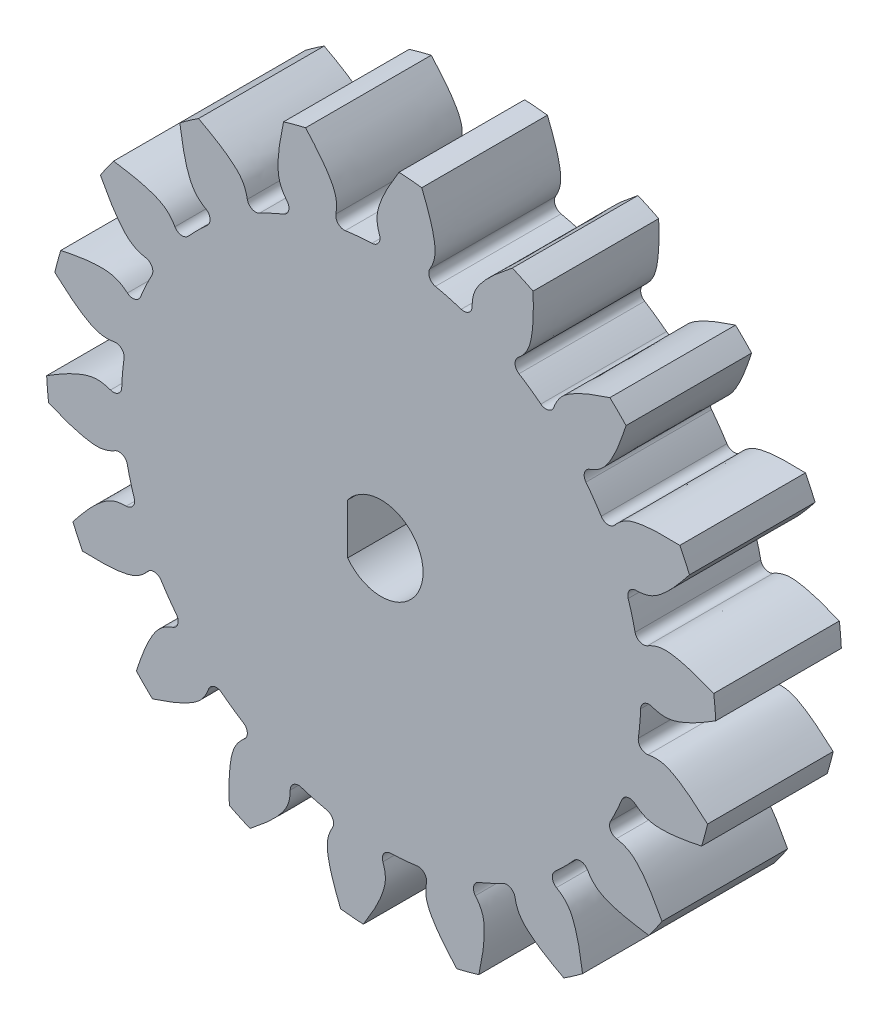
ISO-10303-21;
HEADER;
FILE_DESCRIPTION(('STEP AP214'),'2;1');
FILE_NAME('part.step','',(''),(''),'','','');
FILE_SCHEMA(('AUTOMOTIVE_DESIGN { 1 0 10303 214 1 1 1 1 }'));
ENDSEC;
DATA;
#1=APPLICATION_CONTEXT('core data for automotive mechanical design processes');
#2=APPLICATION_PROTOCOL_DEFINITION('international standard','automotive_design',2000,#1);
#3=PRODUCT_CONTEXT('',#1,'mechanical');
#4=PRODUCT('Part','Part','',(#3));
#5=PRODUCT_RELATED_PRODUCT_CATEGORY('part','',(#4));
#6=PRODUCT_DEFINITION_FORMATION('','',#4);
#7=PRODUCT_DEFINITION_CONTEXT('part definition',#1,'design');
#8=PRODUCT_DEFINITION('design','',#6,#7);
#9=PRODUCT_DEFINITION_SHAPE('','',#8);
#10=(LENGTH_UNIT() NAMED_UNIT(*) SI_UNIT(.MILLI.,.METRE.));
#11=(NAMED_UNIT(*) PLANE_ANGLE_UNIT() SI_UNIT($,.RADIAN.));
#12=(NAMED_UNIT(*) SI_UNIT($,.STERADIAN.) SOLID_ANGLE_UNIT());
#13=UNCERTAINTY_MEASURE_WITH_UNIT(LENGTH_MEASURE(1.E-05),#10,'distance_accuracy_value','');
#14=(GEOMETRIC_REPRESENTATION_CONTEXT(3) GLOBAL_UNCERTAINTY_ASSIGNED_CONTEXT((#13)) GLOBAL_UNIT_ASSIGNED_CONTEXT((#10,
#11,#12)) REPRESENTATION_CONTEXT('',''));
#15=CARTESIAN_POINT('',(0.,0.,0.));
#16=DIRECTION('',(0.,0.,1.));
#17=DIRECTION('',(1.,0.,0.));
#18=AXIS2_PLACEMENT_3D('',#15,#16,#17);
#19=CARTESIAN_POINT('',(0.,0.,15.));
#20=DIRECTION('',(0.,0.,-1.));
#21=DIRECTION('',(-1.,0.,0.));
#22=AXIS2_PLACEMENT_3D('',#19,#20,#21);
#23=CYLINDRICAL_SURFACE('',#22,31.);
#24=CARTESIAN_POINT('',(0.,0.,0.));
#25=DIRECTION('',(0.,0.,1.));
#26=DIRECTION('',(1.,0.,0.));
#27=AXIS2_PLACEMENT_3D('',#24,#25,#26);
#28=CIRCLE('',#27,31.);
#29=CARTESIAN_POINT('',(27.3834941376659,-14.5308034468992,0.));
#30=VERTEX_POINT('',#29);
#31=CARTESIAN_POINT('',(28.7314649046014,-11.6405723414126,0.));
#32=VERTEX_POINT('',#31);
#33=EDGE_CURVE('E1676',#30,#32,#28,.T.);
#34=ORIENTED_EDGE('',*,*,#33,.T.);
#35=DIRECTION('',(0.,0.,-1.));
#36=VECTOR('',#35,1.);
#37=CARTESIAN_POINT('',(28.7314649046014,-11.6405723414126,15.));
#38=LINE('',#37,#36);
#39=CARTESIAN_POINT('',(28.7314649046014,-11.6405723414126,15.));
#40=VERTEX_POINT('',#39);
#41=EDGE_CURVE('E1648',#32,#40,#38,.F.);
#42=ORIENTED_EDGE('',*,*,#41,.T.);
#43=CARTESIAN_POINT('',(0.,0.,15.));
#44=DIRECTION('',(0.,0.,1.));
#45=DIRECTION('',(1.,0.,0.));
#46=AXIS2_PLACEMENT_3D('',#43,#44,#45);
#47=CIRCLE('',#46,31.);
#48=CARTESIAN_POINT('',(27.3834941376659,-14.5308034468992,15.));
#49=VERTEX_POINT('',#48);
#50=EDGE_CURVE('E1663',#49,#40,#47,.T.);
#51=ORIENTED_EDGE('',*,*,#50,.F.);
#52=DIRECTION('',(0.,0.,-1.));
#53=VECTOR('',#52,1.);
#54=CARTESIAN_POINT('',(27.3834941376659,-14.5308034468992,15.));
#55=LINE('',#54,#53);
#56=EDGE_CURVE('E1635',#49,#30,#55,.T.);
#57=ORIENTED_EDGE('',*,*,#56,.T.);
#58=EDGE_LOOP('',(#34,#42,#51,#57));
#59=FACE_BOUND('',#58,.T.);
#60=ADVANCED_FACE('F35',(#59),#23,.T.);
#61=CARTESIAN_POINT('',(30.7018948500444,-4.28878218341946,15.));
#62=VERTEX_POINT('',#61);
#63=CARTESIAN_POINT('',(30.9800557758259,-1.11182018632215,15.));
#64=VERTEX_POINT('',#63);
#65=EDGE_CURVE('E1333',#62,#64,#47,.T.);
#66=ORIENTED_EDGE('',*,*,#65,.F.);
#67=DIRECTION('',(0.,0.,-1.));
#68=VECTOR('',#67,1.);
#69=CARTESIAN_POINT('',(30.7018948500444,-4.28878218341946,15.));
#70=LINE('',#69,#68);
#71=CARTESIAN_POINT('',(30.7018948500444,-4.28878218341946,0.));
#72=VERTEX_POINT('',#71);
#73=EDGE_CURVE('E1653',#62,#72,#70,.T.);
#74=ORIENTED_EDGE('',*,*,#73,.T.);
#75=CARTESIAN_POINT('',(30.9800557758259,-1.11182018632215,0.));
#76=VERTEX_POINT('',#75);
#77=EDGE_CURVE('E1327',#72,#76,#28,.T.);
#78=ORIENTED_EDGE('',*,*,#77,.T.);
#79=DIRECTION('',(0.,0.,-1.));
#80=VECTOR('',#79,1.);
#81=CARTESIAN_POINT('',(30.980055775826,-1.11182018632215,15.));
#82=LINE('',#81,#80);
#83=EDGE_CURVE('E1342',#76,#64,#82,.F.);
#84=ORIENTED_EDGE('',*,*,#83,.T.);
#85=EDGE_LOOP('',(#66,#74,#78,#84));
#86=FACE_BOUND('',#85,.T.);
#87=ADVANCED_FACE('F1685',(#86),#23,.T.);
#88=CARTESIAN_POINT('',(20.7622398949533,-23.0201953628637,0.));
#89=VERTEX_POINT('',#88);
#90=CARTESIAN_POINT('',(23.0174353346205,-20.7652996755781,0.));
#91=VERTEX_POINT('',#90);
#92=EDGE_CURVE('E1681',#89,#91,#28,.T.);
#93=ORIENTED_EDGE('',*,*,#92,.T.);
#94=DIRECTION('',(0.,0.,-1.));
#95=VECTOR('',#94,1.);
#96=CARTESIAN_POINT('',(23.0174353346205,-20.7652996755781,15.));
#97=LINE('',#96,#95);
#98=CARTESIAN_POINT('',(23.0174353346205,-20.7652996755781,15.));
#99=VERTEX_POINT('',#98);
#100=EDGE_CURVE('E1630',#91,#99,#97,.F.);
#101=ORIENTED_EDGE('',*,*,#100,.T.);
#102=CARTESIAN_POINT('',(20.7622398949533,-23.0201953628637,15.));
#103=VERTEX_POINT('',#102);
#104=EDGE_CURVE('E1880',#103,#99,#47,.T.);
#105=ORIENTED_EDGE('',*,*,#104,.F.);
#106=DIRECTION('',(0.,0.,-1.));
#107=VECTOR('',#106,1.);
#108=CARTESIAN_POINT('',(20.7622398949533,-23.0201953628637,15.));
#109=LINE('',#108,#107);
#110=EDGE_CURVE('E1617',#103,#89,#109,.T.);
#111=ORIENTED_EDGE('',*,*,#110,.T.);
#112=EDGE_LOOP('',(#93,#101,#105,#111));
#113=FACE_BOUND('',#112,.T.);
#114=ADVANCED_FACE('F1859',(#113),#23,.T.);
#115=CARTESIAN_POINT('',(11.6367531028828,-28.7330119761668,0.));
#116=VERTEX_POINT('',#115);
#117=CARTESIAN_POINT('',(14.527163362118,-27.385425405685,0.));
#118=VERTEX_POINT('',#117);
#119=EDGE_CURVE('E1683',#116,#118,#28,.T.);
#120=ORIENTED_EDGE('',*,*,#119,.T.);
#121=DIRECTION('',(0.,0.,-1.));
#122=VECTOR('',#121,1.);
#123=CARTESIAN_POINT('',(14.527163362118,-27.385425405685,15.));
#124=LINE('',#123,#122);
#125=CARTESIAN_POINT('',(14.527163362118,-27.385425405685,15.));
#126=VERTEX_POINT('',#125);
#127=EDGE_CURVE('E1612',#118,#126,#124,.F.);
#128=ORIENTED_EDGE('',*,*,#127,.T.);
#129=CARTESIAN_POINT('',(11.6367531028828,-28.7330119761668,15.));
#130=VERTEX_POINT('',#129);
#131=EDGE_CURVE('E2253',#130,#126,#47,.T.);
#132=ORIENTED_EDGE('',*,*,#131,.F.);
#133=DIRECTION('',(0.,0.,-1.));
#134=VECTOR('',#133,1.);
#135=CARTESIAN_POINT('',(11.6367531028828,-28.7330119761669,15.));
#136=LINE('',#135,#134);
#137=EDGE_CURVE('E1599',#130,#116,#136,.T.);
#138=ORIENTED_EDGE('',*,*,#137,.T.);
#139=EDGE_LOOP('',(#120,#128,#132,#138));
#140=FACE_BOUND('',#139,.T.);
#141=ADVANCED_FACE('F1863',(#140),#23,.T.);
#142=CARTESIAN_POINT('',(1.10770214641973,-30.9802032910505,0.));
#143=VERTEX_POINT('',#142);
#144=CARTESIAN_POINT('',(4.28470109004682,-30.7024646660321,0.));
#145=VERTEX_POINT('',#144);
#146=EDGE_CURVE('E3207',#143,#145,#28,.T.);
#147=ORIENTED_EDGE('',*,*,#146,.T.);
#148=DIRECTION('',(0.,0.,-1.));
#149=VECTOR('',#148,1.);
#150=CARTESIAN_POINT('',(4.28470109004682,-30.7024646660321,15.));
#151=LINE('',#150,#149);
#152=CARTESIAN_POINT('',(4.28470109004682,-30.7024646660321,15.));
#153=VERTEX_POINT('',#152);
#154=EDGE_CURVE('E1594',#145,#153,#151,.F.);
#155=ORIENTED_EDGE('',*,*,#154,.T.);
#156=CARTESIAN_POINT('',(1.10770214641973,-30.9802032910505,15.));
#157=VERTEX_POINT('',#156);
#158=EDGE_CURVE('E2249',#157,#153,#47,.T.);
#159=ORIENTED_EDGE('',*,*,#158,.F.);
#160=DIRECTION('',(0.,0.,-1.));
#161=VECTOR('',#160,1.);
#162=CARTESIAN_POINT('',(1.10770214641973,-30.9802032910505,15.));
#163=LINE('',#162,#161);
#164=EDGE_CURVE('E1581',#157,#143,#163,.T.);
#165=ORIENTED_EDGE('',*,*,#164,.T.);
#166=EDGE_LOOP('',(#147,#155,#159,#165));
#167=FACE_BOUND('',#166,.T.);
#168=ADVANCED_FACE('F1868',(#167),#23,.T.);
#169=CARTESIAN_POINT('',(-9.55495403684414,-29.4907248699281,0.));
#170=VERTEX_POINT('',#169);
#171=CARTESIAN_POINT('',(-6.47455936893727,-30.3163335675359,0.));
#172=VERTEX_POINT('',#171);
#173=EDGE_CURVE('E3203',#170,#172,#28,.T.);
#174=ORIENTED_EDGE('',*,*,#173,.T.);
#175=DIRECTION('',(0.,0.,-1.));
#176=VECTOR('',#175,1.);
#177=CARTESIAN_POINT('',(-6.47455936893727,-30.3163335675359,15.));
#178=LINE('',#177,#176);
#179=CARTESIAN_POINT('',(-6.47455936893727,-30.3163335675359,15.));
#180=VERTEX_POINT('',#179);
#181=EDGE_CURVE('E1576',#172,#180,#178,.F.);
#182=ORIENTED_EDGE('',*,*,#181,.T.);
#183=CARTESIAN_POINT('',(-9.55495403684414,-29.4907248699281,15.));
#184=VERTEX_POINT('',#183);
#185=EDGE_CURVE('E2245',#184,#180,#47,.T.);
#186=ORIENTED_EDGE('',*,*,#185,.F.);
#187=DIRECTION('',(0.,0.,-1.));
#188=VECTOR('',#187,1.);
#189=CARTESIAN_POINT('',(-9.55495403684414,-29.4907248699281,15.));
#190=LINE('',#189,#188);
#191=EDGE_CURVE('E1563',#184,#170,#190,.T.);
#192=ORIENTED_EDGE('',*,*,#191,.T.);
#193=EDGE_LOOP('',(#174,#182,#186,#192));
#194=FACE_BOUND('',#193,.T.);
#195=ADVANCED_FACE('F3026',(#194),#23,.T.);
#196=CARTESIAN_POINT('',(-19.0651417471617,-24.4442297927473,0.));
#197=VERTEX_POINT('',#196);
#198=CARTESIAN_POINT('',(-16.4528924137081,-26.2736052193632,0.));
#199=VERTEX_POINT('',#198);
#200=EDGE_CURVE('E3199',#197,#199,#28,.T.);
#201=ORIENTED_EDGE('',*,*,#200,.T.);
#202=DIRECTION('',(0.,0.,-1.));
#203=VECTOR('',#202,1.);
#204=CARTESIAN_POINT('',(-16.4528924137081,-26.2736052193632,15.));
#205=LINE('',#204,#203);
#206=CARTESIAN_POINT('',(-16.4528924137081,-26.2736052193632,15.));
#207=VERTEX_POINT('',#206);
#208=EDGE_CURVE('E1558',#199,#207,#205,.F.);
#209=ORIENTED_EDGE('',*,*,#208,.T.);
#210=CARTESIAN_POINT('',(-19.0651417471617,-24.4442297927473,15.));
#211=VERTEX_POINT('',#210);
#212=EDGE_CURVE('E2241',#211,#207,#47,.T.);
#213=ORIENTED_EDGE('',*,*,#212,.F.);
#214=DIRECTION('',(0.,0.,-1.));
#215=VECTOR('',#214,1.);
#216=CARTESIAN_POINT('',(-19.0651417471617,-24.4442297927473,15.));
#217=LINE('',#216,#215);
#218=EDGE_CURVE('E1545',#211,#197,#217,.T.);
#219=ORIENTED_EDGE('',*,*,#218,.T.);
#220=EDGE_LOOP('',(#201,#209,#213,#219));
#221=FACE_BOUND('',#220,.T.);
#222=ADVANCED_FACE('F3034',(#221),#23,.T.);
#223=CARTESIAN_POINT('',(-26.2757919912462,-16.4493998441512,0.));
#224=VERTEX_POINT('',#223);
#225=CARTESIAN_POINT('',(-24.4467638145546,-19.0618923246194,0.));
#226=VERTEX_POINT('',#225);
#227=EDGE_CURVE('E3195',#224,#226,#28,.T.);
#228=ORIENTED_EDGE('',*,*,#227,.T.);
#229=DIRECTION('',(0.,0.,-1.));
#230=VECTOR('',#229,1.);
#231=CARTESIAN_POINT('',(-24.4467638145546,-19.0618923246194,15.));
#232=LINE('',#231,#230);
#233=CARTESIAN_POINT('',(-24.4467638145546,-19.0618923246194,15.));
#234=VERTEX_POINT('',#233);
#235=EDGE_CURVE('E1540',#226,#234,#232,.F.);
#236=ORIENTED_EDGE('',*,*,#235,.T.);
#237=CARTESIAN_POINT('',(-26.2757919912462,-16.4493998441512,15.));
#238=VERTEX_POINT('',#237);
#239=EDGE_CURVE('E2237',#238,#234,#47,.T.);
#240=ORIENTED_EDGE('',*,*,#239,.F.);
#241=DIRECTION('',(0.,0.,-1.));
#242=VECTOR('',#241,1.);
#243=CARTESIAN_POINT('',(-26.2757919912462,-16.4493998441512,15.));
#244=LINE('',#243,#242);
#245=EDGE_CURVE('E1527',#238,#224,#244,.T.);
#246=ORIENTED_EDGE('',*,*,#245,.T.);
#247=EDGE_LOOP('',(#228,#236,#240,#246));
#248=FACE_BOUND('',#247,.T.);
#249=ADVANCED_FACE('F3042',(#248),#23,.T.);
#250=CARTESIAN_POINT('',(-30.3171939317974,-6.47052950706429,0.));
#251=VERTEX_POINT('',#250);
#252=CARTESIAN_POINT('',(-29.4919947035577,-9.55103389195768,0.));
#253=VERTEX_POINT('',#252);
#254=EDGE_CURVE('E3191',#251,#253,#28,.T.);
#255=ORIENTED_EDGE('',*,*,#254,.T.);
#256=DIRECTION('',(0.,0.,-1.));
#257=VECTOR('',#256,1.);
#258=CARTESIAN_POINT('',(-29.4919947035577,-9.55103389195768,15.));
#259=LINE('',#258,#257);
#260=CARTESIAN_POINT('',(-29.4919947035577,-9.55103389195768,15.));
#261=VERTEX_POINT('',#260);
#262=EDGE_CURVE('E1522',#253,#261,#259,.F.);
#263=ORIENTED_EDGE('',*,*,#262,.T.);
#264=CARTESIAN_POINT('',(-30.3171939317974,-6.47052950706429,15.));
#265=VERTEX_POINT('',#264);
#266=EDGE_CURVE('E2233',#265,#261,#47,.T.);
#267=ORIENTED_EDGE('',*,*,#266,.F.);
#268=DIRECTION('',(0.,0.,-1.));
#269=VECTOR('',#268,1.);
#270=CARTESIAN_POINT('',(-30.3171939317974,-6.47052950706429,15.));
#271=LINE('',#270,#269);
#272=EDGE_CURVE('E1509',#265,#251,#271,.T.);
#273=ORIENTED_EDGE('',*,*,#272,.T.);
#274=EDGE_LOOP('',(#255,#263,#267,#273));
#275=FACE_BOUND('',#274,.T.);
#276=ADVANCED_FACE('F3050',(#275),#23,.T.);
#277=CARTESIAN_POINT('',(-30.7018948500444,4.28878218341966,0.));
#278=VERTEX_POINT('',#277);
#279=CARTESIAN_POINT('',(-30.980055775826,1.11182018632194,0.));
#280=VERTEX_POINT('',#279);
#281=EDGE_CURVE('E3187',#278,#280,#28,.T.);
#282=ORIENTED_EDGE('',*,*,#281,.T.);
#283=DIRECTION('',(0.,0.,-1.));
#284=VECTOR('',#283,1.);
#285=CARTESIAN_POINT('',(-30.980055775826,1.11182018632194,15.));
#286=LINE('',#285,#284);
#287=CARTESIAN_POINT('',(-30.980055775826,1.11182018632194,15.));
#288=VERTEX_POINT('',#287);
#289=EDGE_CURVE('E1504',#280,#288,#286,.F.);
#290=ORIENTED_EDGE('',*,*,#289,.T.);
#291=CARTESIAN_POINT('',(-30.7018948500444,4.28878218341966,15.));
#292=VERTEX_POINT('',#291);
#293=EDGE_CURVE('E2229',#292,#288,#47,.T.);
#294=ORIENTED_EDGE('',*,*,#293,.F.);
#295=DIRECTION('',(0.,0.,-1.));
#296=VECTOR('',#295,1.);
#297=CARTESIAN_POINT('',(-30.7018948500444,4.28878218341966,15.));
#298=LINE('',#297,#296);
#299=EDGE_CURVE('E1491',#292,#278,#298,.T.);
#300=ORIENTED_EDGE('',*,*,#299,.T.);
#301=EDGE_LOOP('',(#282,#290,#294,#300));
#302=FACE_BOUND('',#301,.T.);
#303=ADVANCED_FACE('F3058',(#302),#23,.T.);
#304=CARTESIAN_POINT('',(-27.3834941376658,14.5308034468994,0.));
#305=VERTEX_POINT('',#304);
#306=CARTESIAN_POINT('',(-28.7314649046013,11.6405723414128,0.));
#307=VERTEX_POINT('',#306);
#308=EDGE_CURVE('E3183',#305,#307,#28,.T.);
#309=ORIENTED_EDGE('',*,*,#308,.T.);
#310=DIRECTION('',(0.,0.,-1.));
#311=VECTOR('',#310,1.);
#312=CARTESIAN_POINT('',(-28.7314649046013,11.6405723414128,15.));
#313=LINE('',#312,#311);
#314=CARTESIAN_POINT('',(-28.7314649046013,11.6405723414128,15.));
#315=VERTEX_POINT('',#314);
#316=EDGE_CURVE('E1486',#307,#315,#313,.F.);
#317=ORIENTED_EDGE('',*,*,#316,.T.);
#318=CARTESIAN_POINT('',(-27.3834941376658,14.5308034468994,15.));
#319=VERTEX_POINT('',#318);
#320=EDGE_CURVE('E2225',#319,#315,#47,.T.);
#321=ORIENTED_EDGE('',*,*,#320,.F.);
#322=DIRECTION('',(0.,0.,-1.));
#323=VECTOR('',#322,1.);
#324=CARTESIAN_POINT('',(-27.3834941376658,14.5308034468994,15.));
#325=LINE('',#324,#323);
#326=EDGE_CURVE('E1473',#319,#305,#325,.T.);
#327=ORIENTED_EDGE('',*,*,#326,.T.);
#328=EDGE_LOOP('',(#309,#317,#321,#327));
#329=FACE_BOUND('',#328,.T.);
#330=ADVANCED_FACE('F3066',(#329),#23,.T.);
#331=CARTESIAN_POINT('',(-20.7622398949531,23.0201953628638,0.));
#332=VERTEX_POINT('',#331);
#333=CARTESIAN_POINT('',(-23.0174353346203,20.7652996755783,0.));
#334=VERTEX_POINT('',#333);
#335=EDGE_CURVE('E3179',#332,#334,#28,.T.);
#336=ORIENTED_EDGE('',*,*,#335,.T.);
#337=DIRECTION('',(0.,0.,-1.));
#338=VECTOR('',#337,1.);
#339=CARTESIAN_POINT('',(-23.0174353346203,20.7652996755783,15.));
#340=LINE('',#339,#338);
#341=CARTESIAN_POINT('',(-23.0174353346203,20.7652996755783,15.));
#342=VERTEX_POINT('',#341);
#343=EDGE_CURVE('E1468',#334,#342,#340,.F.);
#344=ORIENTED_EDGE('',*,*,#343,.T.);
#345=CARTESIAN_POINT('',(-20.7622398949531,23.0201953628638,15.));
#346=VERTEX_POINT('',#345);
#347=EDGE_CURVE('E2221',#346,#342,#47,.T.);
#348=ORIENTED_EDGE('',*,*,#347,.F.);
#349=DIRECTION('',(0.,0.,-1.));
#350=VECTOR('',#349,1.);
#351=CARTESIAN_POINT('',(-20.7622398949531,23.0201953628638,15.));
#352=LINE('',#351,#350);
#353=EDGE_CURVE('E1455',#346,#332,#352,.T.);
#354=ORIENTED_EDGE('',*,*,#353,.T.);
#355=EDGE_LOOP('',(#336,#344,#348,#354));
#356=FACE_BOUND('',#355,.T.);
#357=ADVANCED_FACE('F3074',(#356),#23,.T.);
#358=CARTESIAN_POINT('',(-11.6367531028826,28.7330119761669,0.));
#359=VERTEX_POINT('',#358);
#360=CARTESIAN_POINT('',(-14.5271633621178,27.3854254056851,0.));
#361=VERTEX_POINT('',#360);
#362=EDGE_CURVE('E3175',#359,#361,#28,.T.);
#363=ORIENTED_EDGE('',*,*,#362,.T.);
#364=DIRECTION('',(0.,0.,-1.));
#365=VECTOR('',#364,1.);
#366=CARTESIAN_POINT('',(-14.5271633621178,27.3854254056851,15.));
#367=LINE('',#366,#365);
#368=CARTESIAN_POINT('',(-14.5271633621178,27.3854254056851,15.));
#369=VERTEX_POINT('',#368);
#370=EDGE_CURVE('E1450',#361,#369,#367,.F.);
#371=ORIENTED_EDGE('',*,*,#370,.T.);
#372=CARTESIAN_POINT('',(-11.6367531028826,28.7330119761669,15.));
#373=VERTEX_POINT('',#372);
#374=EDGE_CURVE('E2217',#373,#369,#47,.T.);
#375=ORIENTED_EDGE('',*,*,#374,.F.);
#376=DIRECTION('',(0.,0.,-1.));
#377=VECTOR('',#376,1.);
#378=CARTESIAN_POINT('',(-11.6367531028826,28.7330119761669,15.));
#379=LINE('',#378,#377);
#380=EDGE_CURVE('E1437',#373,#359,#379,.T.);
#381=ORIENTED_EDGE('',*,*,#380,.T.);
#382=EDGE_LOOP('',(#363,#371,#375,#381));
#383=FACE_BOUND('',#382,.T.);
#384=ADVANCED_FACE('F3082',(#383),#23,.T.);
#385=CARTESIAN_POINT('',(-1.10770214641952,30.9802032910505,0.));
#386=VERTEX_POINT('',#385);
#387=CARTESIAN_POINT('',(-4.28470109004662,30.7024646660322,0.));
#388=VERTEX_POINT('',#387);
#389=EDGE_CURVE('E3173',#386,#388,#28,.T.);
#390=ORIENTED_EDGE('',*,*,#389,.T.);
#391=DIRECTION('',(0.,0.,-1.));
#392=VECTOR('',#391,1.);
#393=CARTESIAN_POINT('',(-4.28470109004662,30.7024646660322,15.));
#394=LINE('',#393,#392);
#395=CARTESIAN_POINT('',(-4.28470109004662,30.7024646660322,15.));
#396=VERTEX_POINT('',#395);
#397=EDGE_CURVE('E1432',#388,#396,#394,.F.);
#398=ORIENTED_EDGE('',*,*,#397,.T.);
#399=CARTESIAN_POINT('',(-1.10770214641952,30.9802032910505,15.));
#400=VERTEX_POINT('',#399);
#401=EDGE_CURVE('E2213',#400,#396,#47,.T.);
#402=ORIENTED_EDGE('',*,*,#401,.F.);
#403=DIRECTION('',(0.,0.,-1.));
#404=VECTOR('',#403,1.);
#405=CARTESIAN_POINT('',(-1.10770214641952,30.9802032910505,15.));
#406=LINE('',#405,#404);
#407=EDGE_CURVE('E1419',#400,#386,#406,.T.);
#408=ORIENTED_EDGE('',*,*,#407,.T.);
#409=EDGE_LOOP('',(#390,#398,#402,#408));
#410=FACE_BOUND('',#409,.T.);
#411=ADVANCED_FACE('F3090',(#410),#23,.T.);
#412=CARTESIAN_POINT('',(9.55495403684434,29.490724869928,0.));
#413=VERTEX_POINT('',#412);
#414=CARTESIAN_POINT('',(6.47455936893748,30.3163335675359,0.));
#415=VERTEX_POINT('',#414);
#416=EDGE_CURVE('E3156',#413,#415,#28,.T.);
#417=ORIENTED_EDGE('',*,*,#416,.T.);
#418=DIRECTION('',(0.,0.,-1.));
#419=VECTOR('',#418,1.);
#420=CARTESIAN_POINT('',(6.47455936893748,30.3163335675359,15.));
#421=LINE('',#420,#419);
#422=CARTESIAN_POINT('',(6.47455936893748,30.3163335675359,15.));
#423=VERTEX_POINT('',#422);
#424=EDGE_CURVE('E1414',#415,#423,#421,.F.);
#425=ORIENTED_EDGE('',*,*,#424,.T.);
#426=CARTESIAN_POINT('',(9.55495403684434,29.490724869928,15.));
#427=VERTEX_POINT('',#426);
#428=EDGE_CURVE('E2209',#427,#423,#47,.T.);
#429=ORIENTED_EDGE('',*,*,#428,.F.);
#430=DIRECTION('',(0.,0.,-1.));
#431=VECTOR('',#430,1.);
#432=CARTESIAN_POINT('',(9.55495403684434,29.490724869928,15.));
#433=LINE('',#432,#431);
#434=EDGE_CURVE('E1401',#427,#413,#433,.T.);
#435=ORIENTED_EDGE('',*,*,#434,.T.);
#436=EDGE_LOOP('',(#417,#425,#429,#435));
#437=FACE_BOUND('',#436,.T.);
#438=ADVANCED_FACE('F3098',(#437),#23,.T.);
#439=CARTESIAN_POINT('',(19.0651417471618,24.4442297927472,0.));
#440=VERTEX_POINT('',#439);
#441=CARTESIAN_POINT('',(16.4528924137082,26.2736052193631,0.));
#442=VERTEX_POINT('',#441);
#443=EDGE_CURVE('E3152',#440,#442,#28,.T.);
#444=ORIENTED_EDGE('',*,*,#443,.T.);
#445=DIRECTION('',(0.,0.,-1.));
#446=VECTOR('',#445,1.);
#447=CARTESIAN_POINT('',(16.4528924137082,26.2736052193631,15.));
#448=LINE('',#447,#446);
#449=CARTESIAN_POINT('',(16.4528924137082,26.2736052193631,15.));
#450=VERTEX_POINT('',#449);
#451=EDGE_CURVE('E1396',#442,#450,#448,.F.);
#452=ORIENTED_EDGE('',*,*,#451,.T.);
#453=CARTESIAN_POINT('',(19.0651417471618,24.4442297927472,15.));
#454=VERTEX_POINT('',#453);
#455=EDGE_CURVE('E2207',#454,#450,#47,.T.);
#456=ORIENTED_EDGE('',*,*,#455,.F.);
#457=DIRECTION('',(0.,0.,-1.));
#458=VECTOR('',#457,1.);
#459=CARTESIAN_POINT('',(19.0651417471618,24.4442297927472,15.));
#460=LINE('',#459,#458);
#461=EDGE_CURVE('E1383',#454,#440,#460,.T.);
#462=ORIENTED_EDGE('',*,*,#461,.T.);
#463=EDGE_LOOP('',(#444,#452,#456,#462));
#464=FACE_BOUND('',#463,.T.);
#465=ADVANCED_FACE('F3106',(#464),#23,.T.);
#466=CARTESIAN_POINT('',(26.2757919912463,16.4493998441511,0.));
#467=VERTEX_POINT('',#466);
#468=CARTESIAN_POINT('',(24.4467638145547,19.0618923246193,0.));
#469=VERTEX_POINT('',#468);
#470=EDGE_CURVE('E1337',#467,#469,#28,.T.);
#471=ORIENTED_EDGE('',*,*,#470,.T.);
#472=DIRECTION('',(0.,0.,-1.));
#473=VECTOR('',#472,1.);
#474=CARTESIAN_POINT('',(24.4467638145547,19.0618923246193,15.));
#475=LINE('',#474,#473);
#476=CARTESIAN_POINT('',(24.4467638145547,19.0618923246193,15.));
#477=VERTEX_POINT('',#476);
#478=EDGE_CURVE('E1378',#469,#477,#475,.F.);
#479=ORIENTED_EDGE('',*,*,#478,.T.);
#480=CARTESIAN_POINT('',(26.2757919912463,16.4493998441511,15.));
#481=VERTEX_POINT('',#480);
#482=EDGE_CURVE('E1332',#481,#477,#47,.T.);
#483=ORIENTED_EDGE('',*,*,#482,.F.);
#484=DIRECTION('',(0.,0.,-1.));
#485=VECTOR('',#484,1.);
#486=CARTESIAN_POINT('',(26.2757919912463,16.4493998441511,15.));
#487=LINE('',#486,#485);
#488=EDGE_CURVE('E1365',#481,#467,#487,.T.);
#489=ORIENTED_EDGE('',*,*,#488,.T.);
#490=EDGE_LOOP('',(#471,#479,#483,#489));
#491=FACE_BOUND('',#490,.T.);
#492=ADVANCED_FACE('F1716',(#491),#23,.T.);
#493=CARTESIAN_POINT('',(30.3171939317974,6.47052950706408,0.));
#494=VERTEX_POINT('',#493);
#495=CARTESIAN_POINT('',(29.4919947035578,9.55103389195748,0.));
#496=VERTEX_POINT('',#495);
#497=EDGE_CURVE('E1334',#494,#496,#28,.T.);
#498=ORIENTED_EDGE('',*,*,#497,.T.);
#499=DIRECTION('',(0.,0.,-1.));
#500=VECTOR('',#499,1.);
#501=CARTESIAN_POINT('',(29.4919947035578,9.55103389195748,15.));
#502=LINE('',#501,#500);
#503=CARTESIAN_POINT('',(29.4919947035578,9.55103389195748,15.));
#504=VERTEX_POINT('',#503);
#505=EDGE_CURVE('E1360',#496,#504,#502,.F.);
#506=ORIENTED_EDGE('',*,*,#505,.T.);
#507=CARTESIAN_POINT('',(30.3171939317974,6.47052950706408,15.));
#508=VERTEX_POINT('',#507);
#509=EDGE_CURVE('E1328',#508,#504,#47,.T.);
#510=ORIENTED_EDGE('',*,*,#509,.F.);
#511=DIRECTION('',(0.,0.,-1.));
#512=VECTOR('',#511,1.);
#513=CARTESIAN_POINT('',(30.3171939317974,6.47052950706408,15.));
#514=LINE('',#513,#512);
#515=EDGE_CURVE('E1340',#508,#494,#514,.T.);
#516=ORIENTED_EDGE('',*,*,#515,.T.);
#517=EDGE_LOOP('',(#498,#506,#510,#516));
#518=FACE_BOUND('',#517,.T.);
#519=ADVANCED_FACE('F1711',(#518),#23,.T.);
#520=CARTESIAN_POINT('',(0.,0.,15.));
#521=DIRECTION('',(0.,0.,1.));
#522=DIRECTION('',(1.,0.,0.));
#523=AXIS2_PLACEMENT_3D('',#520,#521,#522);
#524=PLANE('',#523);
#525=CARTESIAN_POINT('',(0.,0.,15.));
#526=DIRECTION('',(0.,0.,1.));
#527=DIRECTION('',(1.,0.,0.));
#528=AXIS2_PLACEMENT_3D('',#525,#526,#527);
#529=CIRCLE('',#528,5.);
#530=CARTESIAN_POINT('',(-4.,-3.,15.));
#531=VERTEX_POINT('',#530);
#532=CARTESIAN_POINT('',(-4.,3.,15.));
#533=VERTEX_POINT('',#532);
#534=EDGE_CURVE('E722',#531,#533,#529,.T.);
#535=ORIENTED_EDGE('',*,*,#534,.F.);
#536=DIRECTION('',(0.,-1.,0.));
#537=VECTOR('',#536,1.);
#538=CARTESIAN_POINT('',(-4.,3.,15.));
#539=LINE('',#538,#537);
#540=EDGE_CURVE('E712',#533,#531,#539,.T.);
#541=ORIENTED_EDGE('',*,*,#540,.F.);
#542=EDGE_LOOP('',(#535,#541));
#543=FACE_BOUND('',#542,.T.);
#544=CARTESIAN_POINT('',(33.5277901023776,-21.8148410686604,15.));
#545=CARTESIAN_POINT('',(32.8190487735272,-20.5061722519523,15.));
#546=CARTESIAN_POINT('',(31.7570259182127,-18.545180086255,15.));
#547=CARTESIAN_POINT('',(29.6623314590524,-16.276907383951,15.));
#548=CARTESIAN_POINT('',(27.376956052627,-15.7963544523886,15.));
#549=CARTESIAN_POINT('',(25.893090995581,-15.8604257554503,15.));
#550=CARTESIAN_POINT('',(25.1500165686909,-15.8925107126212,15.));
#551=B_SPLINE_CURVE_WITH_KNOTS('',3,(#544,#545,#546,#547,#548,#549,#550),.UNSPECIFIED.,.F.,.F.,
(4,1,1,1,4),(0.,0.400492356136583,0.600123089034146,0.799753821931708,1.),.UNSPECIFIED.);
#552=CARTESIAN_POINT('',(33.5277901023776,-21.8148410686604,15.));
#553=VERTEX_POINT('',#552);
#554=CARTESIAN_POINT('',(28.0894705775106,-15.9836847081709,15.));
#555=VERTEX_POINT('',#554);
#556=EDGE_CURVE('E761',#553,#555,#551,.T.);
#557=ORIENTED_EDGE('',*,*,#556,.T.);
#558=CARTESIAN_POINT('',(28.2668326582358,-14.9995390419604,15.));
#559=DIRECTION('',(0.,0.,1.));
#560=DIRECTION('',(1.,0.,0.));
#561=AXIS2_PLACEMENT_3D('',#558,#559,#560);
#562=CIRCLE('',#561,1.);
#563=EDGE_CURVE('E1641',#555,#49,#562,.F.);
#564=ORIENTED_EDGE('',*,*,#563,.T.);
#565=ORIENTED_EDGE('',*,*,#50,.T.);
#566=CARTESIAN_POINT('',(29.6582863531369,-12.0160746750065,15.));
#567=DIRECTION('',(0.,0.,1.));
#568=DIRECTION('',(1.,0.,0.));
#569=AXIS2_PLACEMENT_3D('',#566,#567,#568);
#570=CIRCLE('',#569,1.);
#571=CARTESIAN_POINT('',(30.2982816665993,-11.2476958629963,15.));
#572=VERTEX_POINT('',#571);
#573=EDGE_CURVE('E1657',#40,#572,#570,.F.);
#574=ORIENTED_EDGE('',*,*,#573,.T.);
#575=CARTESIAN_POINT('',(28.3392852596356,-9.05428854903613,15.));
#576=CARTESIAN_POINT('',(28.7922673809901,-9.64420061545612,15.));
#577=CARTESIAN_POINT('',(29.6968394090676,-10.8222116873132,15.));
#578=CARTESIAN_POINT('',(31.5337836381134,-12.2642615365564,15.));
#579=CARTESIAN_POINT('',(34.6178054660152,-12.4112829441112,15.));
#580=CARTESIAN_POINT('',(36.8027271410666,-11.9646286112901,15.));
#581=CARTESIAN_POINT('',(38.2608353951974,-11.6665536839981,15.));
#582=B_SPLINE_CURVE_WITH_KNOTS('',3,(#575,#576,#577,#578,#579,#580,#581),.UNSPECIFIED.,.F.,.F.,
(4,1,1,1,4),(0.,0.200246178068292,0.399876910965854,0.599507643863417,1.),.UNSPECIFIED.);
#583=CARTESIAN_POINT('',(38.2608353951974,-11.6665536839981,15.));
#584=VERTEX_POINT('',#583);
#585=EDGE_CURVE('E733',#572,#584,#582,.T.);
#586=ORIENTED_EDGE('',*,*,#585,.T.);
#587=CARTESIAN_POINT('',(0.,0.,15.));
#588=DIRECTION('',(0.,0.,1.));
#589=DIRECTION('',(-0.939692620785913,0.342020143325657,0.));
#590=AXIS2_PLACEMENT_3D('',#587,#588,#589);
#591=CIRCLE('',#590,40.);
#592=CARTESIAN_POINT('',(38.9669320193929,-9.03206559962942,15.));
#593=VERTEX_POINT('',#592);
#594=EDGE_CURVE('E738',#584,#593,#591,.T.);
#595=ORIENTED_EDGE('',*,*,#594,.T.);
#596=CARTESIAN_POINT('',(38.966932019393,-9.03206559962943,15.));
#597=CARTESIAN_POINT('',(37.85334192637,-8.04472298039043,15.));
#598=CARTESIAN_POINT('',(36.1846680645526,-6.56522632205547,15.));
#599=CARTESIAN_POINT('',(33.4405041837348,-5.15017490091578,15.));
#600=CARTESIAN_POINT('',(31.1285949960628,-5.48024728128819,15.));
#601=CARTESIAN_POINT('',(29.7561316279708,-6.04796635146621,15.));
#602=CARTESIAN_POINT('',(29.0688437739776,-6.3322627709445,15.));
#603=B_SPLINE_CURVE_WITH_KNOTS('',3,(#596,#597,#598,#599,#600,#601,#602),.UNSPECIFIED.,.F.,.F.,
(4,1,1,1,4),(0.,0.400492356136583,0.600123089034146,0.799753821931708,1.),.UNSPECIFIED.);
#604=CARTESIAN_POINT('',(31.8622103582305,-5.4125858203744,15.));
#605=VERTEX_POINT('',#604);
#606=EDGE_CURVE('E2481',#593,#605,#603,.T.);
#607=ORIENTED_EDGE('',*,*,#606,.T.);
#608=CARTESIAN_POINT('',(31.6922785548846,-4.42712999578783,15.));
#609=DIRECTION('',(0.,0.,1.));
#610=DIRECTION('',(1.,0.,0.));
#611=AXIS2_PLACEMENT_3D('',#608,#609,#610);
#612=CIRCLE('',#611,1.);
#613=EDGE_CURVE('E43',#605,#62,#612,.F.);
#614=ORIENTED_EDGE('',*,*,#613,.T.);
#615=ORIENTED_EDGE('',*,*,#65,.T.);
#616=CARTESIAN_POINT('',(31.9794124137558,-1.14768535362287,15.));
#617=DIRECTION('',(0.,0.,1.));
#618=DIRECTION('',(1.,0.,0.));
#619=AXIS2_PLACEMENT_3D('',#616,#617,#618);
#620=CIRCLE('',#619,1.);
#621=CARTESIAN_POINT('',(32.3180102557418,-0.206754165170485,15.));
#622=VERTEX_POINT('',#621);
#623=EDGE_CURVE('E1351',#64,#622,#620,.F.);
#624=ORIENTED_EDGE('',*,*,#623,.T.);
#625=CARTESIAN_POINT('',(29.7269663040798,1.18435827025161,15.));
#626=CARTESIAN_POINT('',(30.354392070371,0.784951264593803,15.));
#627=CARTESIAN_POINT('',(31.6073152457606,-0.0126351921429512,15.));
#628=CARTESIAN_POINT('',(33.8266882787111,-0.739446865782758,15.));
#629=CARTESIAN_POINT('',(36.7750051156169,0.177195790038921,15.));
#630=CARTESIAN_POINT('',(38.6753951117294,1.34420079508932,15.));
#631=CARTESIAN_POINT('',(39.943621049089,2.1230019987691,15.));
#632=B_SPLINE_CURVE_WITH_KNOTS('',3,(#625,#626,#627,#628,#629,#630,#631),.UNSPECIFIED.,.F.,.F.,
(4,1,1,1,4),(0.,0.200246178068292,0.399876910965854,0.599507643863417,1.),.UNSPECIFIED.);
#633=CARTESIAN_POINT('',(39.9436210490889,2.1230019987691,15.));
#634=VERTEX_POINT('',#633);
#635=EDGE_CURVE('E1318',#622,#634,#632,.T.);
#636=ORIENTED_EDGE('',*,*,#635,.T.);
#637=CARTESIAN_POINT('',(0.,0.,15.));
#638=DIRECTION('',(0.,0.,1.));
#639=DIRECTION('',(-1.,0.,0.));
#640=AXIS2_PLACEMENT_3D('',#637,#638,#639);
#641=CIRCLE('',#640,40.);
#642=CARTESIAN_POINT('',(39.7060868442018,4.84011027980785,15.));
#643=VERTEX_POINT('',#642);
#644=EDGE_CURVE('E1298',#634,#643,#641,.T.);
#645=ORIENTED_EDGE('',*,*,#644,.T.);
#646=CARTESIAN_POINT('',(39.7060868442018,4.84011027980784,15.));
#647=CARTESIAN_POINT('',(38.3219633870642,5.38703861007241,15.));
#648=CARTESIAN_POINT('',(36.2479052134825,6.20659062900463,15.));
#649=CARTESIAN_POINT('',(33.1852585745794,6.59774468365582,15.));
#650=CARTESIAN_POINT('',(31.1256659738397,5.49685859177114,15.));
#651=CARTESIAN_POINT('',(30.0301436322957,4.49396705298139,15.));
#652=CARTESIAN_POINT('',(29.4815394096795,3.99174951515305,15.));
#653=B_SPLINE_CURVE_WITH_KNOTS('',3,(#646,#647,#648,#649,#650,#651,#652),.UNSPECIFIED.,.F.,.F.,
(4,1,1,1,4),(0.,0.400492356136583,0.600123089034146,0.799753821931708,1.),.UNSPECIFIED.);
#654=CARTESIAN_POINT('',(31.7918973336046,5.81135079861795,15.));
#655=VERTEX_POINT('',#654);
#656=EDGE_CURVE('E1290',#643,#655,#653,.T.);
#657=ORIENTED_EDGE('',*,*,#656,.T.);
#658=CARTESIAN_POINT('',(31.2951679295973,6.67925626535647,15.));
#659=DIRECTION('',(0.,0.,1.));
#660=DIRECTION('',(1.,0.,0.));
#661=AXIS2_PLACEMENT_3D('',#658,#659,#660);
#662=CIRCLE('',#661,1.);
#663=EDGE_CURVE('E1353',#655,#508,#662,.F.);
#664=ORIENTED_EDGE('',*,*,#663,.T.);
#665=ORIENTED_EDGE('',*,*,#509,.T.);
#666=CARTESIAN_POINT('',(30.4433493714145,9.85913175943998,15.));
#667=DIRECTION('',(0.,0.,1.));
#668=DIRECTION('',(1.,0.,0.));
#669=AXIS2_PLACEMENT_3D('',#666,#667,#668);
#670=CIRCLE('',#669,1.);
#671=CARTESIAN_POINT('',(30.4397098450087,10.8591251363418,15.));
#672=VERTEX_POINT('',#671);
#673=EDGE_CURVE('E1369',#504,#672,#670,.F.);
#674=ORIENTED_EDGE('',*,*,#673,.T.);
#675=CARTESIAN_POINT('',(27.5291364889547,11.2801540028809,15.));
#676=CARTESIAN_POINT('',(28.2553290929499,11.1194264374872,15.));
#677=CARTESIAN_POINT('',(29.7054823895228,10.7984652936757,15.));
#678=CARTESIAN_POINT('',(32.0395950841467,10.8745560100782,15.));
#679=CARTESIAN_POINT('',(34.4965964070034,12.7443020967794,15.));
#680=CARTESIAN_POINT('',(35.8832396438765,14.4908997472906,15.));
#681=CARTESIAN_POINT('',(36.8086164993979,15.6564923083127,15.));
#682=B_SPLINE_CURVE_WITH_KNOTS('',3,(#675,#676,#677,#678,#679,#680,#681),.UNSPECIFIED.,.F.,.F.,
(4,1,1,1,4),(0.,0.200246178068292,0.399876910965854,0.599507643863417,1.),.UNSPECIFIED.);
#683=CARTESIAN_POINT('',(36.8086164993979,15.6564923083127,15.));
#684=VERTEX_POINT('',#683);
#685=EDGE_CURVE('E1261',#672,#684,#682,.T.);
#686=ORIENTED_EDGE('',*,*,#685,.T.);
#687=CARTESIAN_POINT('',(0.,0.,15.));
#688=DIRECTION('',(0.,0.,1.));
#689=DIRECTION('',(-0.939692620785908,-0.342020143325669,0.));
#690=AXIS2_PLACEMENT_3D('',#687,#688,#689);
#691=CIRCLE('',#690,40.);
#692=CARTESIAN_POINT('',(35.656101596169,18.1284974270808,15.));
#693=VERTEX_POINT('',#692);
#694=EDGE_CURVE('E1266',#684,#693,#691,.T.);
#695=ORIENTED_EDGE('',*,*,#694,.T.);
#696=CARTESIAN_POINT('',(35.656101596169,18.1284974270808,15.));
#697=CARTESIAN_POINT('',(34.1683904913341,18.1690438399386,15.));
#698=CARTESIAN_POINT('',(31.9391100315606,18.2298011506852,15.));
#699=CARTESIAN_POINT('',(28.9273810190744,17.5498788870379,15.));
#700=CARTESIAN_POINT('',(27.3685222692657,15.8109621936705,15.));
#701=CARTESIAN_POINT('',(26.6820771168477,14.4938617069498,15.));
#702=CARTESIAN_POINT('',(26.3383262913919,13.834297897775,15.));
#703=B_SPLINE_CURVE_WITH_KNOTS('',3,(#696,#697,#698,#699,#700,#701,#702),.UNSPECIFIED.,.F.,.F.,
(4,1,1,1,4),(0.,0.400492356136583,0.600123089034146,0.799753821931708,1.),.UNSPECIFIED.);
#704=CARTESIAN_POINT('',(27.8870122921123,16.334352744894,15.));
#705=VERTEX_POINT('',#704);
#706=EDGE_CURVE('E2161',#693,#705,#703,.T.);
#707=ORIENTED_EDGE('',*,*,#706,.T.);
#708=CARTESIAN_POINT('',(27.1233981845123,16.9800256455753,15.));
#709=DIRECTION('',(0.,0.,1.));
#710=DIRECTION('',(1.,0.,0.));
#711=AXIS2_PLACEMENT_3D('',#708,#709,#710);
#712=CIRCLE('',#711,1.);
#713=EDGE_CURVE('E1371',#705,#481,#712,.F.);
#714=ORIENTED_EDGE('',*,*,#713,.T.);
#715=ORIENTED_EDGE('',*,*,#482,.T.);
#716=CARTESIAN_POINT('',(25.2353690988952,19.6767920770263,15.));
#717=DIRECTION('',(0.,0.,1.));
#718=DIRECTION('',(1.,0.,0.));
#719=AXIS2_PLACEMENT_3D('',#716,#717,#718);
#720=CIRCLE('',#719,1.);
#721=CARTESIAN_POINT('',(24.8899311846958,20.6152336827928,15.));
#722=VERTEX_POINT('',#721);
#723=EDGE_CURVE('E1387',#477,#722,#720,.F.);
#724=ORIENTED_EDGE('',*,*,#723,.T.);
#725=CARTESIAN_POINT('',(22.0108865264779,20.01539668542,15.));
#726=CARTESIAN_POINT('',(22.7482564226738,20.1127346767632,15.));
#727=CARTESIAN_POINT('',(24.2207299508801,20.3071114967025,15.));
#728=CARTESIAN_POINT('',(26.3880538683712,21.1769269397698,15.));
#729=CARTESIAN_POINT('',(28.0573890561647,23.7742574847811,15.));
#730=CARTESIAN_POINT('',(28.7630358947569,25.8897823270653,15.));
#731=CARTESIAN_POINT('',(29.2339495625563,27.3015785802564,15.));
#732=B_SPLINE_CURVE_WITH_KNOTS('',3,(#725,#726,#727,#728,#729,#730,#731),.UNSPECIFIED.,.F.,.F.,
(4,1,1,1,4),(0.,0.200246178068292,0.399876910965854,0.599507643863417,1.),.UNSPECIFIED.);
#733=CARTESIAN_POINT('',(29.2339495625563,27.3015785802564,15.));
#734=VERTEX_POINT('',#733);
#735=EDGE_CURVE('E1251',#722,#734,#732,.T.);
#736=ORIENTED_EDGE('',*,*,#735,.T.);
#737=CARTESIAN_POINT('',(0.,0.,15.));
#738=DIRECTION('',(0.,0.,1.));
#739=DIRECTION('',(-0.766044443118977,-0.642787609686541,0.));
#740=AXIS2_PLACEMENT_3D('',#737,#738,#739);
#741=CIRCLE('',#740,40.);
#742=CARTESIAN_POINT('',(27.3054642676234,29.2303202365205,15.));
#743=VERTEX_POINT('',#742);
#744=EDGE_CURVE('E1231',#734,#743,#741,.T.);
#745=ORIENTED_EDGE('',*,*,#744,.T.);
#746=CARTESIAN_POINT('',(27.3054642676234,29.2303202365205,15.));
#747=CARTESIAN_POINT('',(25.8936054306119,28.7595942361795,15.));
#748=CARTESIAN_POINT('',(23.7779868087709,28.054228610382,15.));
#749=CARTESIAN_POINT('',(21.1804343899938,26.385238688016,15.));
#750=CARTESIAN_POINT('',(20.3103308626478,24.2180304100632,15.));
#751=CARTESIAN_POINT('',(20.1157583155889,22.745582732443,15.));
#752=CARTESIAN_POINT('',(20.0183223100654,22.0082257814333,15.));
#753=B_SPLINE_CURVE_WITH_KNOTS('',3,(#746,#747,#748,#749,#750,#751,#752),.UNSPECIFIED.,.F.,.F.,
(4,1,1,1,4),(0.,0.400492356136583,0.600123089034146,0.799753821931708,1.),.UNSPECIFIED.);
#754=CARTESIAN_POINT('',(20.6185419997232,24.8871906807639,15.));
#755=VERTEX_POINT('',#754);
#756=EDGE_CURVE('E1223',#743,#755,#753,.T.);
#757=ORIENTED_EDGE('',*,*,#756,.T.);
#758=CARTESIAN_POINT('',(19.6801463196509,25.2327533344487,15.));
#759=DIRECTION('',(0.,0.,1.));
#760=DIRECTION('',(1.,0.,0.));
#761=AXIS2_PLACEMENT_3D('',#758,#759,#760);
#762=CIRCLE('',#761,1.);
#763=EDGE_CURVE('E1389',#755,#454,#762,.F.);
#764=ORIENTED_EDGE('',*,*,#763,.T.);
#765=ORIENTED_EDGE('',*,*,#455,.T.);
#766=CARTESIAN_POINT('',(16.9836308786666,27.1211408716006,15.));
#767=DIRECTION('',(0.,0.,1.));
#768=DIRECTION('',(1.,0.,0.));
#769=AXIS2_PLACEMENT_3D('',#766,#767,#768);
#770=CIRCLE('',#769,1.);
#771=CARTESIAN_POINT('',(16.3380594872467,27.8848407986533,15.));
#772=VERTEX_POINT('',#771);
#773=EDGE_CURVE('E1405',#450,#772,#770,.F.);
#774=ORIENTED_EDGE('',*,*,#773,.T.);
#775=CARTESIAN_POINT('',(13.8377988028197,26.3364871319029,15.));
#776=CARTESIAN_POINT('',(14.4974082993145,26.6801502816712,15.));
#777=CARTESIAN_POINT('',(15.8146000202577,27.3664203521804,15.));
#778=CARTESIAN_POINT('',(17.5537239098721,28.9250479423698,15.));
#779=CARTESIAN_POINT('',(18.234046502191,31.9366865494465,15.));
#780=CARTESIAN_POINT('',(18.17358551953,34.1659750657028,15.));
#781=CARTESIAN_POINT('',(18.1332368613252,35.6536915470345,15.));
#782=B_SPLINE_CURVE_WITH_KNOTS('',3,(#775,#776,#777,#778,#779,#780,#781),.UNSPECIFIED.,.F.,.F.,
(4,1,1,1,4),(0.,0.200246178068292,0.399876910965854,0.599507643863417,1.),.UNSPECIFIED.);
#783=CARTESIAN_POINT('',(18.1332368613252,35.6536915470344,15.));
#784=VERTEX_POINT('',#783);
#785=EDGE_CURVE('E1195',#772,#784,#782,.T.);
#786=ORIENTED_EDGE('',*,*,#785,.T.);
#787=CARTESIAN_POINT('',(0.,0.,15.));
#788=DIRECTION('',(0.,0.,1.));
#789=DIRECTION('',(-0.499999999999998,-0.86602540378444,0.));
#790=AXIS2_PLACEMENT_3D('',#787,#788,#789);
#791=CIRCLE('',#790,40.);
#792=CARTESIAN_POINT('',(15.661384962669,36.8065350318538,15.));
#793=VERTEX_POINT('',#792);
#794=EDGE_CURVE('E1200',#784,#793,#791,.T.);
#795=ORIENTED_EDGE('',*,*,#794,.T.);
#796=CARTESIAN_POINT('',(15.661384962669,36.8065350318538,15.));
#797=CARTESIAN_POINT('',(14.4956694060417,35.881313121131,15.));
#798=CARTESIAN_POINT('',(12.7488874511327,34.4949020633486,15.));
#799=CARTESIAN_POINT('',(10.87881478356,32.0381492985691,15.));
#800=CARTESIAN_POINT('',(10.8024138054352,29.7040467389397,15.));
#801=CARTESIAN_POINT('',(11.1231821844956,28.2538507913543,15.));
#802=CARTESIAN_POINT('',(11.2838132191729,27.527636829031,15.));
#803=B_SPLINE_CURVE_WITH_KNOTS('',3,(#796,#797,#798,#799,#800,#801,#802),.UNSPECIFIED.,.F.,.F.,
(4,1,1,1,4),(0.,0.400492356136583,0.600123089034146,0.799753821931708,1.),.UNSPECIFIED.);
#804=CARTESIAN_POINT('',(10.8631712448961,30.4382661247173,15.));
#805=VERTEX_POINT('',#804);
#806=EDGE_CURVE('E2123',#793,#805,#803,.T.);
#807=ORIENTED_EDGE('',*,*,#806,.T.);
#808=CARTESIAN_POINT('',(9.86317836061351,30.4420385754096,15.));
#809=DIRECTION('',(0.,0.,1.));
#810=DIRECTION('',(1.,0.,0.));
#811=AXIS2_PLACEMENT_3D('',#808,#809,#810);
#812=CIRCLE('',#811,1.);
#813=EDGE_CURVE('E1407',#805,#427,#812,.F.);
#814=ORIENTED_EDGE('',*,*,#813,.T.);
#815=ORIENTED_EDGE('',*,*,#428,.T.);
#816=CARTESIAN_POINT('',(6.68341612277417,31.29427981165,15.));
#817=DIRECTION('',(0.,0.,1.));
#818=DIRECTION('',(1.,0.,0.));
#819=AXIS2_PLACEMENT_3D('',#816,#817,#818);
#820=CIRCLE('',#819,1.);
#821=CARTESIAN_POINT('',(5.8155766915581,31.7911245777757,15.));
#822=VERTEX_POINT('',#821);
#823=EDGE_CURVE('E1423',#423,#822,#820,.F.);
#824=ORIENTED_EDGE('',*,*,#823,.T.);
#825=CARTESIAN_POINT('',(3.99566831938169,29.4810085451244,15.));
#826=CARTESIAN_POINT('',(4.49795877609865,30.0295460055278,15.));
#827=CARTESIAN_POINT('',(5.50099592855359,31.1249350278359,15.));
#828=CARTESIAN_POINT('',(6.60215578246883,33.1843812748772,15.));
#829=CARTESIAN_POINT('',(6.21140883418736,36.2470798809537,15.));
#830=CARTESIAN_POINT('',(5.39213251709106,38.3212469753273,15.));
#831=CARTESIAN_POINT('',(4.84538817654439,39.705443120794,15.));
#832=B_SPLINE_CURVE_WITH_KNOTS('',3,(#825,#826,#827,#828,#829,#830,#831),.UNSPECIFIED.,.F.,.F.,
(4,1,1,1,4),(0.,0.200246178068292,0.399876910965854,0.599507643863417,1.),.UNSPECIFIED.);
#833=CARTESIAN_POINT('',(4.8453881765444,39.7054431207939,15.));
#834=VERTEX_POINT('',#833);
#835=EDGE_CURVE('E1185',#822,#834,#832,.T.);
#836=ORIENTED_EDGE('',*,*,#835,.T.);
#837=CARTESIAN_POINT('',(0.,0.,15.));
#838=DIRECTION('',(0.,0.,1.));
#839=DIRECTION('',(-0.173648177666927,-0.984807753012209,0.));
#840=AXIS2_PLACEMENT_3D('',#837,#838,#839);
#841=CIRCLE('',#840,40.);
#842=CARTESIAN_POINT('',(2.12831149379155,39.9433384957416,15.));
#843=VERTEX_POINT('',#842);
#844=EDGE_CURVE('E1165',#834,#843,#841,.T.);
#845=ORIENTED_EDGE('',*,*,#844,.T.);
#846=CARTESIAN_POINT('',(2.12831149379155,39.9433384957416,15.));
#847=CARTESIAN_POINT('',(1.34934171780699,38.6752160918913,15.));
#848=CARTESIAN_POINT('',(0.182084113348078,36.7749812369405,15.));
#849=CARTESIAN_POINT('',(-0.734950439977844,33.8267862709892,15.));
#850=CARTESIAN_POINT('',(-0.00843378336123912,31.6073166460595,15.));
#851=CARTESIAN_POINT('',(0.788986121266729,30.3542874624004,15.));
#852=CARTESIAN_POINT('',(1.18830972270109,29.7268086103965,15.));
#853=B_SPLINE_CURVE_WITH_KNOTS('',3,(#846,#847,#848,#849,#850,#851,#852),.UNSPECIFIED.,.F.,.F.,
(4,1,1,1,4),(0.,0.400492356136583,0.600123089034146,0.799753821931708,1.),.UNSPECIFIED.);
#854=CARTESIAN_POINT('',(-0.202458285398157,32.3180374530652,15.));
#855=VERTEX_POINT('',#854);
#856=EDGE_CURVE('E1157',#843,#855,#853,.T.);
#857=ORIENTED_EDGE('',*,*,#856,.T.);
#858=CARTESIAN_POINT('',(-1.14343447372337,31.979564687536,15.));
#859=DIRECTION('',(0.,0.,1.));
#860=DIRECTION('',(1.,0.,0.));
#861=AXIS2_PLACEMENT_3D('',#858,#859,#860);
#862=CIRCLE('',#861,1.);
#863=EDGE_CURVE('E1425',#855,#400,#862,.F.);
#864=ORIENTED_EDGE('',*,*,#863,.T.);
#865=ORIENTED_EDGE('',*,*,#401,.T.);
#866=CARTESIAN_POINT('',(-4.42291725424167,31.6928667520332,15.));
#867=DIRECTION('',(0.,0.,1.));
#868=DIRECTION('',(1.,0.,0.));
#869=AXIS2_PLACEMENT_3D('',#866,#867,#868);
#870=CIRCLE('',#869,1.);
#871=CARTESIAN_POINT('',(-5.40835048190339,31.8629295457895,15.));
#872=VERTEX_POINT('',#871);
#873=EDGE_CURVE('E1441',#396,#872,#870,.F.);
#874=ORIENTED_EDGE('',*,*,#873,.T.);
#875=CARTESIAN_POINT('',(-6.32839873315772,29.0696852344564,15.));
#876=CARTESIAN_POINT('',(-6.04401095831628,29.7569352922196,15.));
#877=CARTESIAN_POINT('',(-5.47610945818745,31.129323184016,15.));
#878=CARTESIAN_POINT('',(-5.14572976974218,33.4411884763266,15.));
#879=CARTESIAN_POINT('',(-6.56041640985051,36.1855404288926,15.));
#880=CARTESIAN_POINT('',(-8.03969124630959,37.8544109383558,15.));
#881=CARTESIAN_POINT('',(-9.02688583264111,38.9681322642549,15.));
#882=B_SPLINE_CURVE_WITH_KNOTS('',3,(#875,#876,#877,#878,#879,#880,#881),.UNSPECIFIED.,.F.,.F.,
(4,1,1,1,4),(0.,0.200246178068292,0.399876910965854,0.599507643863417,1.),.UNSPECIFIED.);
#883=CARTESIAN_POINT('',(-9.0268858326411,38.9681322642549,15.));
#884=VERTEX_POINT('',#883);
#885=EDGE_CURVE('E1129',#872,#884,#882,.T.);
#886=ORIENTED_EDGE('',*,*,#885,.T.);
#887=CARTESIAN_POINT('',(0.,0.,15.));
#888=DIRECTION('',(0.,0.,1.));
#889=DIRECTION('',(0.173648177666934,-0.984807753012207,0.));
#890=AXIS2_PLACEMENT_3D('',#887,#888,#889);
#891=CIRCLE('',#890,40.);
#892=CARTESIAN_POINT('',(-11.6614677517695,38.2623858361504,15.));
#893=VERTEX_POINT('',#892);
#894=EDGE_CURVE('E1134',#884,#893,#891,.T.);
#895=ORIENTED_EDGE('',*,*,#894,.T.);
#896=CARTESIAN_POINT('',(-11.6614677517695,38.2623858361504,15.));
#897=CARTESIAN_POINT('',(-11.9597364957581,36.8043172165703,15.));
#898=CARTESIAN_POINT('',(-12.4066812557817,34.6194549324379,15.));
#899=CARTESIAN_POINT('',(-12.260069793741,31.5354135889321,15.));
#900=CARTESIAN_POINT('',(-10.8182641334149,29.6982776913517,15.));
#901=CARTESIAN_POINT('',(-9.64037331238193,28.7935490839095,15.));
#902=CARTESIAN_POINT('',(-9.05052146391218,28.3404885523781,15.));
#903=B_SPLINE_CURVE_WITH_KNOTS('',3,(#896,#897,#898,#899,#900,#901,#902),.UNSPECIFIED.,.F.,.F.,
(4,1,1,1,4),(0.,0.400492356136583,0.600123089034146,0.799753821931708,1.),.UNSPECIFIED.);
#904=CARTESIAN_POINT('',(-11.2436683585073,30.2997765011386,15.));
#905=VERTEX_POINT('',#904);
#906=EDGE_CURVE('E2085',#893,#905,#903,.T.);
#907=ORIENTED_EDGE('',*,*,#906,.T.);
#908=CARTESIAN_POINT('',(-12.0121322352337,29.6598833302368,15.));
#909=DIRECTION('',(0.,0.,1.));
#910=DIRECTION('',(1.,0.,0.));
#911=AXIS2_PLACEMENT_3D('',#908,#909,#910);
#912=CIRCLE('',#911,1.);
#913=EDGE_CURVE('E1443',#905,#373,#912,.F.);
#914=ORIENTED_EDGE('',*,*,#913,.T.);
#915=ORIENTED_EDGE('',*,*,#374,.T.);
#916=CARTESIAN_POINT('',(-14.9957815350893,28.2688262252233,15.));
#917=DIRECTION('',(0.,0.,1.));
#918=DIRECTION('',(1.,0.,0.));
#919=AXIS2_PLACEMENT_3D('',#916,#917,#918);
#920=CIRCLE('',#919,1.);
#921=CARTESIAN_POINT('',(-15.9799507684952,28.0915949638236,15.));
#922=VERTEX_POINT('',#921);
#923=EDGE_CURVE('E1459',#369,#922,#920,.F.);
#924=ORIENTED_EDGE('',*,*,#923,.T.);
#925=CARTESIAN_POINT('',(-15.8891675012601,25.1521288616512,15.));
#926=CARTESIAN_POINT('',(-15.8569837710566,25.8951990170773,15.));
#927=CARTESIAN_POINT('',(-15.7927152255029,27.3790555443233,15.));
#928=CARTESIAN_POINT('',(-16.272964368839,29.6644948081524,15.));
#929=CARTESIAN_POINT('',(-18.540958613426,31.7594907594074,15.));
#930=CARTESIAN_POINT('',(-20.5018095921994,32.8217742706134,15.));
#931=CARTESIAN_POINT('',(-21.8103841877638,33.5306895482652,15.));
#932=B_SPLINE_CURVE_WITH_KNOTS('',3,(#925,#926,#927,#928,#929,#930,#931),.UNSPECIFIED.,.F.,.F.,
(4,1,1,1,4),(0.,0.200246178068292,0.399876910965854,0.599507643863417,1.),.UNSPECIFIED.);
#933=CARTESIAN_POINT('',(-21.8103841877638,33.5306895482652,15.));
#934=VERTEX_POINT('',#933);
#935=EDGE_CURVE('E1119',#922,#934,#932,.T.);
#936=ORIENTED_EDGE('',*,*,#935,.T.);
#937=CARTESIAN_POINT('',(0.,0.,15.));
#938=DIRECTION('',(0.,0.,1.));
#939=DIRECTION('',(0.500000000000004,-0.866025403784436,0.));
#940=AXIS2_PLACEMENT_3D('',#937,#938,#939);
#941=CIRCLE('',#940,40.);
#942=CARTESIAN_POINT('',(-24.0447018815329,31.9664247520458,15.));
#943=VERTEX_POINT('',#942);
#944=EDGE_CURVE('E1099',#934,#943,#941,.T.);
#945=ORIENTED_EDGE('',*,*,#944,.T.);
#946=CARTESIAN_POINT('',(-24.0447018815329,31.9664247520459,15.));
#947=CARTESIAN_POINT('',(-23.8262939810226,30.4942745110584,15.));
#948=CARTESIAN_POINT('',(-23.4990177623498,28.2883114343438,15.));
#949=CARTESIAN_POINT('',(-22.3064437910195,25.4404046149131,15.));
#950=CARTESIAN_POINT('',(-20.3232521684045,24.2071881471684,15.));
#951=CARTESIAN_POINT('',(-18.9069614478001,23.7598837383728,15.));
#952=CARTESIAN_POINT('',(-18.1977261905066,23.5358873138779,15.));
#953=B_SPLINE_CURVE_WITH_KNOTS('',3,(#946,#947,#948,#949,#950,#951,#952),.UNSPECIFIED.,.F.,.F.,
(4,1,1,1,4),(0.,0.400492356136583,0.600123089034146,0.799753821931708,1.),.UNSPECIFIED.);
#954=CARTESIAN_POINT('',(-20.9287260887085,24.6269153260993,15.));
#955=VERTEX_POINT('',#954);
#956=EDGE_CURVE('E1091',#943,#955,#953,.T.);
#957=ORIENTED_EDGE('',*,*,#956,.T.);
#958=CARTESIAN_POINT('',(-21.4319895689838,23.762782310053,15.));
#959=DIRECTION('',(0.,0.,1.));
#960=DIRECTION('',(1.,0.,0.));
#961=AXIS2_PLACEMENT_3D('',#958,#959,#960);
#962=CIRCLE('',#961,1.);
#963=EDGE_CURVE('E1461',#955,#346,#962,.F.);
#964=ORIENTED_EDGE('',*,*,#963,.T.);
#965=ORIENTED_EDGE('',*,*,#347,.T.);
#966=CARTESIAN_POINT('',(-23.7599332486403,21.4351480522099,15.));
#967=DIRECTION('',(0.,0.,1.));
#968=DIRECTION('',(1.,0.,0.));
#969=AXIS2_PLACEMENT_3D('',#966,#967,#968);
#970=CIRCLE('',#969,1.);
#971=CARTESIAN_POINT('',(-24.6241331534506,20.9319994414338,15.));
#972=VERTEX_POINT('',#971);
#973=EDGE_CURVE('E1477',#342,#972,#970,.F.);
#974=ORIENTED_EDGE('',*,*,#973,.T.);
#975=CARTESIAN_POINT('',(-23.533468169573,18.2008545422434,15.));
#976=CARTESIAN_POINT('',(-23.7573703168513,18.9101195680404,15.));
#977=CARTESIAN_POINT('',(-24.2044864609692,20.3264697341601,15.));
#978=CARTESIAN_POINT('',(-25.4374393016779,22.3098252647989,15.));
#979=CARTESIAN_POINT('',(-28.2851875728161,23.5027777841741,15.));
#980=CARTESIAN_POINT('',(-30.4911071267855,23.8303472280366,15.));
#981=CARTESIAN_POINT('',(-31.9632283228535,24.0489508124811,15.));
#982=B_SPLINE_CURVE_WITH_KNOTS('',3,(#975,#976,#977,#978,#979,#980,#981),.UNSPECIFIED.,.F.,.F.,
(4,1,1,1,4),(0.,0.200246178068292,0.399876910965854,0.599507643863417,1.),.UNSPECIFIED.);
#983=CARTESIAN_POINT('',(-31.9632283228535,24.0489508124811,15.));
#984=VERTEX_POINT('',#983);
#985=EDGE_CURVE('E1063',#972,#984,#982,.T.);
#986=ORIENTED_EDGE('',*,*,#985,.T.);
#987=CARTESIAN_POINT('',(0.,0.,15.));
#988=DIRECTION('',(0.,0.,1.));
#989=DIRECTION('',(0.766044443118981,-0.642787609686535,0.));
#990=AXIS2_PLACEMENT_3D('',#987,#988,#989);
#991=CIRCLE('',#990,40.);
#992=CARTESIAN_POINT('',(-33.5277901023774,21.8148410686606,15.));
#993=VERTEX_POINT('',#992);
#994=EDGE_CURVE('E1068',#984,#993,#991,.T.);
#995=ORIENTED_EDGE('',*,*,#994,.T.);
#996=CARTESIAN_POINT('',(-33.5277901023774,21.8148410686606,15.));
#997=CARTESIAN_POINT('',(-32.8190487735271,20.5061722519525,15.));
#998=CARTESIAN_POINT('',(-31.7570259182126,18.5451800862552,15.));
#999=CARTESIAN_POINT('',(-29.6623314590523,16.2769073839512,15.));
#1000=CARTESIAN_POINT('',(-27.3769560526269,15.7963544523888,15.));
#1001=CARTESIAN_POINT('',(-25.8930909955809,15.8604257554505,15.));
#1002=CARTESIAN_POINT('',(-25.1500165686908,15.8925107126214,15.));
#1003=B_SPLINE_CURVE_WITH_KNOTS('',3,(#996,#997,#998,#999,#1000,#1001,#1002),.UNSPECIFIED.,.F.,
.F.,(4,1,1,1,4),(0.,0.400492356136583,0.600123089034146,0.799753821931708,1.),.UNSPECIFIED.);
#1004=CARTESIAN_POINT('',(-28.0894705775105,15.9836847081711,15.));
#1005=VERTEX_POINT('',#1004);
#1006=EDGE_CURVE('E2047',#993,#1005,#1003,.T.);
#1007=ORIENTED_EDGE('',*,*,#1006,.T.);
#1008=CARTESIAN_POINT('',(-28.2668326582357,14.9995390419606,15.));
#1009=DIRECTION('',(0.,0.,1.));
#1010=DIRECTION('',(1.,0.,0.));
#1011=AXIS2_PLACEMENT_3D('',#1008,#1009,#1010);
#1012=CIRCLE('',#1011,1.);
#1013=EDGE_CURVE('E1479',#1005,#319,#1012,.F.);
#1014=ORIENTED_EDGE('',*,*,#1013,.T.);
#1015=ORIENTED_EDGE('',*,*,#320,.T.);
#1016=CARTESIAN_POINT('',(-29.6582863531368,12.0160746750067,15.));
#1017=DIRECTION('',(0.,0.,1.));
#1018=DIRECTION('',(1.,0.,0.));
#1019=AXIS2_PLACEMENT_3D('',#1016,#1017,#1018);
#1020=CIRCLE('',#1019,1.);
#1021=CARTESIAN_POINT('',(-30.2982816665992,11.2476958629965,15.));
#1022=VERTEX_POINT('',#1021);
#1023=EDGE_CURVE('E1495',#315,#1022,#1020,.F.);
#1024=ORIENTED_EDGE('',*,*,#1023,.T.);
#1025=CARTESIAN_POINT('',(-28.3392852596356,9.05428854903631,15.));
#1026=CARTESIAN_POINT('',(-28.7922673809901,9.64420061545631,15.));
#1027=CARTESIAN_POINT('',(-29.6968394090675,10.8222116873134,15.));
#1028=CARTESIAN_POINT('',(-31.5337836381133,12.2642615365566,15.));
#1029=CARTESIAN_POINT('',(-34.6178054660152,12.4112829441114,15.));
#1030=CARTESIAN_POINT('',(-36.8027271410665,11.9646286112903,15.));
#1031=CARTESIAN_POINT('',(-38.2608353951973,11.6665536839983,15.));
#1032=B_SPLINE_CURVE_WITH_KNOTS('',3,(#1025,#1026,#1027,#1028,#1029,#1030,#1031),.UNSPECIFIED.,
.F.,.F.,(4,1,1,1,4),(0.,0.200246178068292,0.399876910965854,0.599507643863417,1.),.UNSPECIFIED.);
#1033=CARTESIAN_POINT('',(-38.2608353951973,11.6665536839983,15.));
#1034=VERTEX_POINT('',#1033);
#1035=EDGE_CURVE('E1053',#1022,#1034,#1032,.T.);
#1036=ORIENTED_EDGE('',*,*,#1035,.T.);
#1037=CARTESIAN_POINT('',(0.,0.,15.));
#1038=DIRECTION('',(0.,0.,1.));
#1039=DIRECTION('',(0.939692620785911,-0.342020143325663,0.));
#1040=AXIS2_PLACEMENT_3D('',#1037,#1038,#1039);
#1041=CIRCLE('',#1040,40.);
#1042=CARTESIAN_POINT('',(-38.9669320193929,9.03206559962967,15.));
#1043=VERTEX_POINT('',#1042);
#1044=EDGE_CURVE('E1033',#1034,#1043,#1041,.T.);
#1045=ORIENTED_EDGE('',*,*,#1044,.T.);
#1046=CARTESIAN_POINT('',(-38.9669320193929,9.03206559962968,15.));
#1047=CARTESIAN_POINT('',(-37.8533419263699,8.04472298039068,15.));
#1048=CARTESIAN_POINT('',(-36.1846680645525,6.56522632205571,15.));
#1049=CARTESIAN_POINT('',(-33.4405041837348,5.150174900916,15.));
#1050=CARTESIAN_POINT('',(-31.1285949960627,5.48024728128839,15.));
#1051=CARTESIAN_POINT('',(-29.7561316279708,6.0479663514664,15.));
#1052=CARTESIAN_POINT('',(-29.0688437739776,6.33226277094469,15.));
#1053=B_SPLINE_CURVE_WITH_KNOTS('',3,(#1046,#1047,#1048,#1049,#1050,#1051,#1052),.UNSPECIFIED.,
.F.,.F.,(4,1,1,1,4),(0.,0.400492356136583,0.600123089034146,0.799753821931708,1.),.UNSPECIFIED.);
#1054=CARTESIAN_POINT('',(-31.8622103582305,5.41258582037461,15.));
#1055=VERTEX_POINT('',#1054);
#1056=EDGE_CURVE('E1025',#1043,#1055,#1053,.T.);
#1057=ORIENTED_EDGE('',*,*,#1056,.T.);
#1058=CARTESIAN_POINT('',(-31.6922785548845,4.42712999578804,15.));
#1059=DIRECTION('',(0.,0.,1.));
#1060=DIRECTION('',(1.,0.,0.));
#1061=AXIS2_PLACEMENT_3D('',#1058,#1059,#1060);
#1062=CIRCLE('',#1061,1.);
#1063=EDGE_CURVE('E1497',#1055,#292,#1062,.F.);
#1064=ORIENTED_EDGE('',*,*,#1063,.T.);
#1065=ORIENTED_EDGE('',*,*,#293,.T.);
#1066=CARTESIAN_POINT('',(-31.9794124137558,1.14768535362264,15.));
#1067=DIRECTION('',(0.,0.,1.));
#1068=DIRECTION('',(1.,0.,0.));
#1069=AXIS2_PLACEMENT_3D('',#1066,#1067,#1068);
#1070=CIRCLE('',#1069,1.);
#1071=CARTESIAN_POINT('',(-32.3180102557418,0.206754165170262,15.));
#1072=VERTEX_POINT('',#1071);
#1073=EDGE_CURVE('E1513',#288,#1072,#1070,.F.);
#1074=ORIENTED_EDGE('',*,*,#1073,.T.);
#1075=CARTESIAN_POINT('',(-29.7269663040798,-1.18435827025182,15.));
#1076=CARTESIAN_POINT('',(-30.354392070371,-0.784951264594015,15.));
#1077=CARTESIAN_POINT('',(-31.6073152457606,0.0126351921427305,15.));
#1078=CARTESIAN_POINT('',(-33.8266882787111,0.739446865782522,15.));
#1079=CARTESIAN_POINT('',(-36.7750051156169,-0.177195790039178,15.));
#1080=CARTESIAN_POINT('',(-38.6753951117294,-1.34420079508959,15.));
#1081=CARTESIAN_POINT('',(-39.9436210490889,-2.12300199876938,15.));
#1082=B_SPLINE_CURVE_WITH_KNOTS('',3,(#1075,#1076,#1077,#1078,#1079,#1080,#1081),.UNSPECIFIED.,
.F.,.F.,(4,1,1,1,4),(0.,0.200246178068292,0.399876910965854,0.599507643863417,1.),.UNSPECIFIED.);
#1083=CARTESIAN_POINT('',(-39.9436210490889,-2.12300199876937,15.));
#1084=VERTEX_POINT('',#1083);
#1085=EDGE_CURVE('E997',#1072,#1084,#1082,.T.);
#1086=ORIENTED_EDGE('',*,*,#1085,.T.);
#1087=CARTESIAN_POINT('',(0.,0.,15.));
#1088=DIRECTION('',(0.,0.,1.));
#1089=DIRECTION('',(1.,0.,0.));
#1090=AXIS2_PLACEMENT_3D('',#1087,#1088,#1089);
#1091=CIRCLE('',#1090,40.);
#1092=CARTESIAN_POINT('',(-39.7060868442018,-4.84011027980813,15.));
#1093=VERTEX_POINT('',#1092);
#1094=EDGE_CURVE('E1002',#1084,#1093,#1091,.T.);
#1095=ORIENTED_EDGE('',*,*,#1094,.T.);
#1096=CARTESIAN_POINT('',(-39.7060868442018,-4.84011027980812,15.));
#1097=CARTESIAN_POINT('',(-38.3219633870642,-5.38703861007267,15.));
#1098=CARTESIAN_POINT('',(-36.2479052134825,-6.20659062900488,15.));
#1099=CARTESIAN_POINT('',(-33.1852585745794,-6.59774468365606,15.));
#1100=CARTESIAN_POINT('',(-31.1256659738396,-5.49685859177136,15.));
#1101=CARTESIAN_POINT('',(-30.0301436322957,-4.4939670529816,15.));
#1102=CARTESIAN_POINT('',(-29.4815394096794,-3.99174951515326,15.));
#1103=B_SPLINE_CURVE_WITH_KNOTS('',3,(#1096,#1097,#1098,#1099,#1100,#1101,#1102),.UNSPECIFIED.,
.F.,.F.,(4,1,1,1,4),(0.,0.400492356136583,0.600123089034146,0.799753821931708,1.),.UNSPECIFIED.);
#1104=CARTESIAN_POINT('',(-31.7918973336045,-5.81135079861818,15.));
#1105=VERTEX_POINT('',#1104);
#1106=EDGE_CURVE('E2009',#1093,#1105,#1103,.T.);
#1107=ORIENTED_EDGE('',*,*,#1106,.T.);
#1108=CARTESIAN_POINT('',(-31.2951679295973,-6.67925626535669,15.));
#1109=DIRECTION('',(0.,0.,1.));
#1110=DIRECTION('',(1.,0.,0.));
#1111=AXIS2_PLACEMENT_3D('',#1108,#1109,#1110);
#1112=CIRCLE('',#1111,1.);
#1113=EDGE_CURVE('E1515',#1105,#265,#1112,.F.);
#1114=ORIENTED_EDGE('',*,*,#1113,.T.);
#1115=ORIENTED_EDGE('',*,*,#266,.T.);
#1116=CARTESIAN_POINT('',(-30.4433493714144,-9.85913175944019,15.));
#1117=DIRECTION('',(0.,0.,1.));
#1118=DIRECTION('',(1.,0.,0.));
#1119=AXIS2_PLACEMENT_3D('',#1116,#1117,#1118);
#1120=CIRCLE('',#1119,1.);
#1121=CARTESIAN_POINT('',(-30.4397098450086,-10.859125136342,15.));
#1122=VERTEX_POINT('',#1121);
#1123=EDGE_CURVE('E1531',#261,#1122,#1120,.F.);
#1124=ORIENTED_EDGE('',*,*,#1123,.T.);
#1125=CARTESIAN_POINT('',(-27.5291364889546,-11.2801540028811,15.));
#1126=CARTESIAN_POINT('',(-28.2553290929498,-11.1194264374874,15.));
#1127=CARTESIAN_POINT('',(-29.7054823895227,-10.7984652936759,15.));
#1128=CARTESIAN_POINT('',(-32.0395950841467,-10.8745560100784,15.));
#1129=CARTESIAN_POINT('',(-34.4965964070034,-12.7443020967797,15.));
#1130=CARTESIAN_POINT('',(-35.8832396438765,-14.4908997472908,15.));
#1131=CARTESIAN_POINT('',(-36.8086164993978,-15.6564923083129,15.));
#1132=B_SPLINE_CURVE_WITH_KNOTS('',3,(#1125,#1126,#1127,#1128,#1129,#1130,#1131),.UNSPECIFIED.,
.F.,.F.,(4,1,1,1,4),(0.,0.200246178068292,0.399876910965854,0.599507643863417,1.),.UNSPECIFIED.);
#1133=CARTESIAN_POINT('',(-36.8086164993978,-15.6564923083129,15.));
#1134=VERTEX_POINT('',#1133);
#1135=EDGE_CURVE('E987',#1122,#1134,#1132,.T.);
#1136=ORIENTED_EDGE('',*,*,#1135,.T.);
#1137=CARTESIAN_POINT('',(0.,0.,15.));
#1138=DIRECTION('',(0.,0.,1.));
#1139=DIRECTION('',(0.939692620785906,0.342020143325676,0.));
#1140=AXIS2_PLACEMENT_3D('',#1137,#1138,#1139);
#1141=CIRCLE('',#1140,40.);
#1142=CARTESIAN_POINT('',(-35.6561015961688,-18.1284974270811,15.));
#1143=VERTEX_POINT('',#1142);
#1144=EDGE_CURVE('E967',#1134,#1143,#1141,.T.);
#1145=ORIENTED_EDGE('',*,*,#1144,.T.);
#1146=CARTESIAN_POINT('',(-35.6561015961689,-18.1284974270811,15.));
#1147=CARTESIAN_POINT('',(-34.168390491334,-18.1690438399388,15.));
#1148=CARTESIAN_POINT('',(-31.9391100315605,-18.2298011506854,15.));
#1149=CARTESIAN_POINT('',(-28.9273810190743,-17.5498788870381,15.));
#1150=CARTESIAN_POINT('',(-27.3685222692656,-15.8109621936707,15.));
#1151=CARTESIAN_POINT('',(-26.6820771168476,-14.49386170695,15.));
#1152=CARTESIAN_POINT('',(-26.3383262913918,-13.8342978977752,15.));
#1153=B_SPLINE_CURVE_WITH_KNOTS('',3,(#1146,#1147,#1148,#1149,#1150,#1151,#1152),.UNSPECIFIED.,
.F.,.F.,(4,1,1,1,4),(0.,0.400492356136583,0.600123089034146,0.799753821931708,1.),.UNSPECIFIED.);
#1154=CARTESIAN_POINT('',(-27.8870122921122,-16.3343527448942,15.));
#1155=VERTEX_POINT('',#1154);
#1156=EDGE_CURVE('E959',#1143,#1155,#1153,.T.);
#1157=ORIENTED_EDGE('',*,*,#1156,.T.);
#1158=CARTESIAN_POINT('',(-27.1233981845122,-16.9800256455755,15.));
#1159=DIRECTION('',(0.,0.,1.));
#1160=DIRECTION('',(1.,0.,0.));
#1161=AXIS2_PLACEMENT_3D('',#1158,#1159,#1160);
#1162=CIRCLE('',#1161,1.);
#1163=EDGE_CURVE('E1533',#1155,#238,#1162,.F.);
#1164=ORIENTED_EDGE('',*,*,#1163,.T.);
#1165=ORIENTED_EDGE('',*,*,#239,.T.);
#1166=CARTESIAN_POINT('',(-25.235369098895,-19.6767920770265,15.));
#1167=DIRECTION('',(0.,0.,1.));
#1168=DIRECTION('',(1.,0.,0.));
#1169=AXIS2_PLACEMENT_3D('',#1166,#1167,#1168);
#1170=CIRCLE('',#1169,1.);
#1171=CARTESIAN_POINT('',(-24.8899311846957,-20.615233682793,15.));
#1172=VERTEX_POINT('',#1171);
#1173=EDGE_CURVE('E1549',#234,#1172,#1170,.F.);
#1174=ORIENTED_EDGE('',*,*,#1173,.T.);
#1175=CARTESIAN_POINT('',(-22.0108865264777,-20.0153966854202,15.));
#1176=CARTESIAN_POINT('',(-22.7482564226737,-20.1127346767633,15.));
#1177=CARTESIAN_POINT('',(-24.22072995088,-20.3071114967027,15.));
#1178=CARTESIAN_POINT('',(-26.388053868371,-21.17692693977,15.));
#1179=CARTESIAN_POINT('',(-28.0573890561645,-23.7742574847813,15.));
#1180=CARTESIAN_POINT('',(-28.7630358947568,-25.8897823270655,15.));
#1181=CARTESIAN_POINT('',(-29.2339495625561,-27.3015785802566,15.));
#1182=B_SPLINE_CURVE_WITH_KNOTS('',3,(#1175,#1176,#1177,#1178,#1179,#1180,#1181),.UNSPECIFIED.,
.F.,.F.,(4,1,1,1,4),(0.,0.200246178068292,0.399876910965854,0.599507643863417,1.),.UNSPECIFIED.);
#1183=CARTESIAN_POINT('',(-29.2339495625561,-27.3015785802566,15.));
#1184=VERTEX_POINT('',#1183);
#1185=EDGE_CURVE('E931',#1172,#1184,#1182,.T.);
#1186=ORIENTED_EDGE('',*,*,#1185,.T.);
#1187=CARTESIAN_POINT('',(0.,0.,15.));
#1188=DIRECTION('',(0.,0.,1.));
#1189=DIRECTION('',(0.766044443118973,0.642787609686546,0.));
#1190=AXIS2_PLACEMENT_3D('',#1187,#1188,#1189);
#1191=CIRCLE('',#1190,40.);
#1192=CARTESIAN_POINT('',(-27.3054642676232,-29.2303202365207,15.));
#1193=VERTEX_POINT('',#1192);
#1194=EDGE_CURVE('E936',#1184,#1193,#1191,.T.);
#1195=ORIENTED_EDGE('',*,*,#1194,.T.);
#1196=CARTESIAN_POINT('',(-27.3054642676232,-29.2303202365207,15.));
#1197=CARTESIAN_POINT('',(-25.8936054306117,-28.7595942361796,15.));
#1198=CARTESIAN_POINT('',(-23.7779868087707,-28.0542286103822,15.));
#1199=CARTESIAN_POINT('',(-21.1804343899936,-26.3852386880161,15.));
#1200=CARTESIAN_POINT('',(-20.3103308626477,-24.2180304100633,15.));
#1201=CARTESIAN_POINT('',(-20.1157583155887,-22.7455827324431,15.));
#1202=CARTESIAN_POINT('',(-20.0183223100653,-22.0082257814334,15.));
#1203=B_SPLINE_CURVE_WITH_KNOTS('',3,(#1196,#1197,#1198,#1199,#1200,#1201,#1202),.UNSPECIFIED.,
.F.,.F.,(4,1,1,1,4),(0.,0.400492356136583,0.600123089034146,0.799753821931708,1.),.UNSPECIFIED.);
#1204=CARTESIAN_POINT('',(-20.618541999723,-24.887190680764,15.));
#1205=VERTEX_POINT('',#1204);
#1206=EDGE_CURVE('E1971',#1193,#1205,#1203,.T.);
#1207=ORIENTED_EDGE('',*,*,#1206,.T.);
#1208=CARTESIAN_POINT('',(-19.6801463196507,-25.2327533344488,15.));
#1209=DIRECTION('',(0.,0.,1.));
#1210=DIRECTION('',(1.,0.,0.));
#1211=AXIS2_PLACEMENT_3D('',#1208,#1209,#1210);
#1212=CIRCLE('',#1211,1.);
#1213=EDGE_CURVE('E1551',#1205,#211,#1212,.F.);
#1214=ORIENTED_EDGE('',*,*,#1213,.T.);
#1215=ORIENTED_EDGE('',*,*,#212,.T.);
#1216=CARTESIAN_POINT('',(-16.9836308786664,-27.1211408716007,15.));
#1217=DIRECTION('',(0.,0.,1.));
#1218=DIRECTION('',(1.,0.,0.));
#1219=AXIS2_PLACEMENT_3D('',#1216,#1217,#1218);
#1220=CIRCLE('',#1219,1.);
#1221=CARTESIAN_POINT('',(-16.3380594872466,-27.8848407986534,15.));
#1222=VERTEX_POINT('',#1221);
#1223=EDGE_CURVE('E1567',#207,#1222,#1220,.F.);
#1224=ORIENTED_EDGE('',*,*,#1223,.T.);
#1225=CARTESIAN_POINT('',(-13.8377988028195,-26.336487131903,15.));
#1226=CARTESIAN_POINT('',(-14.4974082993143,-26.6801502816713,15.));
#1227=CARTESIAN_POINT('',(-15.8146000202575,-27.3664203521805,15.));
#1228=CARTESIAN_POINT('',(-17.5537239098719,-28.9250479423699,15.));
#1229=CARTESIAN_POINT('',(-18.2340465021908,-31.9366865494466,15.));
#1230=CARTESIAN_POINT('',(-18.1735855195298,-34.165975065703,15.));
#1231=CARTESIAN_POINT('',(-18.133236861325,-35.6536915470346,15.));
#1232=B_SPLINE_CURVE_WITH_KNOTS('',3,(#1225,#1226,#1227,#1228,#1229,#1230,#1231),.UNSPECIFIED.,
.F.,.F.,(4,1,1,1,4),(0.,0.200246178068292,0.399876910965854,0.599507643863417,1.),.UNSPECIFIED.);
#1233=CARTESIAN_POINT('',(-18.133236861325,-35.6536915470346,15.));
#1234=VERTEX_POINT('',#1233);
#1235=EDGE_CURVE('E921',#1222,#1234,#1232,.T.);
#1236=ORIENTED_EDGE('',*,*,#1235,.T.);
#1237=CARTESIAN_POINT('',(0.,0.,15.));
#1238=DIRECTION('',(0.,0.,1.));
#1239=DIRECTION('',(0.499999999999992,0.866025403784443,0.));
#1240=AXIS2_PLACEMENT_3D('',#1237,#1238,#1239);
#1241=CIRCLE('',#1240,40.);
#1242=CARTESIAN_POINT('',(-15.6613849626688,-36.806535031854,15.));
#1243=VERTEX_POINT('',#1242);
#1244=EDGE_CURVE('E901',#1234,#1243,#1241,.T.);
#1245=ORIENTED_EDGE('',*,*,#1244,.T.);
#1246=CARTESIAN_POINT('',(-15.6613849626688,-36.806535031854,15.));
#1247=CARTESIAN_POINT('',(-14.4956694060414,-35.8813131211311,15.));
#1248=CARTESIAN_POINT('',(-12.7488874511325,-34.4949020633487,15.));
#1249=CARTESIAN_POINT('',(-10.8788147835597,-32.0381492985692,15.));
#1250=CARTESIAN_POINT('',(-10.802413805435,-29.7040467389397,15.));
#1251=CARTESIAN_POINT('',(-11.1231821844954,-28.2538507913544,15.));
#1252=CARTESIAN_POINT('',(-11.2838132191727,-27.5276368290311,15.));
#1253=B_SPLINE_CURVE_WITH_KNOTS('',3,(#1246,#1247,#1248,#1249,#1250,#1251,#1252),.UNSPECIFIED.,
.F.,.F.,(4,1,1,1,4),(0.,0.400492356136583,0.600123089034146,0.799753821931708,1.),.UNSPECIFIED.);
#1254=CARTESIAN_POINT('',(-10.8631712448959,-30.4382661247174,15.));
#1255=VERTEX_POINT('',#1254);
#1256=EDGE_CURVE('E893',#1243,#1255,#1253,.T.);
#1257=ORIENTED_EDGE('',*,*,#1256,.T.);
#1258=CARTESIAN_POINT('',(-9.8631783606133,-30.4420385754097,15.));
#1259=DIRECTION('',(0.,0.,1.));
#1260=DIRECTION('',(1.,0.,0.));
#1261=AXIS2_PLACEMENT_3D('',#1258,#1259,#1260);
#1262=CIRCLE('',#1261,1.);
#1263=EDGE_CURVE('E1569',#1255,#184,#1262,.F.);
#1264=ORIENTED_EDGE('',*,*,#1263,.T.);
#1265=ORIENTED_EDGE('',*,*,#185,.T.);
#1266=CARTESIAN_POINT('',(-6.68341612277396,-31.29427981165,15.));
#1267=DIRECTION('',(0.,0.,1.));
#1268=DIRECTION('',(1.,0.,0.));
#1269=AXIS2_PLACEMENT_3D('',#1266,#1267,#1268);
#1270=CIRCLE('',#1269,1.);
#1271=CARTESIAN_POINT('',(-5.81557669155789,-31.7911245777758,15.));
#1272=VERTEX_POINT('',#1271);
#1273=EDGE_CURVE('E1585',#180,#1272,#1270,.F.);
#1274=ORIENTED_EDGE('',*,*,#1273,.T.);
#1275=CARTESIAN_POINT('',(-3.99566831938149,-29.4810085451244,15.));
#1276=CARTESIAN_POINT('',(-4.49795877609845,-30.0295460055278,15.));
#1277=CARTESIAN_POINT('',(-5.50099592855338,-31.1249350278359,15.));
#1278=CARTESIAN_POINT('',(-6.60215578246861,-33.1843812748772,15.));
#1279=CARTESIAN_POINT('',(-6.21140883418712,-36.2470798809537,15.));
#1280=CARTESIAN_POINT('',(-5.3921325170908,-38.3212469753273,15.));
#1281=CARTESIAN_POINT('',(-4.84538817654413,-39.705443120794,15.));
#1282=B_SPLINE_CURVE_WITH_KNOTS('',3,(#1275,#1276,#1277,#1278,#1279,#1280,#1281),.UNSPECIFIED.,
.F.,.F.,(4,1,1,1,4),(0.,0.200246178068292,0.399876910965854,0.599507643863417,1.),.UNSPECIFIED.);
#1283=CARTESIAN_POINT('',(-4.84538817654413,-39.705443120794,15.));
#1284=VERTEX_POINT('',#1283);
#1285=EDGE_CURVE('E865',#1272,#1284,#1282,.T.);
#1286=ORIENTED_EDGE('',*,*,#1285,.T.);
#1287=CARTESIAN_POINT('',(0.,0.,15.));
#1288=DIRECTION('',(0.,0.,1.));
#1289=DIRECTION('',(0.173648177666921,0.98480775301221,0.));
#1290=AXIS2_PLACEMENT_3D('',#1287,#1288,#1289);
#1291=CIRCLE('',#1290,40.);
#1292=CARTESIAN_POINT('',(-2.12831149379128,-39.9433384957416,15.));
#1293=VERTEX_POINT('',#1292);
#1294=EDGE_CURVE('E870',#1284,#1293,#1291,.T.);
#1295=ORIENTED_EDGE('',*,*,#1294,.T.);
#1296=CARTESIAN_POINT('',(-2.12831149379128,-39.9433384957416,15.));
#1297=CARTESIAN_POINT('',(-1.34934171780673,-38.6752160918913,15.));
#1298=CARTESIAN_POINT('',(-0.182084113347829,-36.7749812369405,15.));
#1299=CARTESIAN_POINT('',(0.734950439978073,-33.8267862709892,15.));
#1300=CARTESIAN_POINT('',(0.00843378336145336,-31.6073166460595,15.));
#1301=CARTESIAN_POINT('',(-0.788986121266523,-30.3542874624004,15.));
#1302=CARTESIAN_POINT('',(-1.18830972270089,-29.7268086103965,15.));
#1303=B_SPLINE_CURVE_WITH_KNOTS('',3,(#1296,#1297,#1298,#1299,#1300,#1301,#1302),.UNSPECIFIED.,
.F.,.F.,(4,1,1,1,4),(0.,0.400492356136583,0.600123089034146,0.799753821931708,1.),.UNSPECIFIED.);
#1304=CARTESIAN_POINT('',(0.20245828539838,-32.3180374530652,15.));
#1305=VERTEX_POINT('',#1304);
#1306=EDGE_CURVE('E1933',#1293,#1305,#1303,.T.);
#1307=ORIENTED_EDGE('',*,*,#1306,.T.);
#1308=CARTESIAN_POINT('',(1.14343447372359,-31.979564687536,15.));
#1309=DIRECTION('',(0.,0.,1.));
#1310=DIRECTION('',(1.,0.,0.));
#1311=AXIS2_PLACEMENT_3D('',#1308,#1309,#1310);
#1312=CIRCLE('',#1311,1.);
#1313=EDGE_CURVE('E1587',#1305,#157,#1312,.F.);
#1314=ORIENTED_EDGE('',*,*,#1313,.T.);
#1315=ORIENTED_EDGE('',*,*,#158,.T.);
#1316=CARTESIAN_POINT('',(4.42291725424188,-31.6928667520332,15.));
#1317=DIRECTION('',(0.,0.,1.));
#1318=DIRECTION('',(1.,0.,0.));
#1319=AXIS2_PLACEMENT_3D('',#1316,#1317,#1318);
#1320=CIRCLE('',#1319,1.);
#1321=CARTESIAN_POINT('',(5.4083504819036,-31.8629295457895,15.));
#1322=VERTEX_POINT('',#1321);
#1323=EDGE_CURVE('E1603',#153,#1322,#1320,.F.);
#1324=ORIENTED_EDGE('',*,*,#1323,.T.);
#1325=CARTESIAN_POINT('',(6.32839873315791,-29.0696852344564,15.));
#1326=CARTESIAN_POINT('',(6.04401095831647,-29.7569352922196,15.));
#1327=CARTESIAN_POINT('',(5.47610945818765,-31.129323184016,15.));
#1328=CARTESIAN_POINT('',(5.1457297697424,-33.4411884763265,15.));
#1329=CARTESIAN_POINT('',(6.56041640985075,-36.1855404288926,15.));
#1330=CARTESIAN_POINT('',(8.03969124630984,-37.8544109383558,15.));
#1331=CARTESIAN_POINT('',(9.02688583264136,-38.9681322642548,15.));
#1332=B_SPLINE_CURVE_WITH_KNOTS('',3,(#1325,#1326,#1327,#1328,#1329,#1330,#1331),.UNSPECIFIED.,
.F.,.F.,(4,1,1,1,4),(0.,0.200246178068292,0.399876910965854,0.599507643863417,1.),.UNSPECIFIED.);
#1333=CARTESIAN_POINT('',(9.02688583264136,-38.9681322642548,15.));
#1334=VERTEX_POINT('',#1333);
#1335=EDGE_CURVE('E855',#1322,#1334,#1332,.T.);
#1336=ORIENTED_EDGE('',*,*,#1335,.T.);
#1337=CARTESIAN_POINT('',(0.,0.,15.));
#1338=DIRECTION('',(0.,0.,1.));
#1339=DIRECTION('',(-0.17364817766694,0.984807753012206,0.));
#1340=AXIS2_PLACEMENT_3D('',#1337,#1338,#1339);
#1341=CIRCLE('',#1340,40.);
#1342=CARTESIAN_POINT('',(11.6614677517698,-38.2623858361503,15.));
#1343=VERTEX_POINT('',#1342);
#1344=EDGE_CURVE('E835',#1334,#1343,#1341,.T.);
#1345=ORIENTED_EDGE('',*,*,#1344,.T.);
#1346=CARTESIAN_POINT('',(11.6614677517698,-38.2623858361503,15.));
#1347=CARTESIAN_POINT('',(11.9597364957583,-36.8043172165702,15.));
#1348=CARTESIAN_POINT('',(12.4066812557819,-34.6194549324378,15.));
#1349=CARTESIAN_POINT('',(12.2600697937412,-31.535413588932,15.));
#1350=CARTESIAN_POINT('',(10.8182641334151,-29.6982776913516,15.));
#1351=CARTESIAN_POINT('',(9.64037331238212,-28.7935490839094,15.));
#1352=CARTESIAN_POINT('',(9.05052146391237,-28.340488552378,15.));
#1353=B_SPLINE_CURVE_WITH_KNOTS('',3,(#1346,#1347,#1348,#1349,#1350,#1351,#1352),.UNSPECIFIED.,
.F.,.F.,(4,1,1,1,4),(0.,0.400492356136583,0.600123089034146,0.799753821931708,1.),.UNSPECIFIED.);
#1354=CARTESIAN_POINT('',(11.2436683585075,-30.2997765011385,15.));
#1355=VERTEX_POINT('',#1354);
#1356=EDGE_CURVE('E827',#1343,#1355,#1353,.T.);
#1357=ORIENTED_EDGE('',*,*,#1356,.T.);
#1358=CARTESIAN_POINT('',(12.0121322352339,-29.6598833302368,15.));
#1359=DIRECTION('',(0.,0.,1.));
#1360=DIRECTION('',(1.,0.,0.));
#1361=AXIS2_PLACEMENT_3D('',#1358,#1359,#1360);
#1362=CIRCLE('',#1361,1.);
#1363=EDGE_CURVE('E1605',#1355,#130,#1362,.F.);
#1364=ORIENTED_EDGE('',*,*,#1363,.T.);
#1365=ORIENTED_EDGE('',*,*,#131,.T.);
#1366=CARTESIAN_POINT('',(14.9957815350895,-28.2688262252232,15.));
#1367=DIRECTION('',(0.,0.,1.));
#1368=DIRECTION('',(1.,0.,0.));
#1369=AXIS2_PLACEMENT_3D('',#1366,#1367,#1368);
#1370=CIRCLE('',#1369,1.);
#1371=CARTESIAN_POINT('',(15.9799507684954,-28.0915949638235,15.));
#1372=VERTEX_POINT('',#1371);
#1373=EDGE_CURVE('E1621',#126,#1372,#1370,.F.);
#1374=ORIENTED_EDGE('',*,*,#1373,.T.);
#1375=CARTESIAN_POINT('',(15.8891675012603,-25.1521288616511,15.));
#1376=CARTESIAN_POINT('',(15.8569837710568,-25.8951990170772,15.));
#1377=CARTESIAN_POINT('',(15.7927152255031,-27.3790555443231,15.));
#1378=CARTESIAN_POINT('',(16.2729643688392,-29.6644948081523,15.));
#1379=CARTESIAN_POINT('',(18.5409586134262,-31.7594907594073,15.));
#1380=CARTESIAN_POINT('',(20.5018095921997,-32.8217742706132,15.));
#1381=CARTESIAN_POINT('',(21.810384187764,-33.5306895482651,15.));
#1382=B_SPLINE_CURVE_WITH_KNOTS('',3,(#1375,#1376,#1377,#1378,#1379,#1380,#1381),.UNSPECIFIED.,
.F.,.F.,(4,1,1,1,4),(0.,0.200246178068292,0.399876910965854,0.599507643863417,1.),.UNSPECIFIED.);
#1383=CARTESIAN_POINT('',(21.810384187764,-33.5306895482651,15.));
#1384=VERTEX_POINT('',#1383);
#1385=EDGE_CURVE('E799',#1372,#1384,#1382,.T.);
#1386=ORIENTED_EDGE('',*,*,#1385,.T.);
#1387=CARTESIAN_POINT('',(0.,0.,15.));
#1388=DIRECTION('',(0.,0.,1.));
#1389=DIRECTION('',(-0.50000000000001,0.866025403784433,0.));
#1390=AXIS2_PLACEMENT_3D('',#1387,#1388,#1389);
#1391=CIRCLE('',#1390,40.);
#1392=CARTESIAN_POINT('',(24.0447018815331,-31.9664247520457,15.));
#1393=VERTEX_POINT('',#1392);
#1394=EDGE_CURVE('E804',#1384,#1393,#1391,.T.);
#1395=ORIENTED_EDGE('',*,*,#1394,.T.);
#1396=CARTESIAN_POINT('',(24.0447018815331,-31.9664247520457,15.));
#1397=CARTESIAN_POINT('',(23.8262939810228,-30.4942745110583,15.));
#1398=CARTESIAN_POINT('',(23.49901776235,-28.2883114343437,15.));
#1399=CARTESIAN_POINT('',(22.3064437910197,-25.440404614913,15.));
#1400=CARTESIAN_POINT('',(20.3232521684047,-24.2071881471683,15.));
#1401=CARTESIAN_POINT('',(18.9069614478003,-23.7598837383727,15.));
#1402=CARTESIAN_POINT('',(18.1977261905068,-23.5358873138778,15.));
#1403=B_SPLINE_CURVE_WITH_KNOTS('',3,(#1396,#1397,#1398,#1399,#1400,#1401,#1402),.UNSPECIFIED.,
.F.,.F.,(4,1,1,1,4),(0.,0.400492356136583,0.600123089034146,0.799753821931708,1.),.UNSPECIFIED.);
#1404=CARTESIAN_POINT('',(20.9287260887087,-24.6269153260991,15.));
#1405=VERTEX_POINT('',#1404);
#1406=EDGE_CURVE('E1895',#1393,#1405,#1403,.T.);
#1407=ORIENTED_EDGE('',*,*,#1406,.T.);
#1408=CARTESIAN_POINT('',(21.431989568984,-23.7627823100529,15.));
#1409=DIRECTION('',(0.,0.,1.));
#1410=DIRECTION('',(1.,0.,0.));
#1411=AXIS2_PLACEMENT_3D('',#1408,#1409,#1410);
#1412=CIRCLE('',#1411,1.);
#1413=EDGE_CURVE('E1623',#1405,#103,#1412,.F.);
#1414=ORIENTED_EDGE('',*,*,#1413,.T.);
#1415=ORIENTED_EDGE('',*,*,#104,.T.);
#1416=CARTESIAN_POINT('',(23.7599332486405,-21.4351480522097,15.));
#1417=DIRECTION('',(0.,0.,1.));
#1418=DIRECTION('',(1.,0.,0.));
#1419=AXIS2_PLACEMENT_3D('',#1416,#1417,#1418);
#1420=CIRCLE('',#1419,1.);
#1421=CARTESIAN_POINT('',(24.6241331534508,-20.9319994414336,15.));
#1422=VERTEX_POINT('',#1421);
#1423=EDGE_CURVE('E1639',#99,#1422,#1420,.F.);
#1424=ORIENTED_EDGE('',*,*,#1423,.T.);
#1425=CARTESIAN_POINT('',(23.5334681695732,-18.2008545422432,15.));
#1426=CARTESIAN_POINT('',(23.7573703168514,-18.9101195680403,15.));
#1427=CARTESIAN_POINT('',(24.2044864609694,-20.3264697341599,15.));
#1428=CARTESIAN_POINT('',(25.4374393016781,-22.3098252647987,15.));
#1429=CARTESIAN_POINT('',(28.2851875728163,-23.5027777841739,15.));
#1430=CARTESIAN_POINT('',(30.4911071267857,-23.8303472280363,15.));
#1431=CARTESIAN_POINT('',(31.9632283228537,-24.0489508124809,15.));
#1432=B_SPLINE_CURVE_WITH_KNOTS('',3,(#1425,#1426,#1427,#1428,#1429,#1430,#1431),.UNSPECIFIED.,
.F.,.F.,(4,1,1,1,4),(0.,0.200246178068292,0.399876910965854,0.599507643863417,1.),.UNSPECIFIED.);
#1433=CARTESIAN_POINT('',(31.9632283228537,-24.0489508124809,15.));
#1434=VERTEX_POINT('',#1433);
#1435=EDGE_CURVE('E789',#1422,#1434,#1432,.T.);
#1436=ORIENTED_EDGE('',*,*,#1435,.T.);
#1437=CARTESIAN_POINT('',(0.,0.,15.));
#1438=DIRECTION('',(0.,0.,1.));
#1439=DIRECTION('',(-0.766044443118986,0.64278760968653,0.));
#1440=AXIS2_PLACEMENT_3D('',#1437,#1438,#1439);
#1441=CIRCLE('',#1440,40.);
#1442=EDGE_CURVE('E769',#1434,#553,#1441,.T.);
#1443=ORIENTED_EDGE('',*,*,#1442,.T.);
#1444=EDGE_LOOP('',(#557,#564,#565,#574,#586,#595,#607,#614,#615,#624,#636,#645,#657,#664,#665,
#674,#686,#695,#707,#714,#715,#724,#736,#745,#757,#764,#765,#774,#786,#795,#807,#814,#815,#824,
#836,#845,#857,#864,#865,#874,#886,#895,#907,#914,#915,#924,#936,#945,#957,#964,#965,#974,#986,
#995,#1007,#1014,#1015,#1024,#1036,#1045,#1057,#1064,#1065,#1074,#1086,#1095,#1107,#1114,#1115,
#1124,#1136,#1145,#1157,#1164,#1165,#1174,#1186,#1195,#1207,#1214,#1215,#1224,#1236,#1245,#1257,
#1264,#1265,#1274,#1286,#1295,#1307,#1314,#1315,#1324,#1336,#1345,#1357,#1364,#1365,#1374,#1386,
#1395,#1407,#1414,#1415,#1424,#1436,#1443));
#1445=FACE_BOUND('',#1444,.T.);
#1446=ADVANCED_FACE('F721',(#543,#1445),#524,.T.);
#1447=CARTESIAN_POINT('',(0.,0.,0.));
#1448=DIRECTION('',(0.,0.,1.));
#1449=DIRECTION('',(1.,0.,0.));
#1450=AXIS2_PLACEMENT_3D('',#1447,#1448,#1449);
#1451=PLANE('',#1450);
#1452=CARTESIAN_POINT('',(0.,0.,0.));
#1453=DIRECTION('',(0.,0.,1.));
#1454=DIRECTION('',(1.,0.,0.));
#1455=AXIS2_PLACEMENT_3D('',#1452,#1453,#1454);
#1456=CIRCLE('',#1455,5.);
#1457=CARTESIAN_POINT('',(-4.,-3.,0.));
#1458=VERTEX_POINT('',#1457);
#1459=CARTESIAN_POINT('',(-4.,3.,0.));
#1460=VERTEX_POINT('',#1459);
#1461=EDGE_CURVE('E726',#1458,#1460,#1456,.T.);
#1462=ORIENTED_EDGE('',*,*,#1461,.T.);
#1463=DIRECTION('',(0.,-1.,0.));
#1464=VECTOR('',#1463,1.);
#1465=CARTESIAN_POINT('',(-4.,3.,0.));
#1466=LINE('',#1465,#1464);
#1467=EDGE_CURVE('E49',#1460,#1458,#1466,.T.);
#1468=ORIENTED_EDGE('',*,*,#1467,.T.);
#1469=EDGE_LOOP('',(#1462,#1468));
#1470=FACE_BOUND('',#1469,.T.);
#1471=ORIENTED_EDGE('',*,*,#77,.F.);
#1472=CARTESIAN_POINT('',(31.6922785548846,-4.42712999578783,0.));
#1473=DIRECTION('',(0.,0.,1.));
#1474=DIRECTION('',(1.,0.,0.));
#1475=AXIS2_PLACEMENT_3D('',#1472,#1473,#1474);
#1476=CIRCLE('',#1475,1.);
#1477=CARTESIAN_POINT('',(31.8622103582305,-5.4125858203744,0.));
#1478=VERTEX_POINT('',#1477);
#1479=EDGE_CURVE('E11',#72,#1478,#1476,.T.);
#1480=ORIENTED_EDGE('',*,*,#1479,.T.);
#1481=CARTESIAN_POINT('',(38.966932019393,-9.03206559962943,0.));
#1482=CARTESIAN_POINT('',(37.85334192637,-8.04472298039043,0.));
#1483=CARTESIAN_POINT('',(36.1846680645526,-6.56522632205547,0.));
#1484=CARTESIAN_POINT('',(33.4405041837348,-5.15017490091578,0.));
#1485=CARTESIAN_POINT('',(31.1285949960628,-5.48024728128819,0.));
#1486=CARTESIAN_POINT('',(29.7561316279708,-6.04796635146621,0.));
#1487=CARTESIAN_POINT('',(29.0688437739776,-6.3322627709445,0.));
#1488=B_SPLINE_CURVE_WITH_KNOTS('',3,(#1481,#1482,#1483,#1484,#1485,#1486,#1487),.UNSPECIFIED.,
.F.,.F.,(4,1,1,1,4),(0.,0.400492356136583,0.600123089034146,0.799753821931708,1.),.UNSPECIFIED.);
#1489=CARTESIAN_POINT('',(38.9669320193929,-9.03206559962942,0.));
#1490=VERTEX_POINT('',#1489);
#1491=EDGE_CURVE('E739',#1490,#1478,#1488,.T.);
#1492=ORIENTED_EDGE('',*,*,#1491,.F.);
#1493=CARTESIAN_POINT('',(0.,0.,0.));
#1494=DIRECTION('',(0.,0.,1.));
#1495=DIRECTION('',(-0.939692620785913,0.342020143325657,0.));
#1496=AXIS2_PLACEMENT_3D('',#1493,#1494,#1495);
#1497=CIRCLE('',#1496,40.);
#1498=CARTESIAN_POINT('',(38.2608353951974,-11.6665536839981,0.));
#1499=VERTEX_POINT('',#1498);
#1500=EDGE_CURVE('E728',#1499,#1490,#1497,.T.);
#1501=ORIENTED_EDGE('',*,*,#1500,.F.);
#1502=CARTESIAN_POINT('',(28.3392852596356,-9.05428854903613,0.));
#1503=CARTESIAN_POINT('',(28.7922673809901,-9.64420061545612,0.));
#1504=CARTESIAN_POINT('',(29.6968394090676,-10.8222116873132,0.));
#1505=CARTESIAN_POINT('',(31.5337836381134,-12.2642615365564,0.));
#1506=CARTESIAN_POINT('',(34.6178054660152,-12.4112829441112,0.));
#1507=CARTESIAN_POINT('',(36.8027271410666,-11.9646286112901,0.));
#1508=CARTESIAN_POINT('',(38.2608353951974,-11.6665536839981,0.));
#1509=B_SPLINE_CURVE_WITH_KNOTS('',3,(#1502,#1503,#1504,#1505,#1506,#1507,#1508),.UNSPECIFIED.,
.F.,.F.,(4,1,1,1,4),(0.,0.200246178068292,0.399876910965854,0.599507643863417,1.),.UNSPECIFIED.);
#1510=CARTESIAN_POINT('',(30.2982816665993,-11.2476958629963,0.));
#1511=VERTEX_POINT('',#1510);
#1512=EDGE_CURVE('E725',#1511,#1499,#1509,.T.);
#1513=ORIENTED_EDGE('',*,*,#1512,.F.);
#1514=CARTESIAN_POINT('',(29.6582863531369,-12.0160746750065,0.));
#1515=DIRECTION('',(0.,0.,1.));
#1516=DIRECTION('',(1.,0.,0.));
#1517=AXIS2_PLACEMENT_3D('',#1514,#1515,#1516);
#1518=CIRCLE('',#1517,1.);
#1519=EDGE_CURVE('E1655',#1511,#32,#1518,.T.);
#1520=ORIENTED_EDGE('',*,*,#1519,.T.);
#1521=ORIENTED_EDGE('',*,*,#33,.F.);
#1522=CARTESIAN_POINT('',(28.2668326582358,-14.9995390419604,0.));
#1523=DIRECTION('',(0.,0.,1.));
#1524=DIRECTION('',(1.,0.,0.));
#1525=AXIS2_PLACEMENT_3D('',#1522,#1523,#1524);
#1526=CIRCLE('',#1525,1.);
#1527=CARTESIAN_POINT('',(28.0894705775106,-15.9836847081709,0.));
#1528=VERTEX_POINT('',#1527);
#1529=EDGE_CURVE('E1643',#30,#1528,#1526,.T.);
#1530=ORIENTED_EDGE('',*,*,#1529,.T.);
#1531=CARTESIAN_POINT('',(33.5277901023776,-21.8148410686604,0.));
#1532=CARTESIAN_POINT('',(32.8190487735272,-20.5061722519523,0.));
#1533=CARTESIAN_POINT('',(31.7570259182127,-18.545180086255,0.));
#1534=CARTESIAN_POINT('',(29.6623314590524,-16.276907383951,0.));
#1535=CARTESIAN_POINT('',(27.376956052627,-15.7963544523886,0.));
#1536=CARTESIAN_POINT('',(25.893090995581,-15.8604257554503,0.));
#1537=CARTESIAN_POINT('',(25.1500165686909,-15.8925107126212,0.));
#1538=B_SPLINE_CURVE_WITH_KNOTS('',3,(#1531,#1532,#1533,#1534,#1535,#1536,#1537),.UNSPECIFIED.,
.F.,.F.,(4,1,1,1,4),(0.,0.400492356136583,0.600123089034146,0.799753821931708,1.),.UNSPECIFIED.);
#1539=CARTESIAN_POINT('',(33.5277901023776,-21.8148410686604,0.));
#1540=VERTEX_POINT('',#1539);
#1541=EDGE_CURVE('E784',#1540,#1528,#1538,.T.);
#1542=ORIENTED_EDGE('',*,*,#1541,.F.);
#1543=CARTESIAN_POINT('',(0.,0.,0.));
#1544=DIRECTION('',(0.,0.,1.));
#1545=DIRECTION('',(-0.766044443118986,0.64278760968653,0.));
#1546=AXIS2_PLACEMENT_3D('',#1543,#1544,#1545);
#1547=CIRCLE('',#1546,40.);
#1548=CARTESIAN_POINT('',(31.9632283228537,-24.0489508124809,0.));
#1549=VERTEX_POINT('',#1548);
#1550=EDGE_CURVE('E778',#1549,#1540,#1547,.T.);
#1551=ORIENTED_EDGE('',*,*,#1550,.F.);
#1552=CARTESIAN_POINT('',(23.5334681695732,-18.2008545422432,0.));
#1553=CARTESIAN_POINT('',(23.7573703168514,-18.9101195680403,0.));
#1554=CARTESIAN_POINT('',(24.2044864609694,-20.3264697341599,0.));
#1555=CARTESIAN_POINT('',(25.4374393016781,-22.3098252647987,0.));
#1556=CARTESIAN_POINT('',(28.2851875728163,-23.5027777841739,0.));
#1557=CARTESIAN_POINT('',(30.4911071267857,-23.8303472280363,0.));
#1558=CARTESIAN_POINT('',(31.9632283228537,-24.0489508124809,0.));
#1559=B_SPLINE_CURVE_WITH_KNOTS('',3,(#1552,#1553,#1554,#1555,#1556,#1557,#1558),.UNSPECIFIED.,
.F.,.F.,(4,1,1,1,4),(0.,0.200246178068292,0.399876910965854,0.599507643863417,1.),.UNSPECIFIED.);
#1560=CARTESIAN_POINT('',(24.6241331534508,-20.9319994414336,0.));
#1561=VERTEX_POINT('',#1560);
#1562=EDGE_CURVE('E771',#1561,#1549,#1559,.T.);
#1563=ORIENTED_EDGE('',*,*,#1562,.F.);
#1564=CARTESIAN_POINT('',(23.7599332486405,-21.4351480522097,0.));
#1565=DIRECTION('',(0.,0.,1.));
#1566=DIRECTION('',(1.,0.,0.));
#1567=AXIS2_PLACEMENT_3D('',#1564,#1565,#1566);
#1568=CIRCLE('',#1567,1.);
#1569=EDGE_CURVE('E1637',#1561,#91,#1568,.T.);
#1570=ORIENTED_EDGE('',*,*,#1569,.T.);
#1571=ORIENTED_EDGE('',*,*,#92,.F.);
#1572=CARTESIAN_POINT('',(21.431989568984,-23.7627823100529,0.));
#1573=DIRECTION('',(0.,0.,1.));
#1574=DIRECTION('',(1.,0.,0.));
#1575=AXIS2_PLACEMENT_3D('',#1572,#1573,#1574);
#1576=CIRCLE('',#1575,1.);
#1577=CARTESIAN_POINT('',(20.9287260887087,-24.6269153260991,0.));
#1578=VERTEX_POINT('',#1577);
#1579=EDGE_CURVE('E1625',#89,#1578,#1576,.T.);
#1580=ORIENTED_EDGE('',*,*,#1579,.T.);
#1581=CARTESIAN_POINT('',(24.0447018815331,-31.9664247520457,0.));
#1582=CARTESIAN_POINT('',(23.8262939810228,-30.4942745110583,0.));
#1583=CARTESIAN_POINT('',(23.49901776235,-28.2883114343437,0.));
#1584=CARTESIAN_POINT('',(22.3064437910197,-25.440404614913,0.));
#1585=CARTESIAN_POINT('',(20.3232521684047,-24.2071881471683,0.));
#1586=CARTESIAN_POINT('',(18.9069614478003,-23.7598837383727,0.));
#1587=CARTESIAN_POINT('',(18.1977261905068,-23.5358873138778,0.));
#1588=B_SPLINE_CURVE_WITH_KNOTS('',3,(#1581,#1582,#1583,#1584,#1585,#1586,#1587),.UNSPECIFIED.,
.F.,.F.,(4,1,1,1,4),(0.,0.400492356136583,0.600123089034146,0.799753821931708,1.),.UNSPECIFIED.);
#1589=CARTESIAN_POINT('',(24.0447018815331,-31.9664247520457,0.));
#1590=VERTEX_POINT('',#1589);
#1591=EDGE_CURVE('E805',#1590,#1578,#1588,.T.);
#1592=ORIENTED_EDGE('',*,*,#1591,.F.);
#1593=CARTESIAN_POINT('',(0.,0.,0.));
#1594=DIRECTION('',(0.,0.,1.));
#1595=DIRECTION('',(-0.50000000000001,0.866025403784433,0.));
#1596=AXIS2_PLACEMENT_3D('',#1593,#1594,#1595);
#1597=CIRCLE('',#1596,40.);
#1598=CARTESIAN_POINT('',(21.810384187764,-33.5306895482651,0.));
#1599=VERTEX_POINT('',#1598);
#1600=EDGE_CURVE('E1908',#1599,#1590,#1597,.T.);
#1601=ORIENTED_EDGE('',*,*,#1600,.F.);
#1602=CARTESIAN_POINT('',(15.8891675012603,-25.1521288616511,0.));
#1603=CARTESIAN_POINT('',(15.8569837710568,-25.8951990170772,0.));
#1604=CARTESIAN_POINT('',(15.7927152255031,-27.3790555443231,0.));
#1605=CARTESIAN_POINT('',(16.2729643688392,-29.6644948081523,0.));
#1606=CARTESIAN_POINT('',(18.5409586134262,-31.7594907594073,0.));
#1607=CARTESIAN_POINT('',(20.5018095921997,-32.8217742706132,0.));
#1608=CARTESIAN_POINT('',(21.810384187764,-33.5306895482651,0.));
#1609=B_SPLINE_CURVE_WITH_KNOTS('',3,(#1602,#1603,#1604,#1605,#1606,#1607,#1608),.UNSPECIFIED.,
.F.,.F.,(4,1,1,1,4),(0.,0.200246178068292,0.399876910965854,0.599507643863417,1.),.UNSPECIFIED.);
#1610=CARTESIAN_POINT('',(15.9799507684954,-28.0915949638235,0.));
#1611=VERTEX_POINT('',#1610);
#1612=EDGE_CURVE('E798',#1611,#1599,#1609,.T.);
#1613=ORIENTED_EDGE('',*,*,#1612,.F.);
#1614=CARTESIAN_POINT('',(14.9957815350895,-28.2688262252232,0.));
#1615=DIRECTION('',(0.,0.,1.));
#1616=DIRECTION('',(1.,0.,0.));
#1617=AXIS2_PLACEMENT_3D('',#1614,#1615,#1616);
#1618=CIRCLE('',#1617,1.);
#1619=EDGE_CURVE('E1619',#1611,#118,#1618,.T.);
#1620=ORIENTED_EDGE('',*,*,#1619,.T.);
#1621=ORIENTED_EDGE('',*,*,#119,.F.);
#1622=CARTESIAN_POINT('',(12.0121322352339,-29.6598833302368,0.));
#1623=DIRECTION('',(0.,0.,1.));
#1624=DIRECTION('',(1.,0.,0.));
#1625=AXIS2_PLACEMENT_3D('',#1622,#1623,#1624);
#1626=CIRCLE('',#1625,1.);
#1627=CARTESIAN_POINT('',(11.2436683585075,-30.2997765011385,0.));
#1628=VERTEX_POINT('',#1627);
#1629=EDGE_CURVE('E1607',#116,#1628,#1626,.T.);
#1630=ORIENTED_EDGE('',*,*,#1629,.T.);
#1631=CARTESIAN_POINT('',(11.6614677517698,-38.2623858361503,0.));
#1632=CARTESIAN_POINT('',(11.9597364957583,-36.8043172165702,0.));
#1633=CARTESIAN_POINT('',(12.4066812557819,-34.6194549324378,0.));
#1634=CARTESIAN_POINT('',(12.2600697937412,-31.535413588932,0.));
#1635=CARTESIAN_POINT('',(10.8182641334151,-29.6982776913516,0.));
#1636=CARTESIAN_POINT('',(9.64037331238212,-28.7935490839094,0.));
#1637=CARTESIAN_POINT('',(9.05052146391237,-28.340488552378,0.));
#1638=B_SPLINE_CURVE_WITH_KNOTS('',3,(#1631,#1632,#1633,#1634,#1635,#1636,#1637),.UNSPECIFIED.,
.F.,.F.,(4,1,1,1,4),(0.,0.400492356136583,0.600123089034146,0.799753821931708,1.),.UNSPECIFIED.);
#1639=CARTESIAN_POINT('',(11.6614677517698,-38.2623858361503,0.));
#1640=VERTEX_POINT('',#1639);
#1641=EDGE_CURVE('E850',#1640,#1628,#1638,.T.);
#1642=ORIENTED_EDGE('',*,*,#1641,.F.);
#1643=CARTESIAN_POINT('',(0.,0.,0.));
#1644=DIRECTION('',(0.,0.,1.));
#1645=DIRECTION('',(-0.17364817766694,0.984807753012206,0.));
#1646=AXIS2_PLACEMENT_3D('',#1643,#1644,#1645);
#1647=CIRCLE('',#1646,40.);
#1648=CARTESIAN_POINT('',(9.02688583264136,-38.9681322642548,0.));
#1649=VERTEX_POINT('',#1648);
#1650=EDGE_CURVE('E844',#1649,#1640,#1647,.T.);
#1651=ORIENTED_EDGE('',*,*,#1650,.F.);
#1652=CARTESIAN_POINT('',(6.32839873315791,-29.0696852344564,0.));
#1653=CARTESIAN_POINT('',(6.04401095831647,-29.7569352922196,0.));
#1654=CARTESIAN_POINT('',(5.47610945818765,-31.129323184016,0.));
#1655=CARTESIAN_POINT('',(5.1457297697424,-33.4411884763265,0.));
#1656=CARTESIAN_POINT('',(6.56041640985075,-36.1855404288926,0.));
#1657=CARTESIAN_POINT('',(8.03969124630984,-37.8544109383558,0.));
#1658=CARTESIAN_POINT('',(9.02688583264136,-38.9681322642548,0.));
#1659=B_SPLINE_CURVE_WITH_KNOTS('',3,(#1652,#1653,#1654,#1655,#1656,#1657,#1658),.UNSPECIFIED.,
.F.,.F.,(4,1,1,1,4),(0.,0.200246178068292,0.399876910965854,0.599507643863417,1.),.UNSPECIFIED.);
#1660=CARTESIAN_POINT('',(5.4083504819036,-31.8629295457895,0.));
#1661=VERTEX_POINT('',#1660);
#1662=EDGE_CURVE('E837',#1661,#1649,#1659,.T.);
#1663=ORIENTED_EDGE('',*,*,#1662,.F.);
#1664=CARTESIAN_POINT('',(4.42291725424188,-31.6928667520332,0.));
#1665=DIRECTION('',(0.,0.,1.));
#1666=DIRECTION('',(1.,0.,0.));
#1667=AXIS2_PLACEMENT_3D('',#1664,#1665,#1666);
#1668=CIRCLE('',#1667,1.);
#1669=EDGE_CURVE('E1601',#1661,#145,#1668,.T.);
#1670=ORIENTED_EDGE('',*,*,#1669,.T.);
#1671=ORIENTED_EDGE('',*,*,#146,.F.);
#1672=CARTESIAN_POINT('',(1.14343447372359,-31.979564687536,0.));
#1673=DIRECTION('',(0.,0.,1.));
#1674=DIRECTION('',(1.,0.,0.));
#1675=AXIS2_PLACEMENT_3D('',#1672,#1673,#1674);
#1676=CIRCLE('',#1675,1.);
#1677=CARTESIAN_POINT('',(0.20245828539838,-32.3180374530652,0.));
#1678=VERTEX_POINT('',#1677);
#1679=EDGE_CURVE('E1589',#143,#1678,#1676,.T.);
#1680=ORIENTED_EDGE('',*,*,#1679,.T.);
#1681=CARTESIAN_POINT('',(-2.12831149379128,-39.9433384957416,0.));
#1682=CARTESIAN_POINT('',(-1.34934171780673,-38.6752160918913,0.));
#1683=CARTESIAN_POINT('',(-0.182084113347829,-36.7749812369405,0.));
#1684=CARTESIAN_POINT('',(0.734950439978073,-33.8267862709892,0.));
#1685=CARTESIAN_POINT('',(0.00843378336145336,-31.6073166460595,0.));
#1686=CARTESIAN_POINT('',(-0.788986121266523,-30.3542874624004,0.));
#1687=CARTESIAN_POINT('',(-1.18830972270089,-29.7268086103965,0.));
#1688=B_SPLINE_CURVE_WITH_KNOTS('',3,(#1681,#1682,#1683,#1684,#1685,#1686,#1687),.UNSPECIFIED.,
.F.,.F.,(4,1,1,1,4),(0.,0.400492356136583,0.600123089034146,0.799753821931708,1.),.UNSPECIFIED.);
#1689=CARTESIAN_POINT('',(-2.12831149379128,-39.9433384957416,0.));
#1690=VERTEX_POINT('',#1689);
#1691=EDGE_CURVE('E871',#1690,#1678,#1688,.T.);
#1692=ORIENTED_EDGE('',*,*,#1691,.F.);
#1693=CARTESIAN_POINT('',(0.,0.,0.));
#1694=DIRECTION('',(0.,0.,1.));
#1695=DIRECTION('',(0.173648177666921,0.98480775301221,0.));
#1696=AXIS2_PLACEMENT_3D('',#1693,#1694,#1695);
#1697=CIRCLE('',#1696,40.);
#1698=CARTESIAN_POINT('',(-4.84538817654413,-39.705443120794,0.));
#1699=VERTEX_POINT('',#1698);
#1700=EDGE_CURVE('E1946',#1699,#1690,#1697,.T.);
#1701=ORIENTED_EDGE('',*,*,#1700,.F.);
#1702=CARTESIAN_POINT('',(-3.99566831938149,-29.4810085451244,0.));
#1703=CARTESIAN_POINT('',(-4.49795877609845,-30.0295460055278,0.));
#1704=CARTESIAN_POINT('',(-5.50099592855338,-31.1249350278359,0.));
#1705=CARTESIAN_POINT('',(-6.60215578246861,-33.1843812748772,0.));
#1706=CARTESIAN_POINT('',(-6.21140883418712,-36.2470798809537,0.));
#1707=CARTESIAN_POINT('',(-5.3921325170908,-38.3212469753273,0.));
#1708=CARTESIAN_POINT('',(-4.84538817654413,-39.705443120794,0.));
#1709=B_SPLINE_CURVE_WITH_KNOTS('',3,(#1702,#1703,#1704,#1705,#1706,#1707,#1708),.UNSPECIFIED.,
.F.,.F.,(4,1,1,1,4),(0.,0.200246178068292,0.399876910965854,0.599507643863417,1.),.UNSPECIFIED.);
#1710=CARTESIAN_POINT('',(-5.81557669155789,-31.7911245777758,0.));
#1711=VERTEX_POINT('',#1710);
#1712=EDGE_CURVE('E864',#1711,#1699,#1709,.T.);
#1713=ORIENTED_EDGE('',*,*,#1712,.F.);
#1714=CARTESIAN_POINT('',(-6.68341612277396,-31.29427981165,0.));
#1715=DIRECTION('',(0.,0.,1.));
#1716=DIRECTION('',(1.,0.,0.));
#1717=AXIS2_PLACEMENT_3D('',#1714,#1715,#1716);
#1718=CIRCLE('',#1717,1.);
#1719=EDGE_CURVE('E1583',#1711,#172,#1718,.T.);
#1720=ORIENTED_EDGE('',*,*,#1719,.T.);
#1721=ORIENTED_EDGE('',*,*,#173,.F.);
#1722=CARTESIAN_POINT('',(-9.8631783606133,-30.4420385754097,0.));
#1723=DIRECTION('',(0.,0.,1.));
#1724=DIRECTION('',(1.,0.,0.));
#1725=AXIS2_PLACEMENT_3D('',#1722,#1723,#1724);
#1726=CIRCLE('',#1725,1.);
#1727=CARTESIAN_POINT('',(-10.8631712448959,-30.4382661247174,0.));
#1728=VERTEX_POINT('',#1727);
#1729=EDGE_CURVE('E1571',#170,#1728,#1726,.T.);
#1730=ORIENTED_EDGE('',*,*,#1729,.T.);
#1731=CARTESIAN_POINT('',(-15.6613849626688,-36.806535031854,0.));
#1732=CARTESIAN_POINT('',(-14.4956694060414,-35.8813131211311,0.));
#1733=CARTESIAN_POINT('',(-12.7488874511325,-34.4949020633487,0.));
#1734=CARTESIAN_POINT('',(-10.8788147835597,-32.0381492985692,0.));
#1735=CARTESIAN_POINT('',(-10.802413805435,-29.7040467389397,0.));
#1736=CARTESIAN_POINT('',(-11.1231821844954,-28.2538507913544,0.));
#1737=CARTESIAN_POINT('',(-11.2838132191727,-27.5276368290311,0.));
#1738=B_SPLINE_CURVE_WITH_KNOTS('',3,(#1731,#1732,#1733,#1734,#1735,#1736,#1737),.UNSPECIFIED.,
.F.,.F.,(4,1,1,1,4),(0.,0.400492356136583,0.600123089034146,0.799753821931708,1.),.UNSPECIFIED.);
#1739=CARTESIAN_POINT('',(-15.6613849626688,-36.806535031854,0.));
#1740=VERTEX_POINT('',#1739);
#1741=EDGE_CURVE('E916',#1740,#1728,#1738,.T.);
#1742=ORIENTED_EDGE('',*,*,#1741,.F.);
#1743=CARTESIAN_POINT('',(0.,0.,0.));
#1744=DIRECTION('',(0.,0.,1.));
#1745=DIRECTION('',(0.499999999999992,0.866025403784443,0.));
#1746=AXIS2_PLACEMENT_3D('',#1743,#1744,#1745);
#1747=CIRCLE('',#1746,40.);
#1748=CARTESIAN_POINT('',(-18.133236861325,-35.6536915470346,0.));
#1749=VERTEX_POINT('',#1748);
#1750=EDGE_CURVE('E910',#1749,#1740,#1747,.T.);
#1751=ORIENTED_EDGE('',*,*,#1750,.F.);
#1752=CARTESIAN_POINT('',(-13.8377988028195,-26.336487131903,0.));
#1753=CARTESIAN_POINT('',(-14.4974082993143,-26.6801502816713,0.));
#1754=CARTESIAN_POINT('',(-15.8146000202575,-27.3664203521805,0.));
#1755=CARTESIAN_POINT('',(-17.5537239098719,-28.9250479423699,0.));
#1756=CARTESIAN_POINT('',(-18.2340465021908,-31.9366865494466,0.));
#1757=CARTESIAN_POINT('',(-18.1735855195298,-34.165975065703,0.));
#1758=CARTESIAN_POINT('',(-18.133236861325,-35.6536915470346,0.));
#1759=B_SPLINE_CURVE_WITH_KNOTS('',3,(#1752,#1753,#1754,#1755,#1756,#1757,#1758),.UNSPECIFIED.,
.F.,.F.,(4,1,1,1,4),(0.,0.200246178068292,0.399876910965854,0.599507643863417,1.),.UNSPECIFIED.);
#1760=CARTESIAN_POINT('',(-16.3380594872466,-27.8848407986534,0.));
#1761=VERTEX_POINT('',#1760);
#1762=EDGE_CURVE('E903',#1761,#1749,#1759,.T.);
#1763=ORIENTED_EDGE('',*,*,#1762,.F.);
#1764=CARTESIAN_POINT('',(-16.9836308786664,-27.1211408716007,0.));
#1765=DIRECTION('',(0.,0.,1.));
#1766=DIRECTION('',(1.,0.,0.));
#1767=AXIS2_PLACEMENT_3D('',#1764,#1765,#1766);
#1768=CIRCLE('',#1767,1.);
#1769=EDGE_CURVE('E1565',#1761,#199,#1768,.T.);
#1770=ORIENTED_EDGE('',*,*,#1769,.T.);
#1771=ORIENTED_EDGE('',*,*,#200,.F.);
#1772=CARTESIAN_POINT('',(-19.6801463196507,-25.2327533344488,0.));
#1773=DIRECTION('',(0.,0.,1.));
#1774=DIRECTION('',(1.,0.,0.));
#1775=AXIS2_PLACEMENT_3D('',#1772,#1773,#1774);
#1776=CIRCLE('',#1775,1.);
#1777=CARTESIAN_POINT('',(-20.618541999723,-24.887190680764,0.));
#1778=VERTEX_POINT('',#1777);
#1779=EDGE_CURVE('E1553',#197,#1778,#1776,.T.);
#1780=ORIENTED_EDGE('',*,*,#1779,.T.);
#1781=CARTESIAN_POINT('',(-27.3054642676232,-29.2303202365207,0.));
#1782=CARTESIAN_POINT('',(-25.8936054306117,-28.7595942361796,0.));
#1783=CARTESIAN_POINT('',(-23.7779868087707,-28.0542286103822,0.));
#1784=CARTESIAN_POINT('',(-21.1804343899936,-26.3852386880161,0.));
#1785=CARTESIAN_POINT('',(-20.3103308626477,-24.2180304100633,0.));
#1786=CARTESIAN_POINT('',(-20.1157583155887,-22.7455827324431,0.));
#1787=CARTESIAN_POINT('',(-20.0183223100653,-22.0082257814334,0.));
#1788=B_SPLINE_CURVE_WITH_KNOTS('',3,(#1781,#1782,#1783,#1784,#1785,#1786,#1787),.UNSPECIFIED.,
.F.,.F.,(4,1,1,1,4),(0.,0.400492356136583,0.600123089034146,0.799753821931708,1.),.UNSPECIFIED.);
#1789=CARTESIAN_POINT('',(-27.3054642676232,-29.2303202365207,0.));
#1790=VERTEX_POINT('',#1789);
#1791=EDGE_CURVE('E937',#1790,#1778,#1788,.T.);
#1792=ORIENTED_EDGE('',*,*,#1791,.F.);
#1793=CARTESIAN_POINT('',(0.,0.,0.));
#1794=DIRECTION('',(0.,0.,1.));
#1795=DIRECTION('',(0.766044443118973,0.642787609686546,0.));
#1796=AXIS2_PLACEMENT_3D('',#1793,#1794,#1795);
#1797=CIRCLE('',#1796,40.);
#1798=CARTESIAN_POINT('',(-29.2339495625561,-27.3015785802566,0.));
#1799=VERTEX_POINT('',#1798);
#1800=EDGE_CURVE('E1984',#1799,#1790,#1797,.T.);
#1801=ORIENTED_EDGE('',*,*,#1800,.F.);
#1802=CARTESIAN_POINT('',(-22.0108865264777,-20.0153966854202,0.));
#1803=CARTESIAN_POINT('',(-22.7482564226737,-20.1127346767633,0.));
#1804=CARTESIAN_POINT('',(-24.22072995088,-20.3071114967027,0.));
#1805=CARTESIAN_POINT('',(-26.388053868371,-21.17692693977,0.));
#1806=CARTESIAN_POINT('',(-28.0573890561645,-23.7742574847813,0.));
#1807=CARTESIAN_POINT('',(-28.7630358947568,-25.8897823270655,0.));
#1808=CARTESIAN_POINT('',(-29.2339495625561,-27.3015785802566,0.));
#1809=B_SPLINE_CURVE_WITH_KNOTS('',3,(#1802,#1803,#1804,#1805,#1806,#1807,#1808),.UNSPECIFIED.,
.F.,.F.,(4,1,1,1,4),(0.,0.200246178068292,0.399876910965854,0.599507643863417,1.),.UNSPECIFIED.);
#1810=CARTESIAN_POINT('',(-24.8899311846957,-20.615233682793,0.));
#1811=VERTEX_POINT('',#1810);
#1812=EDGE_CURVE('E930',#1811,#1799,#1809,.T.);
#1813=ORIENTED_EDGE('',*,*,#1812,.F.);
#1814=CARTESIAN_POINT('',(-25.235369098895,-19.6767920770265,0.));
#1815=DIRECTION('',(0.,0.,1.));
#1816=DIRECTION('',(1.,0.,0.));
#1817=AXIS2_PLACEMENT_3D('',#1814,#1815,#1816);
#1818=CIRCLE('',#1817,1.);
#1819=EDGE_CURVE('E1547',#1811,#226,#1818,.T.);
#1820=ORIENTED_EDGE('',*,*,#1819,.T.);
#1821=ORIENTED_EDGE('',*,*,#227,.F.);
#1822=CARTESIAN_POINT('',(-27.1233981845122,-16.9800256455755,0.));
#1823=DIRECTION('',(0.,0.,1.));
#1824=DIRECTION('',(1.,0.,0.));
#1825=AXIS2_PLACEMENT_3D('',#1822,#1823,#1824);
#1826=CIRCLE('',#1825,1.);
#1827=CARTESIAN_POINT('',(-27.8870122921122,-16.3343527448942,0.));
#1828=VERTEX_POINT('',#1827);
#1829=EDGE_CURVE('E1535',#224,#1828,#1826,.T.);
#1830=ORIENTED_EDGE('',*,*,#1829,.T.);
#1831=CARTESIAN_POINT('',(-35.6561015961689,-18.1284974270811,0.));
#1832=CARTESIAN_POINT('',(-34.168390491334,-18.1690438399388,0.));
#1833=CARTESIAN_POINT('',(-31.9391100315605,-18.2298011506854,0.));
#1834=CARTESIAN_POINT('',(-28.9273810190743,-17.5498788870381,0.));
#1835=CARTESIAN_POINT('',(-27.3685222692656,-15.8109621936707,0.));
#1836=CARTESIAN_POINT('',(-26.6820771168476,-14.49386170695,0.));
#1837=CARTESIAN_POINT('',(-26.3383262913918,-13.8342978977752,0.));
#1838=B_SPLINE_CURVE_WITH_KNOTS('',3,(#1831,#1832,#1833,#1834,#1835,#1836,#1837),.UNSPECIFIED.,
.F.,.F.,(4,1,1,1,4),(0.,0.400492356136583,0.600123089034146,0.799753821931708,1.),.UNSPECIFIED.);
#1839=CARTESIAN_POINT('',(-35.6561015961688,-18.1284974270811,0.));
#1840=VERTEX_POINT('',#1839);
#1841=EDGE_CURVE('E982',#1840,#1828,#1838,.T.);
#1842=ORIENTED_EDGE('',*,*,#1841,.F.);
#1843=CARTESIAN_POINT('',(0.,0.,0.));
#1844=DIRECTION('',(0.,0.,1.));
#1845=DIRECTION('',(0.939692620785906,0.342020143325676,0.));
#1846=AXIS2_PLACEMENT_3D('',#1843,#1844,#1845);
#1847=CIRCLE('',#1846,40.);
#1848=CARTESIAN_POINT('',(-36.8086164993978,-15.6564923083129,0.));
#1849=VERTEX_POINT('',#1848);
#1850=EDGE_CURVE('E976',#1849,#1840,#1847,.T.);
#1851=ORIENTED_EDGE('',*,*,#1850,.F.);
#1852=CARTESIAN_POINT('',(-27.5291364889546,-11.2801540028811,0.));
#1853=CARTESIAN_POINT('',(-28.2553290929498,-11.1194264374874,0.));
#1854=CARTESIAN_POINT('',(-29.7054823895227,-10.7984652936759,0.));
#1855=CARTESIAN_POINT('',(-32.0395950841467,-10.8745560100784,0.));
#1856=CARTESIAN_POINT('',(-34.4965964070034,-12.7443020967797,0.));
#1857=CARTESIAN_POINT('',(-35.8832396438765,-14.4908997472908,0.));
#1858=CARTESIAN_POINT('',(-36.8086164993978,-15.6564923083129,0.));
#1859=B_SPLINE_CURVE_WITH_KNOTS('',3,(#1852,#1853,#1854,#1855,#1856,#1857,#1858),.UNSPECIFIED.,
.F.,.F.,(4,1,1,1,4),(0.,0.200246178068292,0.399876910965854,0.599507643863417,1.),.UNSPECIFIED.);
#1860=CARTESIAN_POINT('',(-30.4397098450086,-10.859125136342,0.));
#1861=VERTEX_POINT('',#1860);
#1862=EDGE_CURVE('E969',#1861,#1849,#1859,.T.);
#1863=ORIENTED_EDGE('',*,*,#1862,.F.);
#1864=CARTESIAN_POINT('',(-30.4433493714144,-9.85913175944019,0.));
#1865=DIRECTION('',(0.,0.,1.));
#1866=DIRECTION('',(1.,0.,0.));
#1867=AXIS2_PLACEMENT_3D('',#1864,#1865,#1866);
#1868=CIRCLE('',#1867,1.);
#1869=EDGE_CURVE('E1529',#1861,#253,#1868,.T.);
#1870=ORIENTED_EDGE('',*,*,#1869,.T.);
#1871=ORIENTED_EDGE('',*,*,#254,.F.);
#1872=CARTESIAN_POINT('',(-31.2951679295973,-6.67925626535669,0.));
#1873=DIRECTION('',(0.,0.,1.));
#1874=DIRECTION('',(1.,0.,0.));
#1875=AXIS2_PLACEMENT_3D('',#1872,#1873,#1874);
#1876=CIRCLE('',#1875,1.);
#1877=CARTESIAN_POINT('',(-31.7918973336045,-5.81135079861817,0.));
#1878=VERTEX_POINT('',#1877);
#1879=EDGE_CURVE('E1517',#251,#1878,#1876,.T.);
#1880=ORIENTED_EDGE('',*,*,#1879,.T.);
#1881=CARTESIAN_POINT('',(-39.7060868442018,-4.84011027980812,0.));
#1882=CARTESIAN_POINT('',(-38.3219633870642,-5.38703861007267,0.));
#1883=CARTESIAN_POINT('',(-36.2479052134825,-6.20659062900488,0.));
#1884=CARTESIAN_POINT('',(-33.1852585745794,-6.59774468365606,0.));
#1885=CARTESIAN_POINT('',(-31.1256659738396,-5.49685859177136,0.));
#1886=CARTESIAN_POINT('',(-30.0301436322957,-4.4939670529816,0.));
#1887=CARTESIAN_POINT('',(-29.4815394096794,-3.99174951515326,0.));
#1888=B_SPLINE_CURVE_WITH_KNOTS('',3,(#1881,#1882,#1883,#1884,#1885,#1886,#1887),.UNSPECIFIED.,
.F.,.F.,(4,1,1,1,4),(0.,0.400492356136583,0.600123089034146,0.799753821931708,1.),.UNSPECIFIED.);
#1889=CARTESIAN_POINT('',(-39.7060868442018,-4.84011027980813,0.));
#1890=VERTEX_POINT('',#1889);
#1891=EDGE_CURVE('E1003',#1890,#1878,#1888,.T.);
#1892=ORIENTED_EDGE('',*,*,#1891,.F.);
#1893=CARTESIAN_POINT('',(0.,0.,0.));
#1894=DIRECTION('',(0.,0.,1.));
#1895=DIRECTION('',(1.,0.,0.));
#1896=AXIS2_PLACEMENT_3D('',#1893,#1894,#1895);
#1897=CIRCLE('',#1896,40.);
#1898=CARTESIAN_POINT('',(-39.9436210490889,-2.12300199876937,0.));
#1899=VERTEX_POINT('',#1898);
#1900=EDGE_CURVE('E2022',#1899,#1890,#1897,.T.);
#1901=ORIENTED_EDGE('',*,*,#1900,.F.);
#1902=CARTESIAN_POINT('',(-29.7269663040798,-1.18435827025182,0.));
#1903=CARTESIAN_POINT('',(-30.354392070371,-0.784951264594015,0.));
#1904=CARTESIAN_POINT('',(-31.6073152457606,0.0126351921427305,0.));
#1905=CARTESIAN_POINT('',(-33.8266882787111,0.739446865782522,0.));
#1906=CARTESIAN_POINT('',(-36.7750051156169,-0.177195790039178,0.));
#1907=CARTESIAN_POINT('',(-38.6753951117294,-1.34420079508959,0.));
#1908=CARTESIAN_POINT('',(-39.9436210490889,-2.12300199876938,0.));
#1909=B_SPLINE_CURVE_WITH_KNOTS('',3,(#1902,#1903,#1904,#1905,#1906,#1907,#1908),.UNSPECIFIED.,
.F.,.F.,(4,1,1,1,4),(0.,0.200246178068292,0.399876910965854,0.599507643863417,1.),.UNSPECIFIED.);
#1910=CARTESIAN_POINT('',(-32.3180102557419,0.206754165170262,0.));
#1911=VERTEX_POINT('',#1910);
#1912=EDGE_CURVE('E996',#1911,#1899,#1909,.T.);
#1913=ORIENTED_EDGE('',*,*,#1912,.F.);
#1914=CARTESIAN_POINT('',(-31.9794124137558,1.14768535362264,0.));
#1915=DIRECTION('',(0.,0.,1.));
#1916=DIRECTION('',(1.,0.,0.));
#1917=AXIS2_PLACEMENT_3D('',#1914,#1915,#1916);
#1918=CIRCLE('',#1917,1.);
#1919=EDGE_CURVE('E1511',#1911,#280,#1918,.T.);
#1920=ORIENTED_EDGE('',*,*,#1919,.T.);
#1921=ORIENTED_EDGE('',*,*,#281,.F.);
#1922=CARTESIAN_POINT('',(-31.6922785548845,4.42712999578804,0.));
#1923=DIRECTION('',(0.,0.,1.));
#1924=DIRECTION('',(1.,0.,0.));
#1925=AXIS2_PLACEMENT_3D('',#1922,#1923,#1924);
#1926=CIRCLE('',#1925,1.);
#1927=CARTESIAN_POINT('',(-31.8622103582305,5.41258582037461,0.));
#1928=VERTEX_POINT('',#1927);
#1929=EDGE_CURVE('E1499',#278,#1928,#1926,.T.);
#1930=ORIENTED_EDGE('',*,*,#1929,.T.);
#1931=CARTESIAN_POINT('',(-38.9669320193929,9.03206559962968,0.));
#1932=CARTESIAN_POINT('',(-37.8533419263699,8.04472298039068,0.));
#1933=CARTESIAN_POINT('',(-36.1846680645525,6.56522632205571,0.));
#1934=CARTESIAN_POINT('',(-33.4405041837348,5.150174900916,0.));
#1935=CARTESIAN_POINT('',(-31.1285949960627,5.48024728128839,0.));
#1936=CARTESIAN_POINT('',(-29.7561316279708,6.0479663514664,0.));
#1937=CARTESIAN_POINT('',(-29.0688437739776,6.33226277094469,0.));
#1938=B_SPLINE_CURVE_WITH_KNOTS('',3,(#1931,#1932,#1933,#1934,#1935,#1936,#1937),.UNSPECIFIED.,
.F.,.F.,(4,1,1,1,4),(0.,0.400492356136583,0.600123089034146,0.799753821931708,1.),.UNSPECIFIED.);
#1939=CARTESIAN_POINT('',(-38.9669320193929,9.03206559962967,0.));
#1940=VERTEX_POINT('',#1939);
#1941=EDGE_CURVE('E1048',#1940,#1928,#1938,.T.);
#1942=ORIENTED_EDGE('',*,*,#1941,.F.);
#1943=CARTESIAN_POINT('',(0.,0.,0.));
#1944=DIRECTION('',(0.,0.,1.));
#1945=DIRECTION('',(0.939692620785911,-0.342020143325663,0.));
#1946=AXIS2_PLACEMENT_3D('',#1943,#1944,#1945);
#1947=CIRCLE('',#1946,40.);
#1948=CARTESIAN_POINT('',(-38.2608353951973,11.6665536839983,0.));
#1949=VERTEX_POINT('',#1948);
#1950=EDGE_CURVE('E1042',#1949,#1940,#1947,.T.);
#1951=ORIENTED_EDGE('',*,*,#1950,.F.);
#1952=CARTESIAN_POINT('',(-28.3392852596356,9.05428854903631,0.));
#1953=CARTESIAN_POINT('',(-28.7922673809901,9.64420061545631,0.));
#1954=CARTESIAN_POINT('',(-29.6968394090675,10.8222116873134,0.));
#1955=CARTESIAN_POINT('',(-31.5337836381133,12.2642615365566,0.));
#1956=CARTESIAN_POINT('',(-34.6178054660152,12.4112829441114,0.));
#1957=CARTESIAN_POINT('',(-36.8027271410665,11.9646286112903,0.));
#1958=CARTESIAN_POINT('',(-38.2608353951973,11.6665536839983,0.));
#1959=B_SPLINE_CURVE_WITH_KNOTS('',3,(#1952,#1953,#1954,#1955,#1956,#1957,#1958),.UNSPECIFIED.,
.F.,.F.,(4,1,1,1,4),(0.,0.200246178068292,0.399876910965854,0.599507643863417,1.),.UNSPECIFIED.);
#1960=CARTESIAN_POINT('',(-30.2982816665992,11.2476958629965,0.));
#1961=VERTEX_POINT('',#1960);
#1962=EDGE_CURVE('E1035',#1961,#1949,#1959,.T.);
#1963=ORIENTED_EDGE('',*,*,#1962,.F.);
#1964=CARTESIAN_POINT('',(-29.6582863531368,12.0160746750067,0.));
#1965=DIRECTION('',(0.,0.,1.));
#1966=DIRECTION('',(1.,0.,0.));
#1967=AXIS2_PLACEMENT_3D('',#1964,#1965,#1966);
#1968=CIRCLE('',#1967,1.);
#1969=EDGE_CURVE('E1493',#1961,#307,#1968,.T.);
#1970=ORIENTED_EDGE('',*,*,#1969,.T.);
#1971=ORIENTED_EDGE('',*,*,#308,.F.);
#1972=CARTESIAN_POINT('',(-28.2668326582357,14.9995390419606,0.));
#1973=DIRECTION('',(0.,0.,1.));
#1974=DIRECTION('',(1.,0.,0.));
#1975=AXIS2_PLACEMENT_3D('',#1972,#1973,#1974);
#1976=CIRCLE('',#1975,1.);
#1977=CARTESIAN_POINT('',(-28.0894705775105,15.9836847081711,0.));
#1978=VERTEX_POINT('',#1977);
#1979=EDGE_CURVE('E1481',#305,#1978,#1976,.T.);
#1980=ORIENTED_EDGE('',*,*,#1979,.T.);
#1981=CARTESIAN_POINT('',(-33.5277901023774,21.8148410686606,0.));
#1982=CARTESIAN_POINT('',(-32.8190487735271,20.5061722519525,0.));
#1983=CARTESIAN_POINT('',(-31.7570259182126,18.5451800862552,0.));
#1984=CARTESIAN_POINT('',(-29.6623314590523,16.2769073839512,0.));
#1985=CARTESIAN_POINT('',(-27.3769560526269,15.7963544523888,0.));
#1986=CARTESIAN_POINT('',(-25.8930909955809,15.8604257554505,0.));
#1987=CARTESIAN_POINT('',(-25.1500165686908,15.8925107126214,0.));
#1988=B_SPLINE_CURVE_WITH_KNOTS('',3,(#1981,#1982,#1983,#1984,#1985,#1986,#1987),.UNSPECIFIED.,
.F.,.F.,(4,1,1,1,4),(0.,0.400492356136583,0.600123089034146,0.799753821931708,1.),.UNSPECIFIED.);
#1989=CARTESIAN_POINT('',(-33.5277901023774,21.8148410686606,0.));
#1990=VERTEX_POINT('',#1989);
#1991=EDGE_CURVE('E1069',#1990,#1978,#1988,.T.);
#1992=ORIENTED_EDGE('',*,*,#1991,.F.);
#1993=CARTESIAN_POINT('',(0.,0.,0.));
#1994=DIRECTION('',(0.,0.,1.));
#1995=DIRECTION('',(0.766044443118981,-0.642787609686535,0.));
#1996=AXIS2_PLACEMENT_3D('',#1993,#1994,#1995);
#1997=CIRCLE('',#1996,40.);
#1998=CARTESIAN_POINT('',(-31.9632283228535,24.0489508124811,0.));
#1999=VERTEX_POINT('',#1998);
#2000=EDGE_CURVE('E2060',#1999,#1990,#1997,.T.);
#2001=ORIENTED_EDGE('',*,*,#2000,.F.);
#2002=CARTESIAN_POINT('',(-23.533468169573,18.2008545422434,0.));
#2003=CARTESIAN_POINT('',(-23.7573703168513,18.9101195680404,0.));
#2004=CARTESIAN_POINT('',(-24.2044864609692,20.3264697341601,0.));
#2005=CARTESIAN_POINT('',(-25.4374393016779,22.3098252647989,0.));
#2006=CARTESIAN_POINT('',(-28.2851875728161,23.5027777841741,0.));
#2007=CARTESIAN_POINT('',(-30.4911071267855,23.8303472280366,0.));
#2008=CARTESIAN_POINT('',(-31.9632283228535,24.0489508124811,0.));
#2009=B_SPLINE_CURVE_WITH_KNOTS('',3,(#2002,#2003,#2004,#2005,#2006,#2007,#2008),.UNSPECIFIED.,
.F.,.F.,(4,1,1,1,4),(0.,0.200246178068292,0.399876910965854,0.599507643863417,1.),.UNSPECIFIED.);
#2010=CARTESIAN_POINT('',(-24.6241331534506,20.9319994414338,0.));
#2011=VERTEX_POINT('',#2010);
#2012=EDGE_CURVE('E1062',#2011,#1999,#2009,.T.);
#2013=ORIENTED_EDGE('',*,*,#2012,.F.);
#2014=CARTESIAN_POINT('',(-23.7599332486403,21.4351480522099,0.));
#2015=DIRECTION('',(0.,0.,1.));
#2016=DIRECTION('',(1.,0.,0.));
#2017=AXIS2_PLACEMENT_3D('',#2014,#2015,#2016);
#2018=CIRCLE('',#2017,1.);
#2019=EDGE_CURVE('E1475',#2011,#334,#2018,.T.);
#2020=ORIENTED_EDGE('',*,*,#2019,.T.);
#2021=ORIENTED_EDGE('',*,*,#335,.F.);
#2022=CARTESIAN_POINT('',(-21.4319895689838,23.762782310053,0.));
#2023=DIRECTION('',(0.,0.,1.));
#2024=DIRECTION('',(1.,0.,0.));
#2025=AXIS2_PLACEMENT_3D('',#2022,#2023,#2024);
#2026=CIRCLE('',#2025,1.);
#2027=CARTESIAN_POINT('',(-20.9287260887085,24.6269153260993,0.));
#2028=VERTEX_POINT('',#2027);
#2029=EDGE_CURVE('E1463',#332,#2028,#2026,.T.);
#2030=ORIENTED_EDGE('',*,*,#2029,.T.);
#2031=CARTESIAN_POINT('',(-24.0447018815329,31.9664247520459,0.));
#2032=CARTESIAN_POINT('',(-23.8262939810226,30.4942745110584,0.));
#2033=CARTESIAN_POINT('',(-23.4990177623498,28.2883114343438,0.));
#2034=CARTESIAN_POINT('',(-22.3064437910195,25.4404046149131,0.));
#2035=CARTESIAN_POINT('',(-20.3232521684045,24.2071881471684,0.));
#2036=CARTESIAN_POINT('',(-18.9069614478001,23.7598837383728,0.));
#2037=CARTESIAN_POINT('',(-18.1977261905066,23.5358873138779,0.));
#2038=B_SPLINE_CURVE_WITH_KNOTS('',3,(#2031,#2032,#2033,#2034,#2035,#2036,#2037),.UNSPECIFIED.,
.F.,.F.,(4,1,1,1,4),(0.,0.400492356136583,0.600123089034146,0.799753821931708,1.),.UNSPECIFIED.);
#2039=CARTESIAN_POINT('',(-24.0447018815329,31.9664247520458,0.));
#2040=VERTEX_POINT('',#2039);
#2041=EDGE_CURVE('E1114',#2040,#2028,#2038,.T.);
#2042=ORIENTED_EDGE('',*,*,#2041,.F.);
#2043=CARTESIAN_POINT('',(0.,0.,0.));
#2044=DIRECTION('',(0.,0.,1.));
#2045=DIRECTION('',(0.500000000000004,-0.866025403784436,0.));
#2046=AXIS2_PLACEMENT_3D('',#2043,#2044,#2045);
#2047=CIRCLE('',#2046,40.);
#2048=CARTESIAN_POINT('',(-21.8103841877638,33.5306895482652,0.));
#2049=VERTEX_POINT('',#2048);
#2050=EDGE_CURVE('E1108',#2049,#2040,#2047,.T.);
#2051=ORIENTED_EDGE('',*,*,#2050,.F.);
#2052=CARTESIAN_POINT('',(-15.8891675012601,25.1521288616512,0.));
#2053=CARTESIAN_POINT('',(-15.8569837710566,25.8951990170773,0.));
#2054=CARTESIAN_POINT('',(-15.7927152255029,27.3790555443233,0.));
#2055=CARTESIAN_POINT('',(-16.272964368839,29.6644948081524,0.));
#2056=CARTESIAN_POINT('',(-18.540958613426,31.7594907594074,0.));
#2057=CARTESIAN_POINT('',(-20.5018095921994,32.8217742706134,0.));
#2058=CARTESIAN_POINT('',(-21.8103841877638,33.5306895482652,0.));
#2059=B_SPLINE_CURVE_WITH_KNOTS('',3,(#2052,#2053,#2054,#2055,#2056,#2057,#2058),.UNSPECIFIED.,
.F.,.F.,(4,1,1,1,4),(0.,0.200246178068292,0.399876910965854,0.599507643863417,1.),.UNSPECIFIED.);
#2060=CARTESIAN_POINT('',(-15.9799507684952,28.0915949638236,0.));
#2061=VERTEX_POINT('',#2060);
#2062=EDGE_CURVE('E1101',#2061,#2049,#2059,.T.);
#2063=ORIENTED_EDGE('',*,*,#2062,.F.);
#2064=CARTESIAN_POINT('',(-14.9957815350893,28.2688262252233,0.));
#2065=DIRECTION('',(0.,0.,1.));
#2066=DIRECTION('',(1.,0.,0.));
#2067=AXIS2_PLACEMENT_3D('',#2064,#2065,#2066);
#2068=CIRCLE('',#2067,1.);
#2069=EDGE_CURVE('E1457',#2061,#361,#2068,.T.);
#2070=ORIENTED_EDGE('',*,*,#2069,.T.);
#2071=ORIENTED_EDGE('',*,*,#362,.F.);
#2072=CARTESIAN_POINT('',(-12.0121322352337,29.6598833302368,0.));
#2073=DIRECTION('',(0.,0.,1.));
#2074=DIRECTION('',(1.,0.,0.));
#2075=AXIS2_PLACEMENT_3D('',#2072,#2073,#2074);
#2076=CIRCLE('',#2075,1.);
#2077=CARTESIAN_POINT('',(-11.2436683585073,30.2997765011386,0.));
#2078=VERTEX_POINT('',#2077);
#2079=EDGE_CURVE('E1445',#359,#2078,#2076,.T.);
#2080=ORIENTED_EDGE('',*,*,#2079,.T.);
#2081=CARTESIAN_POINT('',(-11.6614677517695,38.2623858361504,0.));
#2082=CARTESIAN_POINT('',(-11.9597364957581,36.8043172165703,0.));
#2083=CARTESIAN_POINT('',(-12.4066812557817,34.6194549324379,0.));
#2084=CARTESIAN_POINT('',(-12.260069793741,31.5354135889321,0.));
#2085=CARTESIAN_POINT('',(-10.8182641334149,29.6982776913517,0.));
#2086=CARTESIAN_POINT('',(-9.64037331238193,28.7935490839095,0.));
#2087=CARTESIAN_POINT('',(-9.05052146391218,28.3404885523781,0.));
#2088=B_SPLINE_CURVE_WITH_KNOTS('',3,(#2081,#2082,#2083,#2084,#2085,#2086,#2087),.UNSPECIFIED.,
.F.,.F.,(4,1,1,1,4),(0.,0.400492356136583,0.600123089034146,0.799753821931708,1.),.UNSPECIFIED.);
#2089=CARTESIAN_POINT('',(-11.6614677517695,38.2623858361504,0.));
#2090=VERTEX_POINT('',#2089);
#2091=EDGE_CURVE('E1135',#2090,#2078,#2088,.T.);
#2092=ORIENTED_EDGE('',*,*,#2091,.F.);
#2093=CARTESIAN_POINT('',(0.,0.,0.));
#2094=DIRECTION('',(0.,0.,1.));
#2095=DIRECTION('',(0.173648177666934,-0.984807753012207,0.));
#2096=AXIS2_PLACEMENT_3D('',#2093,#2094,#2095);
#2097=CIRCLE('',#2096,40.);
#2098=CARTESIAN_POINT('',(-9.0268858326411,38.9681322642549,0.));
#2099=VERTEX_POINT('',#2098);
#2100=EDGE_CURVE('E2098',#2099,#2090,#2097,.T.);
#2101=ORIENTED_EDGE('',*,*,#2100,.F.);
#2102=CARTESIAN_POINT('',(-6.32839873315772,29.0696852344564,0.));
#2103=CARTESIAN_POINT('',(-6.04401095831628,29.7569352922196,0.));
#2104=CARTESIAN_POINT('',(-5.47610945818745,31.129323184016,0.));
#2105=CARTESIAN_POINT('',(-5.14572976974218,33.4411884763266,0.));
#2106=CARTESIAN_POINT('',(-6.56041640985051,36.1855404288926,0.));
#2107=CARTESIAN_POINT('',(-8.03969124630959,37.8544109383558,0.));
#2108=CARTESIAN_POINT('',(-9.02688583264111,38.9681322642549,0.));
#2109=B_SPLINE_CURVE_WITH_KNOTS('',3,(#2102,#2103,#2104,#2105,#2106,#2107,#2108),.UNSPECIFIED.,
.F.,.F.,(4,1,1,1,4),(0.,0.200246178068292,0.399876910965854,0.599507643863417,1.),.UNSPECIFIED.);
#2110=CARTESIAN_POINT('',(-5.40835048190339,31.8629295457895,0.));
#2111=VERTEX_POINT('',#2110);
#2112=EDGE_CURVE('E1128',#2111,#2099,#2109,.T.);
#2113=ORIENTED_EDGE('',*,*,#2112,.F.);
#2114=CARTESIAN_POINT('',(-4.42291725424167,31.6928667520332,0.));
#2115=DIRECTION('',(0.,0.,1.));
#2116=DIRECTION('',(1.,0.,0.));
#2117=AXIS2_PLACEMENT_3D('',#2114,#2115,#2116);
#2118=CIRCLE('',#2117,1.);
#2119=EDGE_CURVE('E1439',#2111,#388,#2118,.T.);
#2120=ORIENTED_EDGE('',*,*,#2119,.T.);
#2121=ORIENTED_EDGE('',*,*,#389,.F.);
#2122=CARTESIAN_POINT('',(-1.14343447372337,31.979564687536,0.));
#2123=DIRECTION('',(0.,0.,1.));
#2124=DIRECTION('',(1.,0.,0.));
#2125=AXIS2_PLACEMENT_3D('',#2122,#2123,#2124);
#2126=CIRCLE('',#2125,1.);
#2127=CARTESIAN_POINT('',(-0.202458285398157,32.3180374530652,0.));
#2128=VERTEX_POINT('',#2127);
#2129=EDGE_CURVE('E1427',#386,#2128,#2126,.T.);
#2130=ORIENTED_EDGE('',*,*,#2129,.T.);
#2131=CARTESIAN_POINT('',(2.12831149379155,39.9433384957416,0.));
#2132=CARTESIAN_POINT('',(1.34934171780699,38.6752160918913,0.));
#2133=CARTESIAN_POINT('',(0.182084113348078,36.7749812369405,0.));
#2134=CARTESIAN_POINT('',(-0.734950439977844,33.8267862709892,0.));
#2135=CARTESIAN_POINT('',(-0.00843378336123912,31.6073166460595,0.));
#2136=CARTESIAN_POINT('',(0.788986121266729,30.3542874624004,0.));
#2137=CARTESIAN_POINT('',(1.18830972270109,29.7268086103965,0.));
#2138=B_SPLINE_CURVE_WITH_KNOTS('',3,(#2131,#2132,#2133,#2134,#2135,#2136,#2137),.UNSPECIFIED.,
.F.,.F.,(4,1,1,1,4),(0.,0.400492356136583,0.600123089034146,0.799753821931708,1.),.UNSPECIFIED.);
#2139=CARTESIAN_POINT('',(2.12831149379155,39.9433384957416,0.));
#2140=VERTEX_POINT('',#2139);
#2141=EDGE_CURVE('E1180',#2140,#2128,#2138,.T.);
#2142=ORIENTED_EDGE('',*,*,#2141,.F.);
#2143=CARTESIAN_POINT('',(0.,0.,0.));
#2144=DIRECTION('',(0.,0.,1.));
#2145=DIRECTION('',(-0.173648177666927,-0.984807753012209,0.));
#2146=AXIS2_PLACEMENT_3D('',#2143,#2144,#2145);
#2147=CIRCLE('',#2146,40.);
#2148=CARTESIAN_POINT('',(4.8453881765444,39.7054431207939,0.));
#2149=VERTEX_POINT('',#2148);
#2150=EDGE_CURVE('E1174',#2149,#2140,#2147,.T.);
#2151=ORIENTED_EDGE('',*,*,#2150,.F.);
#2152=CARTESIAN_POINT('',(3.99566831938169,29.4810085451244,0.));
#2153=CARTESIAN_POINT('',(4.49795877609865,30.0295460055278,0.));
#2154=CARTESIAN_POINT('',(5.50099592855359,31.1249350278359,0.));
#2155=CARTESIAN_POINT('',(6.60215578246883,33.1843812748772,0.));
#2156=CARTESIAN_POINT('',(6.21140883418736,36.2470798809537,0.));
#2157=CARTESIAN_POINT('',(5.39213251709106,38.3212469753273,0.));
#2158=CARTESIAN_POINT('',(4.84538817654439,39.705443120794,0.));
#2159=B_SPLINE_CURVE_WITH_KNOTS('',3,(#2152,#2153,#2154,#2155,#2156,#2157,#2158),.UNSPECIFIED.,
.F.,.F.,(4,1,1,1,4),(0.,0.200246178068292,0.399876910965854,0.599507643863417,1.),.UNSPECIFIED.);
#2160=CARTESIAN_POINT('',(5.8155766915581,31.7911245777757,0.));
#2161=VERTEX_POINT('',#2160);
#2162=EDGE_CURVE('E1167',#2161,#2149,#2159,.T.);
#2163=ORIENTED_EDGE('',*,*,#2162,.F.);
#2164=CARTESIAN_POINT('',(6.68341612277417,31.29427981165,0.));
#2165=DIRECTION('',(0.,0.,1.));
#2166=DIRECTION('',(1.,0.,0.));
#2167=AXIS2_PLACEMENT_3D('',#2164,#2165,#2166);
#2168=CIRCLE('',#2167,1.);
#2169=EDGE_CURVE('E1421',#2161,#415,#2168,.T.);
#2170=ORIENTED_EDGE('',*,*,#2169,.T.);
#2171=ORIENTED_EDGE('',*,*,#416,.F.);
#2172=CARTESIAN_POINT('',(9.86317836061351,30.4420385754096,0.));
#2173=DIRECTION('',(0.,0.,1.));
#2174=DIRECTION('',(1.,0.,0.));
#2175=AXIS2_PLACEMENT_3D('',#2172,#2173,#2174);
#2176=CIRCLE('',#2175,1.);
#2177=CARTESIAN_POINT('',(10.8631712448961,30.4382661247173,0.));
#2178=VERTEX_POINT('',#2177);
#2179=EDGE_CURVE('E1409',#413,#2178,#2176,.T.);
#2180=ORIENTED_EDGE('',*,*,#2179,.T.);
#2181=CARTESIAN_POINT('',(15.661384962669,36.8065350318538,0.));
#2182=CARTESIAN_POINT('',(14.4956694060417,35.881313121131,0.));
#2183=CARTESIAN_POINT('',(12.7488874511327,34.4949020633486,0.));
#2184=CARTESIAN_POINT('',(10.87881478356,32.0381492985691,0.));
#2185=CARTESIAN_POINT('',(10.8024138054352,29.7040467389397,0.));
#2186=CARTESIAN_POINT('',(11.1231821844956,28.2538507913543,0.));
#2187=CARTESIAN_POINT('',(11.2838132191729,27.527636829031,0.));
#2188=B_SPLINE_CURVE_WITH_KNOTS('',3,(#2181,#2182,#2183,#2184,#2185,#2186,#2187),.UNSPECIFIED.,
.F.,.F.,(4,1,1,1,4),(0.,0.400492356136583,0.600123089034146,0.799753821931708,1.),.UNSPECIFIED.);
#2189=CARTESIAN_POINT('',(15.661384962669,36.8065350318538,0.));
#2190=VERTEX_POINT('',#2189);
#2191=EDGE_CURVE('E1201',#2190,#2178,#2188,.T.);
#2192=ORIENTED_EDGE('',*,*,#2191,.F.);
#2193=CARTESIAN_POINT('',(0.,0.,0.));
#2194=DIRECTION('',(0.,0.,1.));
#2195=DIRECTION('',(-0.499999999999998,-0.86602540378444,0.));
#2196=AXIS2_PLACEMENT_3D('',#2193,#2194,#2195);
#2197=CIRCLE('',#2196,40.);
#2198=CARTESIAN_POINT('',(18.1332368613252,35.6536915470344,0.));
#2199=VERTEX_POINT('',#2198);
#2200=EDGE_CURVE('E2136',#2199,#2190,#2197,.T.);
#2201=ORIENTED_EDGE('',*,*,#2200,.F.);
#2202=CARTESIAN_POINT('',(13.8377988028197,26.3364871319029,0.));
#2203=CARTESIAN_POINT('',(14.4974082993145,26.6801502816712,0.));
#2204=CARTESIAN_POINT('',(15.8146000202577,27.3664203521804,0.));
#2205=CARTESIAN_POINT('',(17.5537239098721,28.9250479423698,0.));
#2206=CARTESIAN_POINT('',(18.234046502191,31.9366865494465,0.));
#2207=CARTESIAN_POINT('',(18.17358551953,34.1659750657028,0.));
#2208=CARTESIAN_POINT('',(18.1332368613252,35.6536915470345,0.));
#2209=B_SPLINE_CURVE_WITH_KNOTS('',3,(#2202,#2203,#2204,#2205,#2206,#2207,#2208),.UNSPECIFIED.,
.F.,.F.,(4,1,1,1,4),(0.,0.200246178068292,0.399876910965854,0.599507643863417,1.),.UNSPECIFIED.);
#2210=CARTESIAN_POINT('',(16.3380594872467,27.8848407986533,0.));
#2211=VERTEX_POINT('',#2210);
#2212=EDGE_CURVE('E1194',#2211,#2199,#2209,.T.);
#2213=ORIENTED_EDGE('',*,*,#2212,.F.);
#2214=CARTESIAN_POINT('',(16.9836308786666,27.1211408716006,0.));
#2215=DIRECTION('',(0.,0.,1.));
#2216=DIRECTION('',(1.,0.,0.));
#2217=AXIS2_PLACEMENT_3D('',#2214,#2215,#2216);
#2218=CIRCLE('',#2217,1.);
#2219=EDGE_CURVE('E1403',#2211,#442,#2218,.T.);
#2220=ORIENTED_EDGE('',*,*,#2219,.T.);
#2221=ORIENTED_EDGE('',*,*,#443,.F.);
#2222=CARTESIAN_POINT('',(19.6801463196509,25.2327533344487,0.));
#2223=DIRECTION('',(0.,0.,1.));
#2224=DIRECTION('',(1.,0.,0.));
#2225=AXIS2_PLACEMENT_3D('',#2222,#2223,#2224);
#2226=CIRCLE('',#2225,1.);
#2227=CARTESIAN_POINT('',(20.6185419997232,24.8871906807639,0.));
#2228=VERTEX_POINT('',#2227);
#2229=EDGE_CURVE('E1391',#440,#2228,#2226,.T.);
#2230=ORIENTED_EDGE('',*,*,#2229,.T.);
#2231=CARTESIAN_POINT('',(27.3054642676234,29.2303202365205,0.));
#2232=CARTESIAN_POINT('',(25.8936054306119,28.7595942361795,0.));
#2233=CARTESIAN_POINT('',(23.7779868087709,28.054228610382,0.));
#2234=CARTESIAN_POINT('',(21.1804343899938,26.385238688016,0.));
#2235=CARTESIAN_POINT('',(20.3103308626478,24.2180304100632,0.));
#2236=CARTESIAN_POINT('',(20.1157583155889,22.745582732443,0.));
#2237=CARTESIAN_POINT('',(20.0183223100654,22.0082257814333,0.));
#2238=B_SPLINE_CURVE_WITH_KNOTS('',3,(#2231,#2232,#2233,#2234,#2235,#2236,#2237),.UNSPECIFIED.,
.F.,.F.,(4,1,1,1,4),(0.,0.400492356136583,0.600123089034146,0.799753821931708,1.),.UNSPECIFIED.);
#2239=CARTESIAN_POINT('',(27.3054642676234,29.2303202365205,0.));
#2240=VERTEX_POINT('',#2239);
#2241=EDGE_CURVE('E1246',#2240,#2228,#2238,.T.);
#2242=ORIENTED_EDGE('',*,*,#2241,.F.);
#2243=CARTESIAN_POINT('',(0.,0.,0.));
#2244=DIRECTION('',(0.,0.,1.));
#2245=DIRECTION('',(-0.766044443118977,-0.642787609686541,0.));
#2246=AXIS2_PLACEMENT_3D('',#2243,#2244,#2245);
#2247=CIRCLE('',#2246,40.);
#2248=CARTESIAN_POINT('',(29.2339495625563,27.3015785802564,0.));
#2249=VERTEX_POINT('',#2248);
#2250=EDGE_CURVE('E1240',#2249,#2240,#2247,.T.);
#2251=ORIENTED_EDGE('',*,*,#2250,.F.);
#2252=CARTESIAN_POINT('',(22.0108865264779,20.01539668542,0.));
#2253=CARTESIAN_POINT('',(22.7482564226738,20.1127346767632,0.));
#2254=CARTESIAN_POINT('',(24.2207299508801,20.3071114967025,0.));
#2255=CARTESIAN_POINT('',(26.3880538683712,21.1769269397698,0.));
#2256=CARTESIAN_POINT('',(28.0573890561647,23.7742574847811,0.));
#2257=CARTESIAN_POINT('',(28.7630358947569,25.8897823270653,0.));
#2258=CARTESIAN_POINT('',(29.2339495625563,27.3015785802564,0.));
#2259=B_SPLINE_CURVE_WITH_KNOTS('',3,(#2252,#2253,#2254,#2255,#2256,#2257,#2258),.UNSPECIFIED.,
.F.,.F.,(4,1,1,1,4),(0.,0.200246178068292,0.399876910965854,0.599507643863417,1.),.UNSPECIFIED.);
#2260=CARTESIAN_POINT('',(24.8899311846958,20.6152336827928,0.));
#2261=VERTEX_POINT('',#2260);
#2262=EDGE_CURVE('E1233',#2261,#2249,#2259,.T.);
#2263=ORIENTED_EDGE('',*,*,#2262,.F.);
#2264=CARTESIAN_POINT('',(25.2353690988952,19.6767920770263,0.));
#2265=DIRECTION('',(0.,0.,1.));
#2266=DIRECTION('',(1.,0.,0.));
#2267=AXIS2_PLACEMENT_3D('',#2264,#2265,#2266);
#2268=CIRCLE('',#2267,1.);
#2269=EDGE_CURVE('E1385',#2261,#469,#2268,.T.);
#2270=ORIENTED_EDGE('',*,*,#2269,.T.);
#2271=ORIENTED_EDGE('',*,*,#470,.F.);
#2272=CARTESIAN_POINT('',(27.1233981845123,16.9800256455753,0.));
#2273=DIRECTION('',(0.,0.,1.));
#2274=DIRECTION('',(1.,0.,0.));
#2275=AXIS2_PLACEMENT_3D('',#2272,#2273,#2274);
#2276=CIRCLE('',#2275,1.);
#2277=CARTESIAN_POINT('',(27.8870122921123,16.334352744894,0.));
#2278=VERTEX_POINT('',#2277);
#2279=EDGE_CURVE('E1373',#467,#2278,#2276,.T.);
#2280=ORIENTED_EDGE('',*,*,#2279,.T.);
#2281=CARTESIAN_POINT('',(35.656101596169,18.1284974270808,0.));
#2282=CARTESIAN_POINT('',(34.1683904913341,18.1690438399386,0.));
#2283=CARTESIAN_POINT('',(31.9391100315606,18.2298011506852,0.));
#2284=CARTESIAN_POINT('',(28.9273810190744,17.5498788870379,0.));
#2285=CARTESIAN_POINT('',(27.3685222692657,15.8109621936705,0.));
#2286=CARTESIAN_POINT('',(26.6820771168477,14.4938617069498,0.));
#2287=CARTESIAN_POINT('',(26.3383262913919,13.834297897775,0.));
#2288=B_SPLINE_CURVE_WITH_KNOTS('',3,(#2281,#2282,#2283,#2284,#2285,#2286,#2287),.UNSPECIFIED.,
.F.,.F.,(4,1,1,1,4),(0.,0.400492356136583,0.600123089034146,0.799753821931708,1.),.UNSPECIFIED.);
#2289=CARTESIAN_POINT('',(35.656101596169,18.1284974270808,0.));
#2290=VERTEX_POINT('',#2289);
#2291=EDGE_CURVE('E1267',#2290,#2278,#2288,.T.);
#2292=ORIENTED_EDGE('',*,*,#2291,.F.);
#2293=CARTESIAN_POINT('',(0.,0.,0.));
#2294=DIRECTION('',(0.,0.,1.));
#2295=DIRECTION('',(-0.939692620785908,-0.342020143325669,0.));
#2296=AXIS2_PLACEMENT_3D('',#2293,#2294,#2295);
#2297=CIRCLE('',#2296,40.);
#2298=CARTESIAN_POINT('',(36.8086164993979,15.6564923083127,0.));
#2299=VERTEX_POINT('',#2298);
#2300=EDGE_CURVE('E2174',#2299,#2290,#2297,.T.);
#2301=ORIENTED_EDGE('',*,*,#2300,.F.);
#2302=CARTESIAN_POINT('',(27.5291364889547,11.2801540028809,0.));
#2303=CARTESIAN_POINT('',(28.2553290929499,11.1194264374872,0.));
#2304=CARTESIAN_POINT('',(29.7054823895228,10.7984652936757,0.));
#2305=CARTESIAN_POINT('',(32.0395950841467,10.8745560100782,0.));
#2306=CARTESIAN_POINT('',(34.4965964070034,12.7443020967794,0.));
#2307=CARTESIAN_POINT('',(35.8832396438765,14.4908997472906,0.));
#2308=CARTESIAN_POINT('',(36.8086164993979,15.6564923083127,0.));
#2309=B_SPLINE_CURVE_WITH_KNOTS('',3,(#2302,#2303,#2304,#2305,#2306,#2307,#2308),.UNSPECIFIED.,
.F.,.F.,(4,1,1,1,4),(0.,0.200246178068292,0.399876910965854,0.599507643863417,1.),.UNSPECIFIED.);
#2310=CARTESIAN_POINT('',(30.4397098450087,10.8591251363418,0.));
#2311=VERTEX_POINT('',#2310);
#2312=EDGE_CURVE('E1260',#2311,#2299,#2309,.T.);
#2313=ORIENTED_EDGE('',*,*,#2312,.F.);
#2314=CARTESIAN_POINT('',(30.4433493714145,9.85913175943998,0.));
#2315=DIRECTION('',(0.,0.,1.));
#2316=DIRECTION('',(1.,0.,0.));
#2317=AXIS2_PLACEMENT_3D('',#2314,#2315,#2316);
#2318=CIRCLE('',#2317,1.);
#2319=EDGE_CURVE('E1367',#2311,#496,#2318,.T.);
#2320=ORIENTED_EDGE('',*,*,#2319,.T.);
#2321=ORIENTED_EDGE('',*,*,#497,.F.);
#2322=CARTESIAN_POINT('',(31.2951679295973,6.67925626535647,0.));
#2323=DIRECTION('',(0.,0.,1.));
#2324=DIRECTION('',(1.,0.,0.));
#2325=AXIS2_PLACEMENT_3D('',#2322,#2323,#2324);
#2326=CIRCLE('',#2325,1.);
#2327=CARTESIAN_POINT('',(31.7918973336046,5.81135079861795,0.));
#2328=VERTEX_POINT('',#2327);
#2329=EDGE_CURVE('E1355',#494,#2328,#2326,.T.);
#2330=ORIENTED_EDGE('',*,*,#2329,.T.);
#2331=CARTESIAN_POINT('',(39.7060868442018,4.84011027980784,0.));
#2332=CARTESIAN_POINT('',(38.3219633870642,5.38703861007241,0.));
#2333=CARTESIAN_POINT('',(36.2479052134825,6.20659062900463,0.));
#2334=CARTESIAN_POINT('',(33.1852585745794,6.59774468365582,0.));
#2335=CARTESIAN_POINT('',(31.1256659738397,5.49685859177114,0.));
#2336=CARTESIAN_POINT('',(30.0301436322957,4.49396705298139,0.));
#2337=CARTESIAN_POINT('',(29.4815394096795,3.99174951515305,0.));
#2338=B_SPLINE_CURVE_WITH_KNOTS('',3,(#2331,#2332,#2333,#2334,#2335,#2336,#2337),.UNSPECIFIED.,
.F.,.F.,(4,1,1,1,4),(0.,0.400492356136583,0.600123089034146,0.799753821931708,1.),.UNSPECIFIED.);
#2339=CARTESIAN_POINT('',(39.7060868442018,4.84011027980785,0.));
#2340=VERTEX_POINT('',#2339);
#2341=EDGE_CURVE('E1313',#2340,#2328,#2338,.T.);
#2342=ORIENTED_EDGE('',*,*,#2341,.F.);
#2343=CARTESIAN_POINT('',(0.,0.,0.));
#2344=DIRECTION('',(0.,0.,1.));
#2345=DIRECTION('',(-1.,0.,0.));
#2346=AXIS2_PLACEMENT_3D('',#2343,#2344,#2345);
#2347=CIRCLE('',#2346,40.);
#2348=CARTESIAN_POINT('',(39.9436210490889,2.1230019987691,0.));
#2349=VERTEX_POINT('',#2348);
#2350=EDGE_CURVE('E1307',#2349,#2340,#2347,.T.);
#2351=ORIENTED_EDGE('',*,*,#2350,.F.);
#2352=CARTESIAN_POINT('',(29.7269663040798,1.18435827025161,0.));
#2353=CARTESIAN_POINT('',(30.354392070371,0.784951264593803,0.));
#2354=CARTESIAN_POINT('',(31.6073152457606,-0.0126351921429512,0.));
#2355=CARTESIAN_POINT('',(33.8266882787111,-0.739446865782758,0.));
#2356=CARTESIAN_POINT('',(36.7750051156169,0.177195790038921,0.));
#2357=CARTESIAN_POINT('',(38.6753951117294,1.34420079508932,0.));
#2358=CARTESIAN_POINT('',(39.943621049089,2.1230019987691,0.));
#2359=B_SPLINE_CURVE_WITH_KNOTS('',3,(#2352,#2353,#2354,#2355,#2356,#2357,#2358),.UNSPECIFIED.,
.F.,.F.,(4,1,1,1,4),(0.,0.200246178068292,0.399876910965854,0.599507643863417,1.),.UNSPECIFIED.);
#2360=CARTESIAN_POINT('',(32.3180102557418,-0.206754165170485,0.));
#2361=VERTEX_POINT('',#2360);
#2362=EDGE_CURVE('E1300',#2361,#2349,#2359,.T.);
#2363=ORIENTED_EDGE('',*,*,#2362,.F.);
#2364=CARTESIAN_POINT('',(31.9794124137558,-1.14768535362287,0.));
#2365=DIRECTION('',(0.,0.,1.));
#2366=DIRECTION('',(1.,0.,0.));
#2367=AXIS2_PLACEMENT_3D('',#2364,#2365,#2366);
#2368=CIRCLE('',#2367,1.);
#2369=EDGE_CURVE('E1348',#2361,#76,#2368,.T.);
#2370=ORIENTED_EDGE('',*,*,#2369,.T.);
#2371=EDGE_LOOP('',(#1471,#1480,#1492,#1501,#1513,#1520,#1521,#1530,#1542,#1551,#1563,#1570,
#1571,#1580,#1592,#1601,#1613,#1620,#1621,#1630,#1642,#1651,#1663,#1670,#1671,#1680,#1692,#1701,
#1713,#1720,#1721,#1730,#1742,#1751,#1763,#1770,#1771,#1780,#1792,#1801,#1813,#1820,#1821,#1830,
#1842,#1851,#1863,#1870,#1871,#1880,#1892,#1901,#1913,#1920,#1921,#1930,#1942,#1951,#1963,#1970,
#1971,#1980,#1992,#2001,#2013,#2020,#2021,#2030,#2042,#2051,#2063,#2070,#2071,#2080,#2092,#2101,
#2113,#2120,#2121,#2130,#2142,#2151,#2163,#2170,#2171,#2180,#2192,#2201,#2213,#2220,#2221,#2230,
#2242,#2251,#2263,#2270,#2271,#2280,#2292,#2301,#2313,#2320,#2321,#2330,#2342,#2351,#2363,#2370));
#2372=FACE_BOUND('',#2371,.T.);
#2373=ADVANCED_FACE('F1675',(#1470,#2372),#1451,.F.);
#2374=DIRECTION('',(0.,0.,-1.));
#2375=VECTOR('',#2374,1.);
#2376=SURFACE_OF_LINEAR_EXTRUSION('',#632,#2375);
#2377=ORIENTED_EDGE('',*,*,#635,.F.);
#2378=DIRECTION('',(0.,0.,-1.));
#2379=VECTOR('',#2378,1.);
#2380=CARTESIAN_POINT('',(32.3180102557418,-0.206754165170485,15.));
#2381=LINE('',#2380,#2379);
#2382=EDGE_CURVE('E1331',#622,#2361,#2381,.T.);
#2383=ORIENTED_EDGE('',*,*,#2382,.T.);
#2384=ORIENTED_EDGE('',*,*,#2362,.T.);
#2385=DIRECTION('',(0.,0.,-1.));
#2386=VECTOR('',#2385,1.);
#2387=CARTESIAN_POINT('',(39.9436210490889,2.1230019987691,15.));
#2388=LINE('',#2387,#2386);
#2389=EDGE_CURVE('E1324',#634,#2349,#2388,.T.);
#2390=ORIENTED_EDGE('',*,*,#2389,.F.);
#2391=EDGE_LOOP('',(#2377,#2383,#2384,#2390));
#2392=FACE_BOUND('',#2391,.T.);
#2393=ADVANCED_FACE('F1287',(#2392),#2376,.F.);
#2394=DIRECTION('',(0.,0.,-1.));
#2395=VECTOR('',#2394,1.);
#2396=SURFACE_OF_LINEAR_EXTRUSION('',#653,#2395);
#2397=ORIENTED_EDGE('',*,*,#2341,.T.);
#2398=DIRECTION('',(0.,0.,-1.));
#2399=VECTOR('',#2398,1.);
#2400=CARTESIAN_POINT('',(31.7918973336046,5.81135079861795,0.));
#2401=LINE('',#2400,#2399);
#2402=EDGE_CURVE('E1345',#2328,#655,#2401,.F.);
#2403=ORIENTED_EDGE('',*,*,#2402,.T.);
#2404=ORIENTED_EDGE('',*,*,#656,.F.);
#2405=DIRECTION('',(0.,0.,-1.));
#2406=VECTOR('',#2405,1.);
#2407=CARTESIAN_POINT('',(39.7060868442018,4.84011027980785,15.));
#2408=LINE('',#2407,#2406);
#2409=EDGE_CURVE('E1297',#643,#2340,#2408,.T.);
#2410=ORIENTED_EDGE('',*,*,#2409,.T.);
#2411=EDGE_LOOP('',(#2397,#2403,#2404,#2410));
#2412=FACE_BOUND('',#2411,.T.);
#2413=ADVANCED_FACE('F1282',(#2412),#2396,.F.);
#2414=CARTESIAN_POINT('',(0.,0.,15.));
#2415=DIRECTION('',(0.,0.,-1.));
#2416=DIRECTION('',(-1.,0.,0.));
#2417=AXIS2_PLACEMENT_3D('',#2414,#2415,#2416);
#2418=CYLINDRICAL_SURFACE('',#2417,40.);
#2419=ORIENTED_EDGE('',*,*,#2350,.T.);
#2420=ORIENTED_EDGE('',*,*,#2409,.F.);
#2421=ORIENTED_EDGE('',*,*,#644,.F.);
#2422=ORIENTED_EDGE('',*,*,#2389,.T.);
#2423=EDGE_LOOP('',(#2419,#2420,#2421,#2422));
#2424=FACE_BOUND('',#2423,.T.);
#2425=ADVANCED_FACE('F1286',(#2424),#2418,.T.);
#2426=CARTESIAN_POINT('',(31.9794124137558,-1.14768535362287,7.5));
#2427=DIRECTION('',(0.,0.,-1.));
#2428=DIRECTION('',(-1.,0.,0.));
#2429=AXIS2_PLACEMENT_3D('',#2426,#2427,#2428);
#2430=CYLINDRICAL_SURFACE('',#2429,1.);
#2431=ORIENTED_EDGE('',*,*,#623,.F.);
#2432=ORIENTED_EDGE('',*,*,#83,.F.);
#2433=ORIENTED_EDGE('',*,*,#2369,.F.);
#2434=ORIENTED_EDGE('',*,*,#2382,.F.);
#2435=EDGE_LOOP('',(#2431,#2432,#2433,#2434));
#2436=FACE_BOUND('',#2435,.T.);
#2437=ADVANCED_FACE('F1694',(#2436),#2430,.F.);
#2438=CARTESIAN_POINT('',(31.2951679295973,6.67925626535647,7.5));
#2439=DIRECTION('',(0.,0.,-1.));
#2440=DIRECTION('',(-1.,0.,0.));
#2441=AXIS2_PLACEMENT_3D('',#2438,#2439,#2440);
#2442=CYLINDRICAL_SURFACE('',#2441,1.);
#2443=ORIENTED_EDGE('',*,*,#2329,.F.);
#2444=ORIENTED_EDGE('',*,*,#515,.F.);
#2445=ORIENTED_EDGE('',*,*,#663,.F.);
#2446=ORIENTED_EDGE('',*,*,#2402,.F.);
#2447=EDGE_LOOP('',(#2443,#2444,#2445,#2446));
#2448=FACE_BOUND('',#2447,.T.);
#2449=ADVANCED_FACE('F1278',(#2448),#2442,.F.);
#2450=DIRECTION('',(0.,0.,-1.));
#2451=VECTOR('',#2450,1.);
#2452=SURFACE_OF_LINEAR_EXTRUSION('',#682,#2451);
#2453=ORIENTED_EDGE('',*,*,#685,.F.);
#2454=DIRECTION('',(0.,0.,-1.));
#2455=VECTOR('',#2454,1.);
#2456=CARTESIAN_POINT('',(30.4397098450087,10.8591251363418,15.));
#2457=LINE('',#2456,#2455);
#2458=EDGE_CURVE('E1357',#672,#2311,#2457,.T.);
#2459=ORIENTED_EDGE('',*,*,#2458,.T.);
#2460=ORIENTED_EDGE('',*,*,#2312,.T.);
#2461=DIRECTION('',(0.,0.,-1.));
#2462=VECTOR('',#2461,1.);
#2463=CARTESIAN_POINT('',(36.8086164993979,15.6564923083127,15.));
#2464=LINE('',#2463,#2462);
#2465=EDGE_CURVE('E1308',#684,#2299,#2464,.T.);
#2466=ORIENTED_EDGE('',*,*,#2465,.F.);
#2467=EDGE_LOOP('',(#2453,#2459,#2460,#2466));
#2468=FACE_BOUND('',#2467,.T.);
#2469=ADVANCED_FACE('F1273',(#2468),#2452,.F.);
#2470=DIRECTION('',(0.,0.,-1.));
#2471=VECTOR('',#2470,1.);
#2472=SURFACE_OF_LINEAR_EXTRUSION('',#703,#2471);
#2473=ORIENTED_EDGE('',*,*,#2291,.T.);
#2474=DIRECTION('',(0.,0.,-1.));
#2475=VECTOR('',#2474,1.);
#2476=CARTESIAN_POINT('',(27.8870122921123,16.334352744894,0.));
#2477=LINE('',#2476,#2475);
#2478=EDGE_CURVE('E1362',#2278,#705,#2477,.F.);
#2479=ORIENTED_EDGE('',*,*,#2478,.T.);
#2480=ORIENTED_EDGE('',*,*,#706,.F.);
#2481=DIRECTION('',(0.,0.,-1.));
#2482=VECTOR('',#2481,1.);
#2483=CARTESIAN_POINT('',(35.656101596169,18.1284974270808,15.));
#2484=LINE('',#2483,#2482);
#2485=EDGE_CURVE('E2167',#693,#2290,#2484,.T.);
#2486=ORIENTED_EDGE('',*,*,#2485,.T.);
#2487=EDGE_LOOP('',(#2473,#2479,#2480,#2486));
#2488=FACE_BOUND('',#2487,.T.);
#2489=ADVANCED_FACE('F1277',(#2488),#2472,.F.);
#2490=CARTESIAN_POINT('',(0.,0.,15.));
#2491=DIRECTION('',(0.,0.,-1.));
#2492=DIRECTION('',(-1.,0.,0.));
#2493=AXIS2_PLACEMENT_3D('',#2490,#2491,#2492);
#2494=CYLINDRICAL_SURFACE('',#2493,40.);
#2495=ORIENTED_EDGE('',*,*,#2300,.T.);
#2496=ORIENTED_EDGE('',*,*,#2485,.F.);
#2497=ORIENTED_EDGE('',*,*,#694,.F.);
#2498=ORIENTED_EDGE('',*,*,#2465,.T.);
#2499=EDGE_LOOP('',(#2495,#2496,#2497,#2498));
#2500=FACE_BOUND('',#2499,.T.);
#2501=ADVANCED_FACE('F1280',(#2500),#2494,.T.);
#2502=DIRECTION('',(0.,0.,-1.));
#2503=VECTOR('',#2502,1.);
#2504=SURFACE_OF_LINEAR_EXTRUSION('',#732,#2503);
#2505=ORIENTED_EDGE('',*,*,#735,.F.);
#2506=DIRECTION('',(0.,0.,-1.));
#2507=VECTOR('',#2506,1.);
#2508=CARTESIAN_POINT('',(24.8899311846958,20.6152336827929,15.));
#2509=LINE('',#2508,#2507);
#2510=EDGE_CURVE('E1375',#722,#2261,#2509,.T.);
#2511=ORIENTED_EDGE('',*,*,#2510,.T.);
#2512=ORIENTED_EDGE('',*,*,#2262,.T.);
#2513=DIRECTION('',(0.,0.,-1.));
#2514=VECTOR('',#2513,1.);
#2515=CARTESIAN_POINT('',(29.2339495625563,27.3015785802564,15.));
#2516=LINE('',#2515,#2514);
#2517=EDGE_CURVE('E1257',#734,#2249,#2516,.T.);
#2518=ORIENTED_EDGE('',*,*,#2517,.F.);
#2519=EDGE_LOOP('',(#2505,#2511,#2512,#2518));
#2520=FACE_BOUND('',#2519,.T.);
#2521=ADVANCED_FACE('F1220',(#2520),#2504,.F.);
#2522=DIRECTION('',(0.,0.,-1.));
#2523=VECTOR('',#2522,1.);
#2524=SURFACE_OF_LINEAR_EXTRUSION('',#753,#2523);
#2525=ORIENTED_EDGE('',*,*,#2241,.T.);
#2526=DIRECTION('',(0.,0.,-1.));
#2527=VECTOR('',#2526,1.);
#2528=CARTESIAN_POINT('',(20.6185419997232,24.8871906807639,0.));
#2529=LINE('',#2528,#2527);
#2530=EDGE_CURVE('E1380',#2228,#755,#2529,.F.);
#2531=ORIENTED_EDGE('',*,*,#2530,.T.);
#2532=ORIENTED_EDGE('',*,*,#756,.F.);
#2533=DIRECTION('',(0.,0.,-1.));
#2534=VECTOR('',#2533,1.);
#2535=CARTESIAN_POINT('',(27.3054642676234,29.2303202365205,15.));
#2536=LINE('',#2535,#2534);
#2537=EDGE_CURVE('E1230',#743,#2240,#2536,.T.);
#2538=ORIENTED_EDGE('',*,*,#2537,.T.);
#2539=EDGE_LOOP('',(#2525,#2531,#2532,#2538));
#2540=FACE_BOUND('',#2539,.T.);
#2541=ADVANCED_FACE('F1216',(#2540),#2524,.F.);
#2542=CARTESIAN_POINT('',(0.,0.,15.));
#2543=DIRECTION('',(0.,0.,-1.));
#2544=DIRECTION('',(-1.,0.,0.));
#2545=AXIS2_PLACEMENT_3D('',#2542,#2543,#2544);
#2546=CYLINDRICAL_SURFACE('',#2545,40.);
#2547=ORIENTED_EDGE('',*,*,#2250,.T.);
#2548=ORIENTED_EDGE('',*,*,#2537,.F.);
#2549=ORIENTED_EDGE('',*,*,#744,.F.);
#2550=ORIENTED_EDGE('',*,*,#2517,.T.);
#2551=EDGE_LOOP('',(#2547,#2548,#2549,#2550));
#2552=FACE_BOUND('',#2551,.T.);
#2553=ADVANCED_FACE('F1212',(#2552),#2546,.T.);
#2554=DIRECTION('',(0.,0.,-1.));
#2555=VECTOR('',#2554,1.);
#2556=SURFACE_OF_LINEAR_EXTRUSION('',#782,#2555);
#2557=ORIENTED_EDGE('',*,*,#785,.F.);
#2558=DIRECTION('',(0.,0.,-1.));
#2559=VECTOR('',#2558,1.);
#2560=CARTESIAN_POINT('',(16.3380594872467,27.8848407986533,15.));
#2561=LINE('',#2560,#2559);
#2562=EDGE_CURVE('E1393',#772,#2211,#2561,.T.);
#2563=ORIENTED_EDGE('',*,*,#2562,.T.);
#2564=ORIENTED_EDGE('',*,*,#2212,.T.);
#2565=DIRECTION('',(0.,0.,-1.));
#2566=VECTOR('',#2565,1.);
#2567=CARTESIAN_POINT('',(18.1332368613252,35.6536915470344,15.));
#2568=LINE('',#2567,#2566);
#2569=EDGE_CURVE('E1241',#784,#2199,#2568,.T.);
#2570=ORIENTED_EDGE('',*,*,#2569,.F.);
#2571=EDGE_LOOP('',(#2557,#2563,#2564,#2570));
#2572=FACE_BOUND('',#2571,.T.);
#2573=ADVANCED_FACE('F1207',(#2572),#2556,.F.);
#2574=DIRECTION('',(0.,0.,-1.));
#2575=VECTOR('',#2574,1.);
#2576=SURFACE_OF_LINEAR_EXTRUSION('',#803,#2575);
#2577=ORIENTED_EDGE('',*,*,#2191,.T.);
#2578=DIRECTION('',(0.,0.,-1.));
#2579=VECTOR('',#2578,1.);
#2580=CARTESIAN_POINT('',(10.8631712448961,30.4382661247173,0.));
#2581=LINE('',#2580,#2579);
#2582=EDGE_CURVE('E1398',#2178,#805,#2581,.F.);
#2583=ORIENTED_EDGE('',*,*,#2582,.T.);
#2584=ORIENTED_EDGE('',*,*,#806,.F.);
#2585=DIRECTION('',(0.,0.,-1.));
#2586=VECTOR('',#2585,1.);
#2587=CARTESIAN_POINT('',(15.661384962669,36.8065350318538,15.));
#2588=LINE('',#2587,#2586);
#2589=EDGE_CURVE('E2129',#793,#2190,#2588,.T.);
#2590=ORIENTED_EDGE('',*,*,#2589,.T.);
#2591=EDGE_LOOP('',(#2577,#2583,#2584,#2590));
#2592=FACE_BOUND('',#2591,.T.);
#2593=ADVANCED_FACE('F1211',(#2592),#2576,.F.);
#2594=CARTESIAN_POINT('',(0.,0.,15.));
#2595=DIRECTION('',(0.,0.,-1.));
#2596=DIRECTION('',(-1.,0.,0.));
#2597=AXIS2_PLACEMENT_3D('',#2594,#2595,#2596);
#2598=CYLINDRICAL_SURFACE('',#2597,40.);
#2599=ORIENTED_EDGE('',*,*,#2200,.T.);
#2600=ORIENTED_EDGE('',*,*,#2589,.F.);
#2601=ORIENTED_EDGE('',*,*,#794,.F.);
#2602=ORIENTED_EDGE('',*,*,#2569,.T.);
#2603=EDGE_LOOP('',(#2599,#2600,#2601,#2602));
#2604=FACE_BOUND('',#2603,.T.);
#2605=ADVANCED_FACE('F1214',(#2604),#2598,.T.);
#2606=DIRECTION('',(0.,0.,-1.));
#2607=VECTOR('',#2606,1.);
#2608=SURFACE_OF_LINEAR_EXTRUSION('',#832,#2607);
#2609=ORIENTED_EDGE('',*,*,#835,.F.);
#2610=DIRECTION('',(0.,0.,-1.));
#2611=VECTOR('',#2610,1.);
#2612=CARTESIAN_POINT('',(5.8155766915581,31.7911245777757,15.));
#2613=LINE('',#2612,#2611);
#2614=EDGE_CURVE('E1411',#822,#2161,#2613,.T.);
#2615=ORIENTED_EDGE('',*,*,#2614,.T.);
#2616=ORIENTED_EDGE('',*,*,#2162,.T.);
#2617=DIRECTION('',(0.,0.,-1.));
#2618=VECTOR('',#2617,1.);
#2619=CARTESIAN_POINT('',(4.8453881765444,39.7054431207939,15.));
#2620=LINE('',#2619,#2618);
#2621=EDGE_CURVE('E1191',#834,#2149,#2620,.T.);
#2622=ORIENTED_EDGE('',*,*,#2621,.F.);
#2623=EDGE_LOOP('',(#2609,#2615,#2616,#2622));
#2624=FACE_BOUND('',#2623,.T.);
#2625=ADVANCED_FACE('F1154',(#2624),#2608,.F.);
#2626=DIRECTION('',(0.,0.,-1.));
#2627=VECTOR('',#2626,1.);
#2628=SURFACE_OF_LINEAR_EXTRUSION('',#853,#2627);
#2629=ORIENTED_EDGE('',*,*,#2141,.T.);
#2630=DIRECTION('',(0.,0.,-1.));
#2631=VECTOR('',#2630,1.);
#2632=CARTESIAN_POINT('',(-0.202458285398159,32.3180374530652,0.));
#2633=LINE('',#2632,#2631);
#2634=EDGE_CURVE('E1416',#2128,#855,#2633,.F.);
#2635=ORIENTED_EDGE('',*,*,#2634,.T.);
#2636=ORIENTED_EDGE('',*,*,#856,.F.);
#2637=DIRECTION('',(0.,0.,-1.));
#2638=VECTOR('',#2637,1.);
#2639=CARTESIAN_POINT('',(2.12831149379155,39.9433384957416,15.));
#2640=LINE('',#2639,#2638);
#2641=EDGE_CURVE('E1164',#843,#2140,#2640,.T.);
#2642=ORIENTED_EDGE('',*,*,#2641,.T.);
#2643=EDGE_LOOP('',(#2629,#2635,#2636,#2642));
#2644=FACE_BOUND('',#2643,.T.);
#2645=ADVANCED_FACE('F1150',(#2644),#2628,.F.);
#2646=CARTESIAN_POINT('',(0.,0.,15.));
#2647=DIRECTION('',(0.,0.,-1.));
#2648=DIRECTION('',(-1.,0.,0.));
#2649=AXIS2_PLACEMENT_3D('',#2646,#2647,#2648);
#2650=CYLINDRICAL_SURFACE('',#2649,40.);
#2651=ORIENTED_EDGE('',*,*,#2150,.T.);
#2652=ORIENTED_EDGE('',*,*,#2641,.F.);
#2653=ORIENTED_EDGE('',*,*,#844,.F.);
#2654=ORIENTED_EDGE('',*,*,#2621,.T.);
#2655=EDGE_LOOP('',(#2651,#2652,#2653,#2654));
#2656=FACE_BOUND('',#2655,.T.);
#2657=ADVANCED_FACE('F1146',(#2656),#2650,.T.);
#2658=DIRECTION('',(0.,0.,-1.));
#2659=VECTOR('',#2658,1.);
#2660=SURFACE_OF_LINEAR_EXTRUSION('',#882,#2659);
#2661=ORIENTED_EDGE('',*,*,#885,.F.);
#2662=DIRECTION('',(0.,0.,-1.));
#2663=VECTOR('',#2662,1.);
#2664=CARTESIAN_POINT('',(-5.40835048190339,31.8629295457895,15.));
#2665=LINE('',#2664,#2663);
#2666=EDGE_CURVE('E1429',#872,#2111,#2665,.T.);
#2667=ORIENTED_EDGE('',*,*,#2666,.T.);
#2668=ORIENTED_EDGE('',*,*,#2112,.T.);
#2669=DIRECTION('',(0.,0.,-1.));
#2670=VECTOR('',#2669,1.);
#2671=CARTESIAN_POINT('',(-9.0268858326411,38.9681322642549,15.));
#2672=LINE('',#2671,#2670);
#2673=EDGE_CURVE('E1175',#884,#2099,#2672,.T.);
#2674=ORIENTED_EDGE('',*,*,#2673,.F.);
#2675=EDGE_LOOP('',(#2661,#2667,#2668,#2674));
#2676=FACE_BOUND('',#2675,.T.);
#2677=ADVANCED_FACE('F1141',(#2676),#2660,.F.);
#2678=DIRECTION('',(0.,0.,-1.));
#2679=VECTOR('',#2678,1.);
#2680=SURFACE_OF_LINEAR_EXTRUSION('',#903,#2679);
#2681=ORIENTED_EDGE('',*,*,#2091,.T.);
#2682=DIRECTION('',(0.,0.,-1.));
#2683=VECTOR('',#2682,1.);
#2684=CARTESIAN_POINT('',(-11.2436683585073,30.2997765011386,0.));
#2685=LINE('',#2684,#2683);
#2686=EDGE_CURVE('E1434',#2078,#905,#2685,.F.);
#2687=ORIENTED_EDGE('',*,*,#2686,.T.);
#2688=ORIENTED_EDGE('',*,*,#906,.F.);
#2689=DIRECTION('',(0.,0.,-1.));
#2690=VECTOR('',#2689,1.);
#2691=CARTESIAN_POINT('',(-11.6614677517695,38.2623858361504,15.));
#2692=LINE('',#2691,#2690);
#2693=EDGE_CURVE('E2091',#893,#2090,#2692,.T.);
#2694=ORIENTED_EDGE('',*,*,#2693,.T.);
#2695=EDGE_LOOP('',(#2681,#2687,#2688,#2694));
#2696=FACE_BOUND('',#2695,.T.);
#2697=ADVANCED_FACE('F1145',(#2696),#2680,.F.);
#2698=CARTESIAN_POINT('',(0.,0.,15.));
#2699=DIRECTION('',(0.,0.,-1.));
#2700=DIRECTION('',(-1.,0.,0.));
#2701=AXIS2_PLACEMENT_3D('',#2698,#2699,#2700);
#2702=CYLINDRICAL_SURFACE('',#2701,40.);
#2703=ORIENTED_EDGE('',*,*,#2100,.T.);
#2704=ORIENTED_EDGE('',*,*,#2693,.F.);
#2705=ORIENTED_EDGE('',*,*,#894,.F.);
#2706=ORIENTED_EDGE('',*,*,#2673,.T.);
#2707=EDGE_LOOP('',(#2703,#2704,#2705,#2706));
#2708=FACE_BOUND('',#2707,.T.);
#2709=ADVANCED_FACE('F1148',(#2708),#2702,.T.);
#2710=DIRECTION('',(0.,0.,-1.));
#2711=VECTOR('',#2710,1.);
#2712=SURFACE_OF_LINEAR_EXTRUSION('',#932,#2711);
#2713=ORIENTED_EDGE('',*,*,#935,.F.);
#2714=DIRECTION('',(0.,0.,-1.));
#2715=VECTOR('',#2714,1.);
#2716=CARTESIAN_POINT('',(-15.9799507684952,28.0915949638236,15.));
#2717=LINE('',#2716,#2715);
#2718=EDGE_CURVE('E1447',#922,#2061,#2717,.T.);
#2719=ORIENTED_EDGE('',*,*,#2718,.T.);
#2720=ORIENTED_EDGE('',*,*,#2062,.T.);
#2721=DIRECTION('',(0.,0.,-1.));
#2722=VECTOR('',#2721,1.);
#2723=CARTESIAN_POINT('',(-21.8103841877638,33.5306895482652,15.));
#2724=LINE('',#2723,#2722);
#2725=EDGE_CURVE('E1125',#934,#2049,#2724,.T.);
#2726=ORIENTED_EDGE('',*,*,#2725,.F.);
#2727=EDGE_LOOP('',(#2713,#2719,#2720,#2726));
#2728=FACE_BOUND('',#2727,.T.);
#2729=ADVANCED_FACE('F1088',(#2728),#2712,.F.);
#2730=DIRECTION('',(0.,0.,-1.));
#2731=VECTOR('',#2730,1.);
#2732=SURFACE_OF_LINEAR_EXTRUSION('',#953,#2731);
#2733=ORIENTED_EDGE('',*,*,#2041,.T.);
#2734=DIRECTION('',(0.,0.,-1.));
#2735=VECTOR('',#2734,1.);
#2736=CARTESIAN_POINT('',(-20.9287260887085,24.6269153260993,0.));
#2737=LINE('',#2736,#2735);
#2738=EDGE_CURVE('E1452',#2028,#955,#2737,.F.);
#2739=ORIENTED_EDGE('',*,*,#2738,.T.);
#2740=ORIENTED_EDGE('',*,*,#956,.F.);
#2741=DIRECTION('',(0.,0.,-1.));
#2742=VECTOR('',#2741,1.);
#2743=CARTESIAN_POINT('',(-24.0447018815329,31.9664247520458,15.));
#2744=LINE('',#2743,#2742);
#2745=EDGE_CURVE('E1098',#943,#2040,#2744,.T.);
#2746=ORIENTED_EDGE('',*,*,#2745,.T.);
#2747=EDGE_LOOP('',(#2733,#2739,#2740,#2746));
#2748=FACE_BOUND('',#2747,.T.);
#2749=ADVANCED_FACE('F1084',(#2748),#2732,.F.);
#2750=CARTESIAN_POINT('',(0.,0.,15.));
#2751=DIRECTION('',(0.,0.,-1.));
#2752=DIRECTION('',(-1.,0.,0.));
#2753=AXIS2_PLACEMENT_3D('',#2750,#2751,#2752);
#2754=CYLINDRICAL_SURFACE('',#2753,40.);
#2755=ORIENTED_EDGE('',*,*,#2050,.T.);
#2756=ORIENTED_EDGE('',*,*,#2745,.F.);
#2757=ORIENTED_EDGE('',*,*,#944,.F.);
#2758=ORIENTED_EDGE('',*,*,#2725,.T.);
#2759=EDGE_LOOP('',(#2755,#2756,#2757,#2758));
#2760=FACE_BOUND('',#2759,.T.);
#2761=ADVANCED_FACE('F1080',(#2760),#2754,.T.);
#2762=DIRECTION('',(0.,0.,-1.));
#2763=VECTOR('',#2762,1.);
#2764=SURFACE_OF_LINEAR_EXTRUSION('',#982,#2763);
#2765=ORIENTED_EDGE('',*,*,#985,.F.);
#2766=DIRECTION('',(0.,0.,-1.));
#2767=VECTOR('',#2766,1.);
#2768=CARTESIAN_POINT('',(-24.6241331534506,20.9319994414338,15.));
#2769=LINE('',#2768,#2767);
#2770=EDGE_CURVE('E1465',#972,#2011,#2769,.T.);
#2771=ORIENTED_EDGE('',*,*,#2770,.T.);
#2772=ORIENTED_EDGE('',*,*,#2012,.T.);
#2773=DIRECTION('',(0.,0.,-1.));
#2774=VECTOR('',#2773,1.);
#2775=CARTESIAN_POINT('',(-31.9632283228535,24.0489508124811,15.));
#2776=LINE('',#2775,#2774);
#2777=EDGE_CURVE('E1109',#984,#1999,#2776,.T.);
#2778=ORIENTED_EDGE('',*,*,#2777,.F.);
#2779=EDGE_LOOP('',(#2765,#2771,#2772,#2778));
#2780=FACE_BOUND('',#2779,.T.);
#2781=ADVANCED_FACE('F1075',(#2780),#2764,.F.);
#2782=DIRECTION('',(0.,0.,-1.));
#2783=VECTOR('',#2782,1.);
#2784=SURFACE_OF_LINEAR_EXTRUSION('',#1003,#2783);
#2785=ORIENTED_EDGE('',*,*,#1991,.T.);
#2786=DIRECTION('',(0.,0.,-1.));
#2787=VECTOR('',#2786,1.);
#2788=CARTESIAN_POINT('',(-28.0894705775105,15.9836847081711,0.));
#2789=LINE('',#2788,#2787);
#2790=EDGE_CURVE('E1470',#1978,#1005,#2789,.F.);
#2791=ORIENTED_EDGE('',*,*,#2790,.T.);
#2792=ORIENTED_EDGE('',*,*,#1006,.F.);
#2793=DIRECTION('',(0.,0.,-1.));
#2794=VECTOR('',#2793,1.);
#2795=CARTESIAN_POINT('',(-33.5277901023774,21.8148410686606,15.));
#2796=LINE('',#2795,#2794);
#2797=EDGE_CURVE('E2053',#993,#1990,#2796,.T.);
#2798=ORIENTED_EDGE('',*,*,#2797,.T.);
#2799=EDGE_LOOP('',(#2785,#2791,#2792,#2798));
#2800=FACE_BOUND('',#2799,.T.);
#2801=ADVANCED_FACE('F1079',(#2800),#2784,.F.);
#2802=CARTESIAN_POINT('',(0.,0.,15.));
#2803=DIRECTION('',(0.,0.,-1.));
#2804=DIRECTION('',(-1.,0.,0.));
#2805=AXIS2_PLACEMENT_3D('',#2802,#2803,#2804);
#2806=CYLINDRICAL_SURFACE('',#2805,40.);
#2807=ORIENTED_EDGE('',*,*,#2000,.T.);
#2808=ORIENTED_EDGE('',*,*,#2797,.F.);
#2809=ORIENTED_EDGE('',*,*,#994,.F.);
#2810=ORIENTED_EDGE('',*,*,#2777,.T.);
#2811=EDGE_LOOP('',(#2807,#2808,#2809,#2810));
#2812=FACE_BOUND('',#2811,.T.);
#2813=ADVANCED_FACE('F1082',(#2812),#2806,.T.);
#2814=DIRECTION('',(0.,0.,-1.));
#2815=VECTOR('',#2814,1.);
#2816=SURFACE_OF_LINEAR_EXTRUSION('',#1032,#2815);
#2817=ORIENTED_EDGE('',*,*,#1035,.F.);
#2818=DIRECTION('',(0.,0.,-1.));
#2819=VECTOR('',#2818,1.);
#2820=CARTESIAN_POINT('',(-30.2982816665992,11.2476958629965,15.));
#2821=LINE('',#2820,#2819);
#2822=EDGE_CURVE('E1483',#1022,#1961,#2821,.T.);
#2823=ORIENTED_EDGE('',*,*,#2822,.T.);
#2824=ORIENTED_EDGE('',*,*,#1962,.T.);
#2825=DIRECTION('',(0.,0.,-1.));
#2826=VECTOR('',#2825,1.);
#2827=CARTESIAN_POINT('',(-38.2608353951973,11.6665536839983,15.));
#2828=LINE('',#2827,#2826);
#2829=EDGE_CURVE('E1059',#1034,#1949,#2828,.T.);
#2830=ORIENTED_EDGE('',*,*,#2829,.F.);
#2831=EDGE_LOOP('',(#2817,#2823,#2824,#2830));
#2832=FACE_BOUND('',#2831,.T.);
#2833=ADVANCED_FACE('F1022',(#2832),#2816,.F.);
#2834=DIRECTION('',(0.,0.,-1.));
#2835=VECTOR('',#2834,1.);
#2836=SURFACE_OF_LINEAR_EXTRUSION('',#1053,#2835);
#2837=ORIENTED_EDGE('',*,*,#1941,.T.);
#2838=DIRECTION('',(0.,0.,-1.));
#2839=VECTOR('',#2838,1.);
#2840=CARTESIAN_POINT('',(-31.8622103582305,5.41258582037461,0.));
#2841=LINE('',#2840,#2839);
#2842=EDGE_CURVE('E1488',#1928,#1055,#2841,.F.);
#2843=ORIENTED_EDGE('',*,*,#2842,.T.);
#2844=ORIENTED_EDGE('',*,*,#1056,.F.);
#2845=DIRECTION('',(0.,0.,-1.));
#2846=VECTOR('',#2845,1.);
#2847=CARTESIAN_POINT('',(-38.9669320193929,9.03206559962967,15.));
#2848=LINE('',#2847,#2846);
#2849=EDGE_CURVE('E1032',#1043,#1940,#2848,.T.);
#2850=ORIENTED_EDGE('',*,*,#2849,.T.);
#2851=EDGE_LOOP('',(#2837,#2843,#2844,#2850));
#2852=FACE_BOUND('',#2851,.T.);
#2853=ADVANCED_FACE('F1018',(#2852),#2836,.F.);
#2854=CARTESIAN_POINT('',(0.,0.,15.));
#2855=DIRECTION('',(0.,0.,-1.));
#2856=DIRECTION('',(-1.,0.,0.));
#2857=AXIS2_PLACEMENT_3D('',#2854,#2855,#2856);
#2858=CYLINDRICAL_SURFACE('',#2857,40.);
#2859=ORIENTED_EDGE('',*,*,#1950,.T.);
#2860=ORIENTED_EDGE('',*,*,#2849,.F.);
#2861=ORIENTED_EDGE('',*,*,#1044,.F.);
#2862=ORIENTED_EDGE('',*,*,#2829,.T.);
#2863=EDGE_LOOP('',(#2859,#2860,#2861,#2862));
#2864=FACE_BOUND('',#2863,.T.);
#2865=ADVANCED_FACE('F1014',(#2864),#2858,.T.);
#2866=DIRECTION('',(0.,0.,-1.));
#2867=VECTOR('',#2866,1.);
#2868=SURFACE_OF_LINEAR_EXTRUSION('',#1082,#2867);
#2869=ORIENTED_EDGE('',*,*,#1085,.F.);
#2870=DIRECTION('',(0.,0.,-1.));
#2871=VECTOR('',#2870,1.);
#2872=CARTESIAN_POINT('',(-32.3180102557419,0.206754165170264,15.));
#2873=LINE('',#2872,#2871);
#2874=EDGE_CURVE('E1501',#1072,#1911,#2873,.T.);
#2875=ORIENTED_EDGE('',*,*,#2874,.T.);
#2876=ORIENTED_EDGE('',*,*,#1912,.T.);
#2877=DIRECTION('',(0.,0.,-1.));
#2878=VECTOR('',#2877,1.);
#2879=CARTESIAN_POINT('',(-39.9436210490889,-2.12300199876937,15.));
#2880=LINE('',#2879,#2878);
#2881=EDGE_CURVE('E1043',#1084,#1899,#2880,.T.);
#2882=ORIENTED_EDGE('',*,*,#2881,.F.);
#2883=EDGE_LOOP('',(#2869,#2875,#2876,#2882));
#2884=FACE_BOUND('',#2883,.T.);
#2885=ADVANCED_FACE('F1009',(#2884),#2868,.F.);
#2886=DIRECTION('',(0.,0.,-1.));
#2887=VECTOR('',#2886,1.);
#2888=SURFACE_OF_LINEAR_EXTRUSION('',#1103,#2887);
#2889=ORIENTED_EDGE('',*,*,#1891,.T.);
#2890=DIRECTION('',(0.,0.,-1.));
#2891=VECTOR('',#2890,1.);
#2892=CARTESIAN_POINT('',(-31.7918973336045,-5.81135079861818,0.));
#2893=LINE('',#2892,#2891);
#2894=EDGE_CURVE('E1506',#1878,#1105,#2893,.F.);
#2895=ORIENTED_EDGE('',*,*,#2894,.T.);
#2896=ORIENTED_EDGE('',*,*,#1106,.F.);
#2897=DIRECTION('',(0.,0.,-1.));
#2898=VECTOR('',#2897,1.);
#2899=CARTESIAN_POINT('',(-39.7060868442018,-4.84011027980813,15.));
#2900=LINE('',#2899,#2898);
#2901=EDGE_CURVE('E2015',#1093,#1890,#2900,.T.);
#2902=ORIENTED_EDGE('',*,*,#2901,.T.);
#2903=EDGE_LOOP('',(#2889,#2895,#2896,#2902));
#2904=FACE_BOUND('',#2903,.T.);
#2905=ADVANCED_FACE('F1013',(#2904),#2888,.F.);
#2906=CARTESIAN_POINT('',(0.,0.,15.));
#2907=DIRECTION('',(0.,0.,-1.));
#2908=DIRECTION('',(-1.,0.,0.));
#2909=AXIS2_PLACEMENT_3D('',#2906,#2907,#2908);
#2910=CYLINDRICAL_SURFACE('',#2909,40.);
#2911=ORIENTED_EDGE('',*,*,#1900,.T.);
#2912=ORIENTED_EDGE('',*,*,#2901,.F.);
#2913=ORIENTED_EDGE('',*,*,#1094,.F.);
#2914=ORIENTED_EDGE('',*,*,#2881,.T.);
#2915=EDGE_LOOP('',(#2911,#2912,#2913,#2914));
#2916=FACE_BOUND('',#2915,.T.);
#2917=ADVANCED_FACE('F1016',(#2916),#2910,.T.);
#2918=DIRECTION('',(0.,0.,-1.));
#2919=VECTOR('',#2918,1.);
#2920=SURFACE_OF_LINEAR_EXTRUSION('',#1132,#2919);
#2921=ORIENTED_EDGE('',*,*,#1135,.F.);
#2922=DIRECTION('',(0.,0.,-1.));
#2923=VECTOR('',#2922,1.);
#2924=CARTESIAN_POINT('',(-30.4397098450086,-10.859125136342,15.));
#2925=LINE('',#2924,#2923);
#2926=EDGE_CURVE('E1519',#1122,#1861,#2925,.T.);
#2927=ORIENTED_EDGE('',*,*,#2926,.T.);
#2928=ORIENTED_EDGE('',*,*,#1862,.T.);
#2929=DIRECTION('',(0.,0.,-1.));
#2930=VECTOR('',#2929,1.);
#2931=CARTESIAN_POINT('',(-36.8086164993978,-15.6564923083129,15.));
#2932=LINE('',#2931,#2930);
#2933=EDGE_CURVE('E993',#1134,#1849,#2932,.T.);
#2934=ORIENTED_EDGE('',*,*,#2933,.F.);
#2935=EDGE_LOOP('',(#2921,#2927,#2928,#2934));
#2936=FACE_BOUND('',#2935,.T.);
#2937=ADVANCED_FACE('F956',(#2936),#2920,.F.);
#2938=DIRECTION('',(0.,0.,-1.));
#2939=VECTOR('',#2938,1.);
#2940=SURFACE_OF_LINEAR_EXTRUSION('',#1153,#2939);
#2941=ORIENTED_EDGE('',*,*,#1841,.T.);
#2942=DIRECTION('',(0.,0.,-1.));
#2943=VECTOR('',#2942,1.);
#2944=CARTESIAN_POINT('',(-27.8870122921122,-16.3343527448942,0.));
#2945=LINE('',#2944,#2943);
#2946=EDGE_CURVE('E1524',#1828,#1155,#2945,.F.);
#2947=ORIENTED_EDGE('',*,*,#2946,.T.);
#2948=ORIENTED_EDGE('',*,*,#1156,.F.);
#2949=DIRECTION('',(0.,0.,-1.));
#2950=VECTOR('',#2949,1.);
#2951=CARTESIAN_POINT('',(-35.6561015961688,-18.1284974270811,15.));
#2952=LINE('',#2951,#2950);
#2953=EDGE_CURVE('E966',#1143,#1840,#2952,.T.);
#2954=ORIENTED_EDGE('',*,*,#2953,.T.);
#2955=EDGE_LOOP('',(#2941,#2947,#2948,#2954));
#2956=FACE_BOUND('',#2955,.T.);
#2957=ADVANCED_FACE('F952',(#2956),#2940,.F.);
#2958=CARTESIAN_POINT('',(0.,0.,15.));
#2959=DIRECTION('',(0.,0.,-1.));
#2960=DIRECTION('',(-1.,0.,0.));
#2961=AXIS2_PLACEMENT_3D('',#2958,#2959,#2960);
#2962=CYLINDRICAL_SURFACE('',#2961,40.);
#2963=ORIENTED_EDGE('',*,*,#1850,.T.);
#2964=ORIENTED_EDGE('',*,*,#2953,.F.);
#2965=ORIENTED_EDGE('',*,*,#1144,.F.);
#2966=ORIENTED_EDGE('',*,*,#2933,.T.);
#2967=EDGE_LOOP('',(#2963,#2964,#2965,#2966));
#2968=FACE_BOUND('',#2967,.T.);
#2969=ADVANCED_FACE('F948',(#2968),#2962,.T.);
#2970=DIRECTION('',(0.,0.,-1.));
#2971=VECTOR('',#2970,1.);
#2972=SURFACE_OF_LINEAR_EXTRUSION('',#1182,#2971);
#2973=ORIENTED_EDGE('',*,*,#1185,.F.);
#2974=DIRECTION('',(0.,0.,-1.));
#2975=VECTOR('',#2974,1.);
#2976=CARTESIAN_POINT('',(-24.8899311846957,-20.615233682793,15.));
#2977=LINE('',#2976,#2975);
#2978=EDGE_CURVE('E1537',#1172,#1811,#2977,.T.);
#2979=ORIENTED_EDGE('',*,*,#2978,.T.);
#2980=ORIENTED_EDGE('',*,*,#1812,.T.);
#2981=DIRECTION('',(0.,0.,-1.));
#2982=VECTOR('',#2981,1.);
#2983=CARTESIAN_POINT('',(-29.2339495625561,-27.3015785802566,15.));
#2984=LINE('',#2983,#2982);
#2985=EDGE_CURVE('E977',#1184,#1799,#2984,.T.);
#2986=ORIENTED_EDGE('',*,*,#2985,.F.);
#2987=EDGE_LOOP('',(#2973,#2979,#2980,#2986));
#2988=FACE_BOUND('',#2987,.T.);
#2989=ADVANCED_FACE('F943',(#2988),#2972,.F.);
#2990=DIRECTION('',(0.,0.,-1.));
#2991=VECTOR('',#2990,1.);
#2992=SURFACE_OF_LINEAR_EXTRUSION('',#1203,#2991);
#2993=ORIENTED_EDGE('',*,*,#1791,.T.);
#2994=DIRECTION('',(0.,0.,-1.));
#2995=VECTOR('',#2994,1.);
#2996=CARTESIAN_POINT('',(-20.618541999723,-24.887190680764,0.));
#2997=LINE('',#2996,#2995);
#2998=EDGE_CURVE('E1542',#1778,#1205,#2997,.F.);
#2999=ORIENTED_EDGE('',*,*,#2998,.T.);
#3000=ORIENTED_EDGE('',*,*,#1206,.F.);
#3001=DIRECTION('',(0.,0.,-1.));
#3002=VECTOR('',#3001,1.);
#3003=CARTESIAN_POINT('',(-27.3054642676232,-29.2303202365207,15.));
#3004=LINE('',#3003,#3002);
#3005=EDGE_CURVE('E1977',#1193,#1790,#3004,.T.);
#3006=ORIENTED_EDGE('',*,*,#3005,.T.);
#3007=EDGE_LOOP('',(#2993,#2999,#3000,#3006));
#3008=FACE_BOUND('',#3007,.T.);
#3009=ADVANCED_FACE('F947',(#3008),#2992,.F.);
#3010=CARTESIAN_POINT('',(0.,0.,15.));
#3011=DIRECTION('',(0.,0.,-1.));
#3012=DIRECTION('',(-1.,0.,0.));
#3013=AXIS2_PLACEMENT_3D('',#3010,#3011,#3012);
#3014=CYLINDRICAL_SURFACE('',#3013,40.);
#3015=ORIENTED_EDGE('',*,*,#1800,.T.);
#3016=ORIENTED_EDGE('',*,*,#3005,.F.);
#3017=ORIENTED_EDGE('',*,*,#1194,.F.);
#3018=ORIENTED_EDGE('',*,*,#2985,.T.);
#3019=EDGE_LOOP('',(#3015,#3016,#3017,#3018));
#3020=FACE_BOUND('',#3019,.T.);
#3021=ADVANCED_FACE('F950',(#3020),#3014,.T.);
#3022=DIRECTION('',(0.,0.,-1.));
#3023=VECTOR('',#3022,1.);
#3024=SURFACE_OF_LINEAR_EXTRUSION('',#1232,#3023);
#3025=ORIENTED_EDGE('',*,*,#1235,.F.);
#3026=DIRECTION('',(0.,0.,-1.));
#3027=VECTOR('',#3026,1.);
#3028=CARTESIAN_POINT('',(-16.3380594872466,-27.8848407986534,15.));
#3029=LINE('',#3028,#3027);
#3030=EDGE_CURVE('E1555',#1222,#1761,#3029,.T.);
#3031=ORIENTED_EDGE('',*,*,#3030,.T.);
#3032=ORIENTED_EDGE('',*,*,#1762,.T.);
#3033=DIRECTION('',(0.,0.,-1.));
#3034=VECTOR('',#3033,1.);
#3035=CARTESIAN_POINT('',(-18.133236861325,-35.6536915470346,15.));
#3036=LINE('',#3035,#3034);
#3037=EDGE_CURVE('E927',#1234,#1749,#3036,.T.);
#3038=ORIENTED_EDGE('',*,*,#3037,.F.);
#3039=EDGE_LOOP('',(#3025,#3031,#3032,#3038));
#3040=FACE_BOUND('',#3039,.T.);
#3041=ADVANCED_FACE('F890',(#3040),#3024,.F.);
#3042=DIRECTION('',(0.,0.,-1.));
#3043=VECTOR('',#3042,1.);
#3044=SURFACE_OF_LINEAR_EXTRUSION('',#1253,#3043);
#3045=ORIENTED_EDGE('',*,*,#1741,.T.);
#3046=DIRECTION('',(0.,0.,-1.));
#3047=VECTOR('',#3046,1.);
#3048=CARTESIAN_POINT('',(-10.8631712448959,-30.4382661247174,0.));
#3049=LINE('',#3048,#3047);
#3050=EDGE_CURVE('E1560',#1728,#1255,#3049,.F.);
#3051=ORIENTED_EDGE('',*,*,#3050,.T.);
#3052=ORIENTED_EDGE('',*,*,#1256,.F.);
#3053=DIRECTION('',(0.,0.,-1.));
#3054=VECTOR('',#3053,1.);
#3055=CARTESIAN_POINT('',(-15.6613849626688,-36.806535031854,15.));
#3056=LINE('',#3055,#3054);
#3057=EDGE_CURVE('E900',#1243,#1740,#3056,.T.);
#3058=ORIENTED_EDGE('',*,*,#3057,.T.);
#3059=EDGE_LOOP('',(#3045,#3051,#3052,#3058));
#3060=FACE_BOUND('',#3059,.T.);
#3061=ADVANCED_FACE('F886',(#3060),#3044,.F.);
#3062=CARTESIAN_POINT('',(0.,0.,15.));
#3063=DIRECTION('',(0.,0.,-1.));
#3064=DIRECTION('',(-1.,0.,0.));
#3065=AXIS2_PLACEMENT_3D('',#3062,#3063,#3064);
#3066=CYLINDRICAL_SURFACE('',#3065,40.);
#3067=ORIENTED_EDGE('',*,*,#1750,.T.);
#3068=ORIENTED_EDGE('',*,*,#3057,.F.);
#3069=ORIENTED_EDGE('',*,*,#1244,.F.);
#3070=ORIENTED_EDGE('',*,*,#3037,.T.);
#3071=EDGE_LOOP('',(#3067,#3068,#3069,#3070));
#3072=FACE_BOUND('',#3071,.T.);
#3073=ADVANCED_FACE('F882',(#3072),#3066,.T.);
#3074=DIRECTION('',(0.,0.,-1.));
#3075=VECTOR('',#3074,1.);
#3076=SURFACE_OF_LINEAR_EXTRUSION('',#1282,#3075);
#3077=ORIENTED_EDGE('',*,*,#1285,.F.);
#3078=DIRECTION('',(0.,0.,-1.));
#3079=VECTOR('',#3078,1.);
#3080=CARTESIAN_POINT('',(-5.81557669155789,-31.7911245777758,15.));
#3081=LINE('',#3080,#3079);
#3082=EDGE_CURVE('E1573',#1272,#1711,#3081,.T.);
#3083=ORIENTED_EDGE('',*,*,#3082,.T.);
#3084=ORIENTED_EDGE('',*,*,#1712,.T.);
#3085=DIRECTION('',(0.,0.,-1.));
#3086=VECTOR('',#3085,1.);
#3087=CARTESIAN_POINT('',(-4.84538817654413,-39.705443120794,15.));
#3088=LINE('',#3087,#3086);
#3089=EDGE_CURVE('E911',#1284,#1699,#3088,.T.);
#3090=ORIENTED_EDGE('',*,*,#3089,.F.);
#3091=EDGE_LOOP('',(#3077,#3083,#3084,#3090));
#3092=FACE_BOUND('',#3091,.T.);
#3093=ADVANCED_FACE('F877',(#3092),#3076,.F.);
#3094=DIRECTION('',(0.,0.,-1.));
#3095=VECTOR('',#3094,1.);
#3096=SURFACE_OF_LINEAR_EXTRUSION('',#1303,#3095);
#3097=ORIENTED_EDGE('',*,*,#1691,.T.);
#3098=DIRECTION('',(0.,0.,-1.));
#3099=VECTOR('',#3098,1.);
#3100=CARTESIAN_POINT('',(0.202458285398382,-32.3180374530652,0.));
#3101=LINE('',#3100,#3099);
#3102=EDGE_CURVE('E1578',#1678,#1305,#3101,.F.);
#3103=ORIENTED_EDGE('',*,*,#3102,.T.);
#3104=ORIENTED_EDGE('',*,*,#1306,.F.);
#3105=DIRECTION('',(0.,0.,-1.));
#3106=VECTOR('',#3105,1.);
#3107=CARTESIAN_POINT('',(-2.12831149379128,-39.9433384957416,15.));
#3108=LINE('',#3107,#3106);
#3109=EDGE_CURVE('E1939',#1293,#1690,#3108,.T.);
#3110=ORIENTED_EDGE('',*,*,#3109,.T.);
#3111=EDGE_LOOP('',(#3097,#3103,#3104,#3110));
#3112=FACE_BOUND('',#3111,.T.);
#3113=ADVANCED_FACE('F881',(#3112),#3096,.F.);
#3114=CARTESIAN_POINT('',(0.,0.,15.));
#3115=DIRECTION('',(0.,0.,-1.));
#3116=DIRECTION('',(-1.,0.,0.));
#3117=AXIS2_PLACEMENT_3D('',#3114,#3115,#3116);
#3118=CYLINDRICAL_SURFACE('',#3117,40.);
#3119=ORIENTED_EDGE('',*,*,#1700,.T.);
#3120=ORIENTED_EDGE('',*,*,#3109,.F.);
#3121=ORIENTED_EDGE('',*,*,#1294,.F.);
#3122=ORIENTED_EDGE('',*,*,#3089,.T.);
#3123=EDGE_LOOP('',(#3119,#3120,#3121,#3122));
#3124=FACE_BOUND('',#3123,.T.);
#3125=ADVANCED_FACE('F884',(#3124),#3118,.T.);
#3126=DIRECTION('',(0.,0.,-1.));
#3127=VECTOR('',#3126,1.);
#3128=SURFACE_OF_LINEAR_EXTRUSION('',#1332,#3127);
#3129=ORIENTED_EDGE('',*,*,#1335,.F.);
#3130=DIRECTION('',(0.,0.,-1.));
#3131=VECTOR('',#3130,1.);
#3132=CARTESIAN_POINT('',(5.4083504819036,-31.8629295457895,15.));
#3133=LINE('',#3132,#3131);
#3134=EDGE_CURVE('E1591',#1322,#1661,#3133,.T.);
#3135=ORIENTED_EDGE('',*,*,#3134,.T.);
#3136=ORIENTED_EDGE('',*,*,#1662,.T.);
#3137=DIRECTION('',(0.,0.,-1.));
#3138=VECTOR('',#3137,1.);
#3139=CARTESIAN_POINT('',(9.02688583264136,-38.9681322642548,15.));
#3140=LINE('',#3139,#3138);
#3141=EDGE_CURVE('E861',#1334,#1649,#3140,.T.);
#3142=ORIENTED_EDGE('',*,*,#3141,.F.);
#3143=EDGE_LOOP('',(#3129,#3135,#3136,#3142));
#3144=FACE_BOUND('',#3143,.T.);
#3145=ADVANCED_FACE('F824',(#3144),#3128,.F.);
#3146=DIRECTION('',(0.,0.,-1.));
#3147=VECTOR('',#3146,1.);
#3148=SURFACE_OF_LINEAR_EXTRUSION('',#1353,#3147);
#3149=ORIENTED_EDGE('',*,*,#1641,.T.);
#3150=DIRECTION('',(0.,0.,-1.));
#3151=VECTOR('',#3150,1.);
#3152=CARTESIAN_POINT('',(11.2436683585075,-30.2997765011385,0.));
#3153=LINE('',#3152,#3151);
#3154=EDGE_CURVE('E1596',#1628,#1355,#3153,.F.);
#3155=ORIENTED_EDGE('',*,*,#3154,.T.);
#3156=ORIENTED_EDGE('',*,*,#1356,.F.);
#3157=DIRECTION('',(0.,0.,-1.));
#3158=VECTOR('',#3157,1.);
#3159=CARTESIAN_POINT('',(11.6614677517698,-38.2623858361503,15.));
#3160=LINE('',#3159,#3158);
#3161=EDGE_CURVE('E834',#1343,#1640,#3160,.T.);
#3162=ORIENTED_EDGE('',*,*,#3161,.T.);
#3163=EDGE_LOOP('',(#3149,#3155,#3156,#3162));
#3164=FACE_BOUND('',#3163,.T.);
#3165=ADVANCED_FACE('F820',(#3164),#3148,.F.);
#3166=CARTESIAN_POINT('',(0.,0.,15.));
#3167=DIRECTION('',(0.,0.,-1.));
#3168=DIRECTION('',(-1.,0.,0.));
#3169=AXIS2_PLACEMENT_3D('',#3166,#3167,#3168);
#3170=CYLINDRICAL_SURFACE('',#3169,40.);
#3171=ORIENTED_EDGE('',*,*,#1650,.T.);
#3172=ORIENTED_EDGE('',*,*,#3161,.F.);
#3173=ORIENTED_EDGE('',*,*,#1344,.F.);
#3174=ORIENTED_EDGE('',*,*,#3141,.T.);
#3175=EDGE_LOOP('',(#3171,#3172,#3173,#3174));
#3176=FACE_BOUND('',#3175,.T.);
#3177=ADVANCED_FACE('F816',(#3176),#3170,.T.);
#3178=DIRECTION('',(0.,0.,-1.));
#3179=VECTOR('',#3178,1.);
#3180=SURFACE_OF_LINEAR_EXTRUSION('',#1382,#3179);
#3181=ORIENTED_EDGE('',*,*,#1385,.F.);
#3182=DIRECTION('',(0.,0.,-1.));
#3183=VECTOR('',#3182,1.);
#3184=CARTESIAN_POINT('',(15.9799507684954,-28.0915949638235,15.));
#3185=LINE('',#3184,#3183);
#3186=EDGE_CURVE('E1609',#1372,#1611,#3185,.T.);
#3187=ORIENTED_EDGE('',*,*,#3186,.T.);
#3188=ORIENTED_EDGE('',*,*,#1612,.T.);
#3189=DIRECTION('',(0.,0.,-1.));
#3190=VECTOR('',#3189,1.);
#3191=CARTESIAN_POINT('',(21.810384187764,-33.5306895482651,15.));
#3192=LINE('',#3191,#3190);
#3193=EDGE_CURVE('E845',#1384,#1599,#3192,.T.);
#3194=ORIENTED_EDGE('',*,*,#3193,.F.);
#3195=EDGE_LOOP('',(#3181,#3187,#3188,#3194));
#3196=FACE_BOUND('',#3195,.T.);
#3197=ADVANCED_FACE('F811',(#3196),#3180,.F.);
#3198=DIRECTION('',(0.,0.,-1.));
#3199=VECTOR('',#3198,1.);
#3200=SURFACE_OF_LINEAR_EXTRUSION('',#1403,#3199);
#3201=ORIENTED_EDGE('',*,*,#1591,.T.);
#3202=DIRECTION('',(0.,0.,-1.));
#3203=VECTOR('',#3202,1.);
#3204=CARTESIAN_POINT('',(20.9287260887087,-24.6269153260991,0.));
#3205=LINE('',#3204,#3203);
#3206=EDGE_CURVE('E1614',#1578,#1405,#3205,.F.);
#3207=ORIENTED_EDGE('',*,*,#3206,.T.);
#3208=ORIENTED_EDGE('',*,*,#1406,.F.);
#3209=DIRECTION('',(0.,0.,-1.));
#3210=VECTOR('',#3209,1.);
#3211=CARTESIAN_POINT('',(24.0447018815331,-31.9664247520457,15.));
#3212=LINE('',#3211,#3210);
#3213=EDGE_CURVE('E1901',#1393,#1590,#3212,.T.);
#3214=ORIENTED_EDGE('',*,*,#3213,.T.);
#3215=EDGE_LOOP('',(#3201,#3207,#3208,#3214));
#3216=FACE_BOUND('',#3215,.T.);
#3217=ADVANCED_FACE('F815',(#3216),#3200,.F.);
#3218=CARTESIAN_POINT('',(0.,0.,15.));
#3219=DIRECTION('',(0.,0.,-1.));
#3220=DIRECTION('',(-1.,0.,0.));
#3221=AXIS2_PLACEMENT_3D('',#3218,#3219,#3220);
#3222=CYLINDRICAL_SURFACE('',#3221,40.);
#3223=ORIENTED_EDGE('',*,*,#1600,.T.);
#3224=ORIENTED_EDGE('',*,*,#3213,.F.);
#3225=ORIENTED_EDGE('',*,*,#1394,.F.);
#3226=ORIENTED_EDGE('',*,*,#3193,.T.);
#3227=EDGE_LOOP('',(#3223,#3224,#3225,#3226));
#3228=FACE_BOUND('',#3227,.T.);
#3229=ADVANCED_FACE('F818',(#3228),#3222,.T.);
#3230=DIRECTION('',(0.,0.,-1.));
#3231=VECTOR('',#3230,1.);
#3232=SURFACE_OF_LINEAR_EXTRUSION('',#1432,#3231);
#3233=ORIENTED_EDGE('',*,*,#1435,.F.);
#3234=DIRECTION('',(0.,0.,-1.));
#3235=VECTOR('',#3234,1.);
#3236=CARTESIAN_POINT('',(24.6241331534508,-20.9319994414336,15.));
#3237=LINE('',#3236,#3235);
#3238=EDGE_CURVE('E1627',#1422,#1561,#3237,.T.);
#3239=ORIENTED_EDGE('',*,*,#3238,.T.);
#3240=ORIENTED_EDGE('',*,*,#1562,.T.);
#3241=DIRECTION('',(0.,0.,-1.));
#3242=VECTOR('',#3241,1.);
#3243=CARTESIAN_POINT('',(31.9632283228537,-24.0489508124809,15.));
#3244=LINE('',#3243,#3242);
#3245=EDGE_CURVE('E795',#1434,#1549,#3244,.T.);
#3246=ORIENTED_EDGE('',*,*,#3245,.F.);
#3247=EDGE_LOOP('',(#3233,#3239,#3240,#3246));
#3248=FACE_BOUND('',#3247,.T.);
#3249=ADVANCED_FACE('F758',(#3248),#3232,.F.);
#3250=DIRECTION('',(0.,0.,-1.));
#3251=VECTOR('',#3250,1.);
#3252=SURFACE_OF_LINEAR_EXTRUSION('',#551,#3251);
#3253=ORIENTED_EDGE('',*,*,#1541,.T.);
#3254=DIRECTION('',(0.,0.,-1.));
#3255=VECTOR('',#3254,1.);
#3256=CARTESIAN_POINT('',(28.0894705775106,-15.9836847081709,0.));
#3257=LINE('',#3256,#3255);
#3258=EDGE_CURVE('E1632',#1528,#555,#3257,.F.);
#3259=ORIENTED_EDGE('',*,*,#3258,.T.);
#3260=ORIENTED_EDGE('',*,*,#556,.F.);
#3261=DIRECTION('',(0.,0.,-1.));
#3262=VECTOR('',#3261,1.);
#3263=CARTESIAN_POINT('',(33.5277901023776,-21.8148410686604,15.));
#3264=LINE('',#3263,#3262);
#3265=EDGE_CURVE('E768',#553,#1540,#3264,.T.);
#3266=ORIENTED_EDGE('',*,*,#3265,.T.);
#3267=EDGE_LOOP('',(#3253,#3259,#3260,#3266));
#3268=FACE_BOUND('',#3267,.T.);
#3269=ADVANCED_FACE('F754',(#3268),#3252,.F.);
#3270=CARTESIAN_POINT('',(0.,0.,15.));
#3271=DIRECTION('',(0.,0.,-1.));
#3272=DIRECTION('',(-1.,0.,0.));
#3273=AXIS2_PLACEMENT_3D('',#3270,#3271,#3272);
#3274=CYLINDRICAL_SURFACE('',#3273,40.);
#3275=ORIENTED_EDGE('',*,*,#1550,.T.);
#3276=ORIENTED_EDGE('',*,*,#3265,.F.);
#3277=ORIENTED_EDGE('',*,*,#1442,.F.);
#3278=ORIENTED_EDGE('',*,*,#3245,.T.);
#3279=EDGE_LOOP('',(#3275,#3276,#3277,#3278));
#3280=FACE_BOUND('',#3279,.T.);
#3281=ADVANCED_FACE('F750',(#3280),#3274,.T.);
#3282=DIRECTION('',(0.,0.,-1.));
#3283=VECTOR('',#3282,1.);
#3284=SURFACE_OF_LINEAR_EXTRUSION('',#582,#3283);
#3285=ORIENTED_EDGE('',*,*,#585,.F.);
#3286=DIRECTION('',(0.,0.,-1.));
#3287=VECTOR('',#3286,1.);
#3288=CARTESIAN_POINT('',(30.2982816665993,-11.2476958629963,15.));
#3289=LINE('',#3288,#3287);
#3290=EDGE_CURVE('E1645',#572,#1511,#3289,.T.);
#3291=ORIENTED_EDGE('',*,*,#3290,.T.);
#3292=ORIENTED_EDGE('',*,*,#1512,.T.);
#3293=DIRECTION('',(0.,0.,-1.));
#3294=VECTOR('',#3293,1.);
#3295=CARTESIAN_POINT('',(38.2608353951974,-11.6665536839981,15.));
#3296=LINE('',#3295,#3294);
#3297=EDGE_CURVE('E779',#584,#1499,#3296,.T.);
#3298=ORIENTED_EDGE('',*,*,#3297,.F.);
#3299=EDGE_LOOP('',(#3285,#3291,#3292,#3298));
#3300=FACE_BOUND('',#3299,.T.);
#3301=ADVANCED_FACE('F745',(#3300),#3284,.F.);
#3302=DIRECTION('',(0.,0.,-1.));
#3303=VECTOR('',#3302,1.);
#3304=SURFACE_OF_LINEAR_EXTRUSION('',#603,#3303);
#3305=ORIENTED_EDGE('',*,*,#1491,.T.);
#3306=DIRECTION('',(0.,0.,-1.));
#3307=VECTOR('',#3306,1.);
#3308=CARTESIAN_POINT('',(31.8622103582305,-5.4125858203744,0.));
#3309=LINE('',#3308,#3307);
#3310=EDGE_CURVE('E1650',#1478,#605,#3309,.F.);
#3311=ORIENTED_EDGE('',*,*,#3310,.T.);
#3312=ORIENTED_EDGE('',*,*,#606,.F.);
#3313=DIRECTION('',(0.,0.,-1.));
#3314=VECTOR('',#3313,1.);
#3315=CARTESIAN_POINT('',(38.9669320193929,-9.03206559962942,15.));
#3316=LINE('',#3315,#3314);
#3317=EDGE_CURVE('E2485',#593,#1490,#3316,.T.);
#3318=ORIENTED_EDGE('',*,*,#3317,.T.);
#3319=EDGE_LOOP('',(#3305,#3311,#3312,#3318));
#3320=FACE_BOUND('',#3319,.T.);
#3321=ADVANCED_FACE('F749',(#3320),#3304,.F.);
#3322=CARTESIAN_POINT('',(0.,0.,15.));
#3323=DIRECTION('',(0.,0.,-1.));
#3324=DIRECTION('',(-1.,0.,0.));
#3325=AXIS2_PLACEMENT_3D('',#3322,#3323,#3324);
#3326=CYLINDRICAL_SURFACE('',#3325,40.);
#3327=ORIENTED_EDGE('',*,*,#1500,.T.);
#3328=ORIENTED_EDGE('',*,*,#3317,.F.);
#3329=ORIENTED_EDGE('',*,*,#594,.F.);
#3330=ORIENTED_EDGE('',*,*,#3297,.T.);
#3331=EDGE_LOOP('',(#3327,#3328,#3329,#3330));
#3332=FACE_BOUND('',#3331,.T.);
#3333=ADVANCED_FACE('F752',(#3332),#3326,.T.);
#3334=CARTESIAN_POINT('',(30.4433493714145,9.85913175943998,7.5));
#3335=DIRECTION('',(0.,0.,-1.));
#3336=DIRECTION('',(-1.,0.,0.));
#3337=AXIS2_PLACEMENT_3D('',#3334,#3335,#3336);
#3338=CYLINDRICAL_SURFACE('',#3337,1.);
#3339=ORIENTED_EDGE('',*,*,#673,.F.);
#3340=ORIENTED_EDGE('',*,*,#505,.F.);
#3341=ORIENTED_EDGE('',*,*,#2319,.F.);
#3342=ORIENTED_EDGE('',*,*,#2458,.F.);
#3343=EDGE_LOOP('',(#3339,#3340,#3341,#3342));
#3344=FACE_BOUND('',#3343,.T.);
#3345=ADVANCED_FACE('F1723',(#3344),#3338,.F.);
#3346=CARTESIAN_POINT('',(27.1233981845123,16.9800256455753,7.5));
#3347=DIRECTION('',(0.,0.,-1.));
#3348=DIRECTION('',(-1.,0.,0.));
#3349=AXIS2_PLACEMENT_3D('',#3346,#3347,#3348);
#3350=CYLINDRICAL_SURFACE('',#3349,1.);
#3351=ORIENTED_EDGE('',*,*,#2279,.F.);
#3352=ORIENTED_EDGE('',*,*,#488,.F.);
#3353=ORIENTED_EDGE('',*,*,#713,.F.);
#3354=ORIENTED_EDGE('',*,*,#2478,.F.);
#3355=EDGE_LOOP('',(#3351,#3352,#3353,#3354));
#3356=FACE_BOUND('',#3355,.T.);
#3357=ADVANCED_FACE('F1726',(#3356),#3350,.F.);
#3358=CARTESIAN_POINT('',(25.2353690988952,19.6767920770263,7.5));
#3359=DIRECTION('',(0.,0.,-1.));
#3360=DIRECTION('',(-1.,0.,0.));
#3361=AXIS2_PLACEMENT_3D('',#3358,#3359,#3360);
#3362=CYLINDRICAL_SURFACE('',#3361,1.);
#3363=ORIENTED_EDGE('',*,*,#723,.F.);
#3364=ORIENTED_EDGE('',*,*,#478,.F.);
#3365=ORIENTED_EDGE('',*,*,#2269,.F.);
#3366=ORIENTED_EDGE('',*,*,#2510,.F.);
#3367=EDGE_LOOP('',(#3363,#3364,#3365,#3366));
#3368=FACE_BOUND('',#3367,.T.);
#3369=ADVANCED_FACE('F1730',(#3368),#3362,.F.);
#3370=CARTESIAN_POINT('',(19.6801463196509,25.2327533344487,7.5));
#3371=DIRECTION('',(0.,0.,-1.));
#3372=DIRECTION('',(-1.,0.,0.));
#3373=AXIS2_PLACEMENT_3D('',#3370,#3371,#3372);
#3374=CYLINDRICAL_SURFACE('',#3373,1.);
#3375=ORIENTED_EDGE('',*,*,#2229,.F.);
#3376=ORIENTED_EDGE('',*,*,#461,.F.);
#3377=ORIENTED_EDGE('',*,*,#763,.F.);
#3378=ORIENTED_EDGE('',*,*,#2530,.F.);
#3379=EDGE_LOOP('',(#3375,#3376,#3377,#3378));
#3380=FACE_BOUND('',#3379,.T.);
#3381=ADVANCED_FACE('F1734',(#3380),#3374,.F.);
#3382=CARTESIAN_POINT('',(16.9836308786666,27.1211408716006,7.5));
#3383=DIRECTION('',(0.,0.,-1.));
#3384=DIRECTION('',(-1.,0.,0.));
#3385=AXIS2_PLACEMENT_3D('',#3382,#3383,#3384);
#3386=CYLINDRICAL_SURFACE('',#3385,1.);
#3387=ORIENTED_EDGE('',*,*,#773,.F.);
#3388=ORIENTED_EDGE('',*,*,#451,.F.);
#3389=ORIENTED_EDGE('',*,*,#2219,.F.);
#3390=ORIENTED_EDGE('',*,*,#2562,.F.);
#3391=EDGE_LOOP('',(#3387,#3388,#3389,#3390));
#3392=FACE_BOUND('',#3391,.T.);
#3393=ADVANCED_FACE('F1738',(#3392),#3386,.F.);
#3394=CARTESIAN_POINT('',(9.86317836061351,30.4420385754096,7.5));
#3395=DIRECTION('',(0.,0.,-1.));
#3396=DIRECTION('',(-1.,0.,0.));
#3397=AXIS2_PLACEMENT_3D('',#3394,#3395,#3396);
#3398=CYLINDRICAL_SURFACE('',#3397,1.);
#3399=ORIENTED_EDGE('',*,*,#2179,.F.);
#3400=ORIENTED_EDGE('',*,*,#434,.F.);
#3401=ORIENTED_EDGE('',*,*,#813,.F.);
#3402=ORIENTED_EDGE('',*,*,#2582,.F.);
#3403=EDGE_LOOP('',(#3399,#3400,#3401,#3402));
#3404=FACE_BOUND('',#3403,.T.);
#3405=ADVANCED_FACE('F1742',(#3404),#3398,.F.);
#3406=CARTESIAN_POINT('',(6.68341612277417,31.29427981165,7.5));
#3407=DIRECTION('',(0.,0.,-1.));
#3408=DIRECTION('',(-1.,0.,0.));
#3409=AXIS2_PLACEMENT_3D('',#3406,#3407,#3408);
#3410=CYLINDRICAL_SURFACE('',#3409,1.);
#3411=ORIENTED_EDGE('',*,*,#823,.F.);
#3412=ORIENTED_EDGE('',*,*,#424,.F.);
#3413=ORIENTED_EDGE('',*,*,#2169,.F.);
#3414=ORIENTED_EDGE('',*,*,#2614,.F.);
#3415=EDGE_LOOP('',(#3411,#3412,#3413,#3414));
#3416=FACE_BOUND('',#3415,.T.);
#3417=ADVANCED_FACE('F1746',(#3416),#3410,.F.);
#3418=CARTESIAN_POINT('',(-1.14343447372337,31.979564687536,7.5));
#3419=DIRECTION('',(0.,0.,-1.));
#3420=DIRECTION('',(-1.,0.,0.));
#3421=AXIS2_PLACEMENT_3D('',#3418,#3419,#3420);
#3422=CYLINDRICAL_SURFACE('',#3421,1.);
#3423=ORIENTED_EDGE('',*,*,#2129,.F.);
#3424=ORIENTED_EDGE('',*,*,#407,.F.);
#3425=ORIENTED_EDGE('',*,*,#863,.F.);
#3426=ORIENTED_EDGE('',*,*,#2634,.F.);
#3427=EDGE_LOOP('',(#3423,#3424,#3425,#3426));
#3428=FACE_BOUND('',#3427,.T.);
#3429=ADVANCED_FACE('F1750',(#3428),#3422,.F.);
#3430=CARTESIAN_POINT('',(-4.42291725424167,31.6928667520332,7.5));
#3431=DIRECTION('',(0.,0.,-1.));
#3432=DIRECTION('',(-1.,0.,0.));
#3433=AXIS2_PLACEMENT_3D('',#3430,#3431,#3432);
#3434=CYLINDRICAL_SURFACE('',#3433,1.);
#3435=ORIENTED_EDGE('',*,*,#873,.F.);
#3436=ORIENTED_EDGE('',*,*,#397,.F.);
#3437=ORIENTED_EDGE('',*,*,#2119,.F.);
#3438=ORIENTED_EDGE('',*,*,#2666,.F.);
#3439=EDGE_LOOP('',(#3435,#3436,#3437,#3438));
#3440=FACE_BOUND('',#3439,.T.);
#3441=ADVANCED_FACE('F1754',(#3440),#3434,.F.);
#3442=CARTESIAN_POINT('',(-12.0121322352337,29.6598833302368,7.5));
#3443=DIRECTION('',(0.,0.,-1.));
#3444=DIRECTION('',(-1.,0.,0.));
#3445=AXIS2_PLACEMENT_3D('',#3442,#3443,#3444);
#3446=CYLINDRICAL_SURFACE('',#3445,1.);
#3447=ORIENTED_EDGE('',*,*,#2079,.F.);
#3448=ORIENTED_EDGE('',*,*,#380,.F.);
#3449=ORIENTED_EDGE('',*,*,#913,.F.);
#3450=ORIENTED_EDGE('',*,*,#2686,.F.);
#3451=EDGE_LOOP('',(#3447,#3448,#3449,#3450));
#3452=FACE_BOUND('',#3451,.T.);
#3453=ADVANCED_FACE('F1758',(#3452),#3446,.F.);
#3454=CARTESIAN_POINT('',(-14.9957815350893,28.2688262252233,7.5));
#3455=DIRECTION('',(0.,0.,-1.));
#3456=DIRECTION('',(-1.,0.,0.));
#3457=AXIS2_PLACEMENT_3D('',#3454,#3455,#3456);
#3458=CYLINDRICAL_SURFACE('',#3457,1.);
#3459=ORIENTED_EDGE('',*,*,#923,.F.);
#3460=ORIENTED_EDGE('',*,*,#370,.F.);
#3461=ORIENTED_EDGE('',*,*,#2069,.F.);
#3462=ORIENTED_EDGE('',*,*,#2718,.F.);
#3463=EDGE_LOOP('',(#3459,#3460,#3461,#3462));
#3464=FACE_BOUND('',#3463,.T.);
#3465=ADVANCED_FACE('F1762',(#3464),#3458,.F.);
#3466=CARTESIAN_POINT('',(-21.4319895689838,23.762782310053,7.5));
#3467=DIRECTION('',(0.,0.,-1.));
#3468=DIRECTION('',(-1.,0.,0.));
#3469=AXIS2_PLACEMENT_3D('',#3466,#3467,#3468);
#3470=CYLINDRICAL_SURFACE('',#3469,1.);
#3471=ORIENTED_EDGE('',*,*,#2029,.F.);
#3472=ORIENTED_EDGE('',*,*,#353,.F.);
#3473=ORIENTED_EDGE('',*,*,#963,.F.);
#3474=ORIENTED_EDGE('',*,*,#2738,.F.);
#3475=EDGE_LOOP('',(#3471,#3472,#3473,#3474));
#3476=FACE_BOUND('',#3475,.T.);
#3477=ADVANCED_FACE('F1766',(#3476),#3470,.F.);
#3478=CARTESIAN_POINT('',(-23.7599332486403,21.4351480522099,7.5));
#3479=DIRECTION('',(0.,0.,-1.));
#3480=DIRECTION('',(-1.,0.,0.));
#3481=AXIS2_PLACEMENT_3D('',#3478,#3479,#3480);
#3482=CYLINDRICAL_SURFACE('',#3481,1.);
#3483=ORIENTED_EDGE('',*,*,#973,.F.);
#3484=ORIENTED_EDGE('',*,*,#343,.F.);
#3485=ORIENTED_EDGE('',*,*,#2019,.F.);
#3486=ORIENTED_EDGE('',*,*,#2770,.F.);
#3487=EDGE_LOOP('',(#3483,#3484,#3485,#3486));
#3488=FACE_BOUND('',#3487,.T.);
#3489=ADVANCED_FACE('F1770',(#3488),#3482,.F.);
#3490=CARTESIAN_POINT('',(-28.2668326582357,14.9995390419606,7.5));
#3491=DIRECTION('',(0.,0.,-1.));
#3492=DIRECTION('',(-1.,0.,0.));
#3493=AXIS2_PLACEMENT_3D('',#3490,#3491,#3492);
#3494=CYLINDRICAL_SURFACE('',#3493,1.);
#3495=ORIENTED_EDGE('',*,*,#1979,.F.);
#3496=ORIENTED_EDGE('',*,*,#326,.F.);
#3497=ORIENTED_EDGE('',*,*,#1013,.F.);
#3498=ORIENTED_EDGE('',*,*,#2790,.F.);
#3499=EDGE_LOOP('',(#3495,#3496,#3497,#3498));
#3500=FACE_BOUND('',#3499,.T.);
#3501=ADVANCED_FACE('F1774',(#3500),#3494,.F.);
#3502=CARTESIAN_POINT('',(-29.6582863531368,12.0160746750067,7.5));
#3503=DIRECTION('',(0.,0.,-1.));
#3504=DIRECTION('',(-1.,0.,0.));
#3505=AXIS2_PLACEMENT_3D('',#3502,#3503,#3504);
#3506=CYLINDRICAL_SURFACE('',#3505,1.);
#3507=ORIENTED_EDGE('',*,*,#1023,.F.);
#3508=ORIENTED_EDGE('',*,*,#316,.F.);
#3509=ORIENTED_EDGE('',*,*,#1969,.F.);
#3510=ORIENTED_EDGE('',*,*,#2822,.F.);
#3511=EDGE_LOOP('',(#3507,#3508,#3509,#3510));
#3512=FACE_BOUND('',#3511,.T.);
#3513=ADVANCED_FACE('F1778',(#3512),#3506,.F.);
#3514=CARTESIAN_POINT('',(-31.6922785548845,4.42712999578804,7.5));
#3515=DIRECTION('',(0.,0.,-1.));
#3516=DIRECTION('',(-1.,0.,0.));
#3517=AXIS2_PLACEMENT_3D('',#3514,#3515,#3516);
#3518=CYLINDRICAL_SURFACE('',#3517,1.);
#3519=ORIENTED_EDGE('',*,*,#1929,.F.);
#3520=ORIENTED_EDGE('',*,*,#299,.F.);
#3521=ORIENTED_EDGE('',*,*,#1063,.F.);
#3522=ORIENTED_EDGE('',*,*,#2842,.F.);
#3523=EDGE_LOOP('',(#3519,#3520,#3521,#3522));
#3524=FACE_BOUND('',#3523,.T.);
#3525=ADVANCED_FACE('F1782',(#3524),#3518,.F.);
#3526=CARTESIAN_POINT('',(-31.9794124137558,1.14768535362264,7.5));
#3527=DIRECTION('',(0.,0.,-1.));
#3528=DIRECTION('',(-1.,0.,0.));
#3529=AXIS2_PLACEMENT_3D('',#3526,#3527,#3528);
#3530=CYLINDRICAL_SURFACE('',#3529,1.);
#3531=ORIENTED_EDGE('',*,*,#1073,.F.);
#3532=ORIENTED_EDGE('',*,*,#289,.F.);
#3533=ORIENTED_EDGE('',*,*,#1919,.F.);
#3534=ORIENTED_EDGE('',*,*,#2874,.F.);
#3535=EDGE_LOOP('',(#3531,#3532,#3533,#3534));
#3536=FACE_BOUND('',#3535,.T.);
#3537=ADVANCED_FACE('F1786',(#3536),#3530,.F.);
#3538=CARTESIAN_POINT('',(-31.2951679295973,-6.67925626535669,7.5));
#3539=DIRECTION('',(0.,0.,-1.));
#3540=DIRECTION('',(-1.,0.,0.));
#3541=AXIS2_PLACEMENT_3D('',#3538,#3539,#3540);
#3542=CYLINDRICAL_SURFACE('',#3541,1.);
#3543=ORIENTED_EDGE('',*,*,#1879,.F.);
#3544=ORIENTED_EDGE('',*,*,#272,.F.);
#3545=ORIENTED_EDGE('',*,*,#1113,.F.);
#3546=ORIENTED_EDGE('',*,*,#2894,.F.);
#3547=EDGE_LOOP('',(#3543,#3544,#3545,#3546));
#3548=FACE_BOUND('',#3547,.T.);
#3549=ADVANCED_FACE('F1790',(#3548),#3542,.F.);
#3550=CARTESIAN_POINT('',(-30.4433493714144,-9.85913175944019,7.5));
#3551=DIRECTION('',(0.,0.,-1.));
#3552=DIRECTION('',(-1.,0.,0.));
#3553=AXIS2_PLACEMENT_3D('',#3550,#3551,#3552);
#3554=CYLINDRICAL_SURFACE('',#3553,1.);
#3555=ORIENTED_EDGE('',*,*,#1123,.F.);
#3556=ORIENTED_EDGE('',*,*,#262,.F.);
#3557=ORIENTED_EDGE('',*,*,#1869,.F.);
#3558=ORIENTED_EDGE('',*,*,#2926,.F.);
#3559=EDGE_LOOP('',(#3555,#3556,#3557,#3558));
#3560=FACE_BOUND('',#3559,.T.);
#3561=ADVANCED_FACE('F1794',(#3560),#3554,.F.);
#3562=CARTESIAN_POINT('',(-27.1233981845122,-16.9800256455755,7.5));
#3563=DIRECTION('',(0.,0.,-1.));
#3564=DIRECTION('',(-1.,0.,0.));
#3565=AXIS2_PLACEMENT_3D('',#3562,#3563,#3564);
#3566=CYLINDRICAL_SURFACE('',#3565,1.);
#3567=ORIENTED_EDGE('',*,*,#1829,.F.);
#3568=ORIENTED_EDGE('',*,*,#245,.F.);
#3569=ORIENTED_EDGE('',*,*,#1163,.F.);
#3570=ORIENTED_EDGE('',*,*,#2946,.F.);
#3571=EDGE_LOOP('',(#3567,#3568,#3569,#3570));
#3572=FACE_BOUND('',#3571,.T.);
#3573=ADVANCED_FACE('F1798',(#3572),#3566,.F.);
#3574=CARTESIAN_POINT('',(-25.235369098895,-19.6767920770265,7.5));
#3575=DIRECTION('',(0.,0.,-1.));
#3576=DIRECTION('',(-1.,0.,0.));
#3577=AXIS2_PLACEMENT_3D('',#3574,#3575,#3576);
#3578=CYLINDRICAL_SURFACE('',#3577,1.);
#3579=ORIENTED_EDGE('',*,*,#1173,.F.);
#3580=ORIENTED_EDGE('',*,*,#235,.F.);
#3581=ORIENTED_EDGE('',*,*,#1819,.F.);
#3582=ORIENTED_EDGE('',*,*,#2978,.F.);
#3583=EDGE_LOOP('',(#3579,#3580,#3581,#3582));
#3584=FACE_BOUND('',#3583,.T.);
#3585=ADVANCED_FACE('F1802',(#3584),#3578,.F.);
#3586=CARTESIAN_POINT('',(-19.6801463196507,-25.2327533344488,7.5));
#3587=DIRECTION('',(0.,0.,-1.));
#3588=DIRECTION('',(-1.,0.,0.));
#3589=AXIS2_PLACEMENT_3D('',#3586,#3587,#3588);
#3590=CYLINDRICAL_SURFACE('',#3589,1.);
#3591=ORIENTED_EDGE('',*,*,#1779,.F.);
#3592=ORIENTED_EDGE('',*,*,#218,.F.);
#3593=ORIENTED_EDGE('',*,*,#1213,.F.);
#3594=ORIENTED_EDGE('',*,*,#2998,.F.);
#3595=EDGE_LOOP('',(#3591,#3592,#3593,#3594));
#3596=FACE_BOUND('',#3595,.T.);
#3597=ADVANCED_FACE('F1806',(#3596),#3590,.F.);
#3598=CARTESIAN_POINT('',(-16.9836308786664,-27.1211408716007,7.5));
#3599=DIRECTION('',(0.,0.,-1.));
#3600=DIRECTION('',(-1.,0.,0.));
#3601=AXIS2_PLACEMENT_3D('',#3598,#3599,#3600);
#3602=CYLINDRICAL_SURFACE('',#3601,1.);
#3603=ORIENTED_EDGE('',*,*,#1223,.F.);
#3604=ORIENTED_EDGE('',*,*,#208,.F.);
#3605=ORIENTED_EDGE('',*,*,#1769,.F.);
#3606=ORIENTED_EDGE('',*,*,#3030,.F.);
#3607=EDGE_LOOP('',(#3603,#3604,#3605,#3606));
#3608=FACE_BOUND('',#3607,.T.);
#3609=ADVANCED_FACE('F1810',(#3608),#3602,.F.);
#3610=CARTESIAN_POINT('',(-9.8631783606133,-30.4420385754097,7.5));
#3611=DIRECTION('',(0.,0.,-1.));
#3612=DIRECTION('',(-1.,0.,0.));
#3613=AXIS2_PLACEMENT_3D('',#3610,#3611,#3612);
#3614=CYLINDRICAL_SURFACE('',#3613,1.);
#3615=ORIENTED_EDGE('',*,*,#1729,.F.);
#3616=ORIENTED_EDGE('',*,*,#191,.F.);
#3617=ORIENTED_EDGE('',*,*,#1263,.F.);
#3618=ORIENTED_EDGE('',*,*,#3050,.F.);
#3619=EDGE_LOOP('',(#3615,#3616,#3617,#3618));
#3620=FACE_BOUND('',#3619,.T.);
#3621=ADVANCED_FACE('F1814',(#3620),#3614,.F.);
#3622=CARTESIAN_POINT('',(-6.68341612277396,-31.29427981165,7.5));
#3623=DIRECTION('',(0.,0.,-1.));
#3624=DIRECTION('',(-1.,0.,0.));
#3625=AXIS2_PLACEMENT_3D('',#3622,#3623,#3624);
#3626=CYLINDRICAL_SURFACE('',#3625,1.);
#3627=ORIENTED_EDGE('',*,*,#1273,.F.);
#3628=ORIENTED_EDGE('',*,*,#181,.F.);
#3629=ORIENTED_EDGE('',*,*,#1719,.F.);
#3630=ORIENTED_EDGE('',*,*,#3082,.F.);
#3631=EDGE_LOOP('',(#3627,#3628,#3629,#3630));
#3632=FACE_BOUND('',#3631,.T.);
#3633=ADVANCED_FACE('F1818',(#3632),#3626,.F.);
#3634=CARTESIAN_POINT('',(1.14343447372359,-31.979564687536,7.5));
#3635=DIRECTION('',(0.,0.,-1.));
#3636=DIRECTION('',(-1.,0.,0.));
#3637=AXIS2_PLACEMENT_3D('',#3634,#3635,#3636);
#3638=CYLINDRICAL_SURFACE('',#3637,1.);
#3639=ORIENTED_EDGE('',*,*,#1679,.F.);
#3640=ORIENTED_EDGE('',*,*,#164,.F.);
#3641=ORIENTED_EDGE('',*,*,#1313,.F.);
#3642=ORIENTED_EDGE('',*,*,#3102,.F.);
#3643=EDGE_LOOP('',(#3639,#3640,#3641,#3642));
#3644=FACE_BOUND('',#3643,.T.);
#3645=ADVANCED_FACE('F1822',(#3644),#3638,.F.);
#3646=CARTESIAN_POINT('',(4.42291725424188,-31.6928667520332,7.5));
#3647=DIRECTION('',(0.,0.,-1.));
#3648=DIRECTION('',(-1.,0.,0.));
#3649=AXIS2_PLACEMENT_3D('',#3646,#3647,#3648);
#3650=CYLINDRICAL_SURFACE('',#3649,1.);
#3651=ORIENTED_EDGE('',*,*,#1323,.F.);
#3652=ORIENTED_EDGE('',*,*,#154,.F.);
#3653=ORIENTED_EDGE('',*,*,#1669,.F.);
#3654=ORIENTED_EDGE('',*,*,#3134,.F.);
#3655=EDGE_LOOP('',(#3651,#3652,#3653,#3654));
#3656=FACE_BOUND('',#3655,.T.);
#3657=ADVANCED_FACE('F1826',(#3656),#3650,.F.);
#3658=CARTESIAN_POINT('',(12.0121322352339,-29.6598833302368,7.5));
#3659=DIRECTION('',(0.,0.,-1.));
#3660=DIRECTION('',(-1.,0.,0.));
#3661=AXIS2_PLACEMENT_3D('',#3658,#3659,#3660);
#3662=CYLINDRICAL_SURFACE('',#3661,1.);
#3663=ORIENTED_EDGE('',*,*,#1629,.F.);
#3664=ORIENTED_EDGE('',*,*,#137,.F.);
#3665=ORIENTED_EDGE('',*,*,#1363,.F.);
#3666=ORIENTED_EDGE('',*,*,#3154,.F.);
#3667=EDGE_LOOP('',(#3663,#3664,#3665,#3666));
#3668=FACE_BOUND('',#3667,.T.);
#3669=ADVANCED_FACE('F1830',(#3668),#3662,.F.);
#3670=CARTESIAN_POINT('',(14.9957815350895,-28.2688262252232,7.5));
#3671=DIRECTION('',(0.,0.,-1.));
#3672=DIRECTION('',(-1.,0.,0.));
#3673=AXIS2_PLACEMENT_3D('',#3670,#3671,#3672);
#3674=CYLINDRICAL_SURFACE('',#3673,1.);
#3675=ORIENTED_EDGE('',*,*,#1373,.F.);
#3676=ORIENTED_EDGE('',*,*,#127,.F.);
#3677=ORIENTED_EDGE('',*,*,#1619,.F.);
#3678=ORIENTED_EDGE('',*,*,#3186,.F.);
#3679=EDGE_LOOP('',(#3675,#3676,#3677,#3678));
#3680=FACE_BOUND('',#3679,.T.);
#3681=ADVANCED_FACE('F1834',(#3680),#3674,.F.);
#3682=CARTESIAN_POINT('',(21.431989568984,-23.7627823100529,7.5));
#3683=DIRECTION('',(0.,0.,-1.));
#3684=DIRECTION('',(-1.,0.,0.));
#3685=AXIS2_PLACEMENT_3D('',#3682,#3683,#3684);
#3686=CYLINDRICAL_SURFACE('',#3685,1.);
#3687=ORIENTED_EDGE('',*,*,#1579,.F.);
#3688=ORIENTED_EDGE('',*,*,#110,.F.);
#3689=ORIENTED_EDGE('',*,*,#1413,.F.);
#3690=ORIENTED_EDGE('',*,*,#3206,.F.);
#3691=EDGE_LOOP('',(#3687,#3688,#3689,#3690));
#3692=FACE_BOUND('',#3691,.T.);
#3693=ADVANCED_FACE('F1838',(#3692),#3686,.F.);
#3694=CARTESIAN_POINT('',(23.7599332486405,-21.4351480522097,7.5));
#3695=DIRECTION('',(0.,0.,-1.));
#3696=DIRECTION('',(-1.,0.,0.));
#3697=AXIS2_PLACEMENT_3D('',#3694,#3695,#3696);
#3698=CYLINDRICAL_SURFACE('',#3697,1.);
#3699=ORIENTED_EDGE('',*,*,#1423,.F.);
#3700=ORIENTED_EDGE('',*,*,#100,.F.);
#3701=ORIENTED_EDGE('',*,*,#1569,.F.);
#3702=ORIENTED_EDGE('',*,*,#3238,.F.);
#3703=EDGE_LOOP('',(#3699,#3700,#3701,#3702));
#3704=FACE_BOUND('',#3703,.T.);
#3705=ADVANCED_FACE('F1842',(#3704),#3698,.F.);
#3706=CARTESIAN_POINT('',(28.2668326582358,-14.9995390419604,7.5));
#3707=DIRECTION('',(0.,0.,-1.));
#3708=DIRECTION('',(-1.,0.,0.));
#3709=AXIS2_PLACEMENT_3D('',#3706,#3707,#3708);
#3710=CYLINDRICAL_SURFACE('',#3709,1.);
#3711=ORIENTED_EDGE('',*,*,#1529,.F.);
#3712=ORIENTED_EDGE('',*,*,#56,.F.);
#3713=ORIENTED_EDGE('',*,*,#563,.F.);
#3714=ORIENTED_EDGE('',*,*,#3258,.F.);
#3715=EDGE_LOOP('',(#3711,#3712,#3713,#3714));
#3716=FACE_BOUND('',#3715,.T.);
#3717=ADVANCED_FACE('F1846',(#3716),#3710,.F.);
#3718=CARTESIAN_POINT('',(29.6582863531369,-12.0160746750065,7.5));
#3719=DIRECTION('',(0.,0.,-1.));
#3720=DIRECTION('',(-1.,0.,0.));
#3721=AXIS2_PLACEMENT_3D('',#3718,#3719,#3720);
#3722=CYLINDRICAL_SURFACE('',#3721,1.);
#3723=ORIENTED_EDGE('',*,*,#573,.F.);
#3724=ORIENTED_EDGE('',*,*,#41,.F.);
#3725=ORIENTED_EDGE('',*,*,#1519,.F.);
#3726=ORIENTED_EDGE('',*,*,#3290,.F.);
#3727=EDGE_LOOP('',(#3723,#3724,#3725,#3726));
#3728=FACE_BOUND('',#3727,.T.);
#3729=ADVANCED_FACE('F1670',(#3728),#3722,.F.);
#3730=CARTESIAN_POINT('',(31.6922785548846,-4.42712999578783,7.5));
#3731=DIRECTION('',(0.,0.,-1.));
#3732=DIRECTION('',(-1.,0.,0.));
#3733=AXIS2_PLACEMENT_3D('',#3730,#3731,#3732);
#3734=CYLINDRICAL_SURFACE('',#3733,1.);
#3735=ORIENTED_EDGE('',*,*,#1479,.F.);
#3736=ORIENTED_EDGE('',*,*,#73,.F.);
#3737=ORIENTED_EDGE('',*,*,#613,.F.);
#3738=ORIENTED_EDGE('',*,*,#3310,.F.);
#3739=EDGE_LOOP('',(#3735,#3736,#3737,#3738));
#3740=FACE_BOUND('',#3739,.T.);
#3741=ADVANCED_FACE('F37',(#3740),#3734,.F.);
#3742=CARTESIAN_POINT('',(0.,0.,15.));
#3743=DIRECTION('',(0.,0.,-1.));
#3744=DIRECTION('',(-1.,0.,0.));
#3745=AXIS2_PLACEMENT_3D('',#3742,#3743,#3744);
#3746=CYLINDRICAL_SURFACE('',#3745,5.);
#3747=DIRECTION('',(0.,0.,-1.));
#3748=VECTOR('',#3747,1.);
#3749=CARTESIAN_POINT('',(-4.,-3.,15.));
#3750=LINE('',#3749,#3748);
#3751=EDGE_CURVE('E717',#531,#1458,#3750,.T.);
#3752=ORIENTED_EDGE('',*,*,#3751,.F.);
#3753=ORIENTED_EDGE('',*,*,#534,.T.);
#3754=DIRECTION('',(0.,0.,-1.));
#3755=VECTOR('',#3754,1.);
#3756=CARTESIAN_POINT('',(-4.,3.,15.));
#3757=LINE('',#3756,#3755);
#3758=EDGE_CURVE('E709',#533,#1460,#3757,.T.);
#3759=ORIENTED_EDGE('',*,*,#3758,.T.);
#3760=ORIENTED_EDGE('',*,*,#1461,.F.);
#3761=EDGE_LOOP('',(#3752,#3753,#3759,#3760));
#3762=FACE_BOUND('',#3761,.T.);
#3763=ADVANCED_FACE('F724',(#3762),#3746,.F.);
#3764=CARTESIAN_POINT('',(-4.,3.,15.));
#3765=DIRECTION('',(1.,0.,0.));
#3766=DIRECTION('',(0.,0.,-1.));
#3767=AXIS2_PLACEMENT_3D('',#3764,#3765,#3766);
#3768=PLANE('',#3767);
#3769=ORIENTED_EDGE('',*,*,#1467,.F.);
#3770=ORIENTED_EDGE('',*,*,#3758,.F.);
#3771=ORIENTED_EDGE('',*,*,#540,.T.);
#3772=ORIENTED_EDGE('',*,*,#3751,.T.);
#3773=EDGE_LOOP('',(#3769,#3770,#3771,#3772));
#3774=FACE_BOUND('',#3773,.T.);
#3775=ADVANCED_FACE('F711',(#3774),#3768,.T.);
#3776=CLOSED_SHELL('',(#60,#87,#114,#141,#168,#195,#222,#249,#276,#303,#330,#357,#384,#411,#438,
#465,#492,#519,#1446,#2373,#2393,#2413,#2425,#2437,#2449,#2469,#2489,#2501,#2521,#2541,#2553,
#2573,#2593,#2605,#2625,#2645,#2657,#2677,#2697,#2709,#2729,#2749,#2761,#2781,#2801,#2813,#2833,
#2853,#2865,#2885,#2905,#2917,#2937,#2957,#2969,#2989,#3009,#3021,#3041,#3061,#3073,#3093,#3113,
#3125,#3145,#3165,#3177,#3197,#3217,#3229,#3249,#3269,#3281,#3301,#3321,#3333,#3345,#3357,#3369,
#3381,#3393,#3405,#3417,#3429,#3441,#3453,#3465,#3477,#3489,#3501,#3513,#3525,#3537,#3549,#3561,
#3573,#3585,#3597,#3609,#3621,#3633,#3645,#3657,#3669,#3681,#3693,#3705,#3717,#3729,#3741,#3763,#3775));
#3777=MANIFOLD_SOLID_BREP('B2',#3776);
#3778=ADVANCED_BREP_SHAPE_REPRESENTATION('',(#18,#3777),#14);
#3779=SHAPE_DEFINITION_REPRESENTATION(#9,#3778);
ENDSEC;
END-ISO-10303-21;
